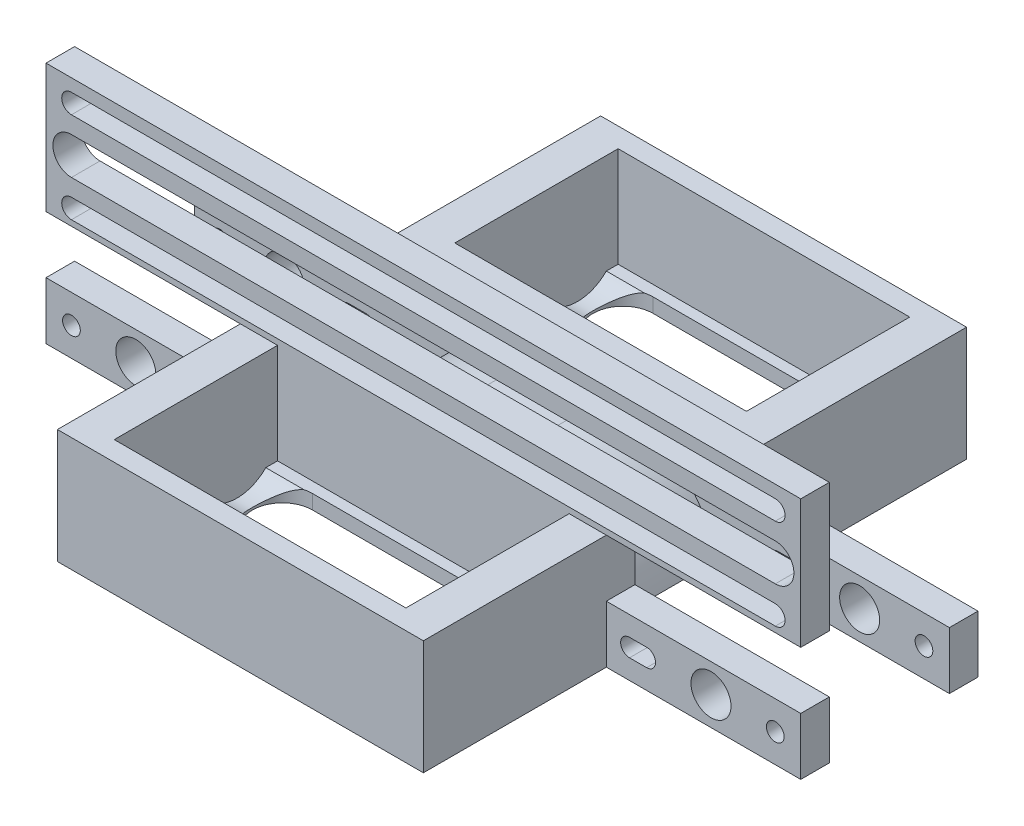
ISO-10303-21;
HEADER;
FILE_DESCRIPTION(('STEP AP214'),'2;1');
FILE_NAME('part.step','',(''),(''),'','','');
FILE_SCHEMA(('AUTOMOTIVE_DESIGN { 1 0 10303 214 1 1 1 1 }'));
ENDSEC;
DATA;
#1=APPLICATION_CONTEXT('core data for automotive mechanical design processes');
#2=APPLICATION_PROTOCOL_DEFINITION('international standard','automotive_design',2000,#1);
#3=PRODUCT_CONTEXT('',#1,'mechanical');
#4=PRODUCT('Part','Part','',(#3));
#5=PRODUCT_RELATED_PRODUCT_CATEGORY('part','',(#4));
#6=PRODUCT_DEFINITION_FORMATION('','',#4);
#7=PRODUCT_DEFINITION_CONTEXT('part definition',#1,'design');
#8=PRODUCT_DEFINITION('design','',#6,#7);
#9=PRODUCT_DEFINITION_SHAPE('','',#8);
#10=(LENGTH_UNIT() NAMED_UNIT(*) SI_UNIT(.MILLI.,.METRE.));
#11=(NAMED_UNIT(*) PLANE_ANGLE_UNIT() SI_UNIT($,.RADIAN.));
#12=(NAMED_UNIT(*) SI_UNIT($,.STERADIAN.) SOLID_ANGLE_UNIT());
#13=UNCERTAINTY_MEASURE_WITH_UNIT(LENGTH_MEASURE(1.E-05),#10,'distance_accuracy_value','');
#14=(GEOMETRIC_REPRESENTATION_CONTEXT(3) GLOBAL_UNCERTAINTY_ASSIGNED_CONTEXT((#13)) GLOBAL_UNIT_ASSIGNED_CONTEXT((#10,
#11,#12)) REPRESENTATION_CONTEXT('',''));
#15=CARTESIAN_POINT('',(0.,0.,0.));
#16=DIRECTION('',(0.,0.,1.));
#17=DIRECTION('',(1.,0.,0.));
#18=AXIS2_PLACEMENT_3D('',#15,#16,#17);
#19=CARTESIAN_POINT('',(0.,20.,-32.));
#20=DIRECTION('',(0.,0.,-1.));
#21=DIRECTION('',(-1.,0.,0.));
#22=AXIS2_PLACEMENT_3D('',#19,#20,#21);
#23=PLANE('',#22);
#24=CARTESIAN_POINT('',(127.55,5.00000000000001,-32.));
#25=DIRECTION('',(0.,0.,1.));
#26=DIRECTION('',(1.,0.,0.));
#27=AXIS2_PLACEMENT_3D('',#24,#25,#26);
#28=CIRCLE('',#27,1.54999999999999);
#29=CARTESIAN_POINT('',(129.1,5.00000000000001,-32.));
#30=VERTEX_POINT('',#29);
#31=EDGE_CURVE('E931',#30,#30,#28,.F.);
#32=ORIENTED_EDGE('',*,*,#31,.T.);
#33=EDGE_LOOP('',(#32));
#34=FACE_BOUND('',#33,.T.);
#35=CARTESIAN_POINT('',(116.3,5.00000000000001,-32.));
#36=DIRECTION('',(0.,0.,1.));
#37=DIRECTION('',(1.,0.,0.));
#38=AXIS2_PLACEMENT_3D('',#35,#36,#37);
#39=CIRCLE('',#38,3.49999999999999);
#40=CARTESIAN_POINT('',(119.8,5.00000000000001,-32.));
#41=VERTEX_POINT('',#40);
#42=EDGE_CURVE('E1020',#41,#41,#39,.F.);
#43=ORIENTED_EDGE('',*,*,#42,.T.);
#44=EDGE_LOOP('',(#43));
#45=FACE_BOUND('',#44,.T.);
#46=CARTESIAN_POINT('',(102.05,5.,-32.));
#47=DIRECTION('',(0.,0.,1.));
#48=DIRECTION('',(1.,0.,0.));
#49=AXIS2_PLACEMENT_3D('',#46,#47,#48);
#50=CIRCLE('',#49,1.54999999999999);
#51=CARTESIAN_POINT('',(102.05,3.45000000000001,-32.));
#52=VERTEX_POINT('',#51);
#53=CARTESIAN_POINT('',(102.05,6.54999999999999,-32.));
#54=VERTEX_POINT('',#53);
#55=EDGE_CURVE('E996',#52,#54,#50,.F.);
#56=ORIENTED_EDGE('',*,*,#55,.T.);
#57=DIRECTION('',(-1.,0.,0.));
#58=VECTOR('',#57,1.);
#59=CARTESIAN_POINT('',(0.,6.54999999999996,-32.));
#60=LINE('',#59,#58);
#61=CARTESIAN_POINT('',(105.05,6.54999999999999,-32.));
#62=VERTEX_POINT('',#61);
#63=EDGE_CURVE('E983',#62,#54,#60,.T.);
#64=ORIENTED_EDGE('',*,*,#63,.F.);
#65=CARTESIAN_POINT('',(105.05,5.00000000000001,-32.));
#66=DIRECTION('',(0.,0.,1.));
#67=DIRECTION('',(1.,0.,0.));
#68=AXIS2_PLACEMENT_3D('',#65,#66,#67);
#69=CIRCLE('',#68,1.54999999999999);
#70=CARTESIAN_POINT('',(105.05,3.45000000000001,-32.));
#71=VERTEX_POINT('',#70);
#72=EDGE_CURVE('E988',#62,#71,#69,.F.);
#73=ORIENTED_EDGE('',*,*,#72,.T.);
#74=DIRECTION('',(-1.,0.,0.));
#75=VECTOR('',#74,1.);
#76=CARTESIAN_POINT('',(0.,3.45000000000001,-32.));
#77=LINE('',#76,#75);
#78=EDGE_CURVE('E987',#71,#52,#77,.T.);
#79=ORIENTED_EDGE('',*,*,#78,.T.);
#80=EDGE_LOOP('',(#56,#64,#73,#79));
#81=FACE_BOUND('',#80,.T.);
#82=DIRECTION('',(-1.,0.,0.));
#83=VECTOR('',#82,1.);
#84=CARTESIAN_POINT('',(0.,9.99999999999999,-32.));
#85=LINE('',#84,#83);
#86=CARTESIAN_POINT('',(132.,10.,-32.));
#87=VERTEX_POINT('',#86);
#88=CARTESIAN_POINT('',(98.,10.,-32.));
#89=VERTEX_POINT('',#88);
#90=EDGE_CURVE('E1341',#87,#89,#85,.T.);
#91=ORIENTED_EDGE('',*,*,#90,.T.);
#92=DIRECTION('',(0.,-1.,0.));
#93=VECTOR('',#92,1.);
#94=CARTESIAN_POINT('',(98.,20.,-32.));
#95=LINE('',#94,#93);
#96=CARTESIAN_POINT('',(98.,0.,-32.));
#97=VERTEX_POINT('',#96);
#98=EDGE_CURVE('E769',#89,#97,#95,.T.);
#99=ORIENTED_EDGE('',*,*,#98,.T.);
#100=DIRECTION('',(1.,0.,0.));
#101=VECTOR('',#100,1.);
#102=CARTESIAN_POINT('',(0.,0.,-32.));
#103=LINE('',#102,#101);
#104=CARTESIAN_POINT('',(132.,0.,-32.));
#105=VERTEX_POINT('',#104);
#106=EDGE_CURVE('E743',#97,#105,#103,.T.);
#107=ORIENTED_EDGE('',*,*,#106,.T.);
#108=DIRECTION('',(0.,-1.,0.));
#109=VECTOR('',#108,1.);
#110=CARTESIAN_POINT('',(132.,20.,-32.));
#111=LINE('',#110,#109);
#112=EDGE_CURVE('E765',#87,#105,#111,.T.);
#113=ORIENTED_EDGE('',*,*,#112,.F.);
#114=EDGE_LOOP('',(#91,#99,#107,#113));
#115=FACE_BOUND('',#114,.T.);
#116=ADVANCED_FACE('F47',(#34,#45,#81,#115),#23,.F.);
#117=CARTESIAN_POINT('',(127.55,30.65,-32.));
#118=DIRECTION('',(0.,0.,1.));
#119=DIRECTION('',(1.,0.,0.));
#120=AXIS2_PLACEMENT_3D('',#117,#118,#119);
#121=CIRCLE('',#120,3.25);
#122=CARTESIAN_POINT('',(127.55,27.4,-32.));
#123=VERTEX_POINT('',#122);
#124=CARTESIAN_POINT('',(127.55,33.9,-32.));
#125=VERTEX_POINT('',#124);
#126=EDGE_CURVE('E1156',#123,#125,#121,.T.);
#127=ORIENTED_EDGE('',*,*,#126,.F.);
#128=DIRECTION('',(1.,0.,0.));
#129=VECTOR('',#128,1.);
#130=CARTESIAN_POINT('',(0.,27.4,-32.));
#131=LINE('',#130,#129);
#132=CARTESIAN_POINT('',(4.45000000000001,27.4,-32.));
#133=VERTEX_POINT('',#132);
#134=EDGE_CURVE('E1159',#133,#123,#131,.T.);
#135=ORIENTED_EDGE('',*,*,#134,.F.);
#136=CARTESIAN_POINT('',(4.45000000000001,30.65,-32.));
#137=DIRECTION('',(0.,0.,1.));
#138=DIRECTION('',(1.,0.,0.));
#139=AXIS2_PLACEMENT_3D('',#136,#137,#138);
#140=CIRCLE('',#139,3.25);
#141=CARTESIAN_POINT('',(4.45000000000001,33.9,-32.));
#142=VERTEX_POINT('',#141);
#143=EDGE_CURVE('E1162',#142,#133,#140,.T.);
#144=ORIENTED_EDGE('',*,*,#143,.F.);
#145=DIRECTION('',(1.,0.,0.));
#146=VECTOR('',#145,1.);
#147=CARTESIAN_POINT('',(0.,33.9,-32.));
#148=LINE('',#147,#146);
#149=EDGE_CURVE('E1165',#142,#125,#148,.T.);
#150=ORIENTED_EDGE('',*,*,#149,.T.);
#151=EDGE_LOOP('',(#127,#135,#144,#150));
#152=FACE_BOUND('',#151,.T.);
#153=CARTESIAN_POINT('',(127.55,38.6,-32.));
#154=DIRECTION('',(0.,0.,1.));
#155=DIRECTION('',(1.,0.,0.));
#156=AXIS2_PLACEMENT_3D('',#153,#154,#155);
#157=CIRCLE('',#156,1.7);
#158=CARTESIAN_POINT('',(127.55,36.9,-32.));
#159=VERTEX_POINT('',#158);
#160=CARTESIAN_POINT('',(127.55,40.3,-32.));
#161=VERTEX_POINT('',#160);
#162=EDGE_CURVE('E1144',#159,#161,#157,.T.);
#163=ORIENTED_EDGE('',*,*,#162,.F.);
#164=DIRECTION('',(1.,0.,0.));
#165=VECTOR('',#164,1.);
#166=CARTESIAN_POINT('',(0.,36.9,-32.));
#167=LINE('',#166,#165);
#168=CARTESIAN_POINT('',(4.45000000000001,36.9,-32.));
#169=VERTEX_POINT('',#168);
#170=EDGE_CURVE('E1147',#169,#159,#167,.T.);
#171=ORIENTED_EDGE('',*,*,#170,.F.);
#172=CARTESIAN_POINT('',(4.45000000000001,38.6,-32.));
#173=DIRECTION('',(0.,0.,1.));
#174=DIRECTION('',(1.,0.,0.));
#175=AXIS2_PLACEMENT_3D('',#172,#173,#174);
#176=CIRCLE('',#175,1.7);
#177=CARTESIAN_POINT('',(4.45000000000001,40.3,-32.));
#178=VERTEX_POINT('',#177);
#179=EDGE_CURVE('E1150',#178,#169,#176,.T.);
#180=ORIENTED_EDGE('',*,*,#179,.F.);
#181=DIRECTION('',(1.,0.,0.));
#182=VECTOR('',#181,1.);
#183=CARTESIAN_POINT('',(0.,40.3,-32.));
#184=LINE('',#183,#182);
#185=EDGE_CURVE('E1153',#178,#161,#184,.T.);
#186=ORIENTED_EDGE('',*,*,#185,.T.);
#187=EDGE_LOOP('',(#163,#171,#180,#186));
#188=FACE_BOUND('',#187,.T.);
#189=CARTESIAN_POINT('',(127.55,22.7,-32.));
#190=DIRECTION('',(0.,0.,1.));
#191=DIRECTION('',(1.,0.,0.));
#192=AXIS2_PLACEMENT_3D('',#189,#190,#191);
#193=CIRCLE('',#192,1.7);
#194=CARTESIAN_POINT('',(127.55,21.,-32.));
#195=VERTEX_POINT('',#194);
#196=CARTESIAN_POINT('',(127.55,24.4,-32.));
#197=VERTEX_POINT('',#196);
#198=EDGE_CURVE('E1132',#195,#197,#193,.T.);
#199=ORIENTED_EDGE('',*,*,#198,.F.);
#200=DIRECTION('',(1.,0.,0.));
#201=VECTOR('',#200,1.);
#202=CARTESIAN_POINT('',(0.,21.,-32.));
#203=LINE('',#202,#201);
#204=CARTESIAN_POINT('',(4.45000000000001,21.,-32.));
#205=VERTEX_POINT('',#204);
#206=EDGE_CURVE('E1135',#205,#195,#203,.T.);
#207=ORIENTED_EDGE('',*,*,#206,.F.);
#208=CARTESIAN_POINT('',(4.45000000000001,22.7,-32.));
#209=DIRECTION('',(0.,0.,1.));
#210=DIRECTION('',(1.,0.,0.));
#211=AXIS2_PLACEMENT_3D('',#208,#209,#210);
#212=CIRCLE('',#211,1.7);
#213=CARTESIAN_POINT('',(4.45000000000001,24.4,-32.));
#214=VERTEX_POINT('',#213);
#215=EDGE_CURVE('E1138',#214,#205,#212,.T.);
#216=ORIENTED_EDGE('',*,*,#215,.F.);
#217=DIRECTION('',(1.,0.,0.));
#218=VECTOR('',#217,1.);
#219=CARTESIAN_POINT('',(0.,24.4,-32.));
#220=LINE('',#219,#218);
#221=EDGE_CURVE('E1141',#214,#197,#220,.T.);
#222=ORIENTED_EDGE('',*,*,#221,.T.);
#223=EDGE_LOOP('',(#199,#207,#216,#222));
#224=FACE_BOUND('',#223,.T.);
#225=DIRECTION('',(1.,0.,0.));
#226=VECTOR('',#225,1.);
#227=CARTESIAN_POINT('',(0.,20.,-32.));
#228=LINE('',#227,#226);
#229=CARTESIAN_POINT('',(98.,20.,-32.));
#230=VERTEX_POINT('',#229);
#231=CARTESIAN_POINT('',(132.,20.,-32.));
#232=VERTEX_POINT('',#231);
#233=EDGE_CURVE('E909',#230,#232,#228,.T.);
#234=ORIENTED_EDGE('',*,*,#233,.T.);
#235=CARTESIAN_POINT('',(132.,42.5,-32.));
#236=VERTEX_POINT('',#235);
#237=EDGE_CURVE('E766',#236,#232,#111,.T.);
#238=ORIENTED_EDGE('',*,*,#237,.F.);
#239=DIRECTION('',(1.,0.,0.));
#240=VECTOR('',#239,1.);
#241=CARTESIAN_POINT('',(0.,42.5,-32.));
#242=LINE('',#241,#240);
#243=CARTESIAN_POINT('',(0.,42.5,-32.));
#244=VERTEX_POINT('',#243);
#245=EDGE_CURVE('E1168',#244,#236,#242,.T.);
#246=ORIENTED_EDGE('',*,*,#245,.F.);
#247=DIRECTION('',(0.,-1.,0.));
#248=VECTOR('',#247,1.);
#249=CARTESIAN_POINT('',(0.,20.,-32.));
#250=LINE('',#249,#248);
#251=CARTESIAN_POINT('',(0.,20.,-32.));
#252=VERTEX_POINT('',#251);
#253=EDGE_CURVE('E780',#244,#252,#250,.T.);
#254=ORIENTED_EDGE('',*,*,#253,.T.);
#255=DIRECTION('',(-1.,0.,0.));
#256=VECTOR('',#255,1.);
#257=CARTESIAN_POINT('',(0.,20.,-32.));
#258=LINE('',#257,#256);
#259=CARTESIAN_POINT('',(34.,20.,-32.));
#260=VERTEX_POINT('',#259);
#261=EDGE_CURVE('E1328',#260,#252,#258,.T.);
#262=ORIENTED_EDGE('',*,*,#261,.F.);
#263=DIRECTION('',(1.,0.,0.));
#264=VECTOR('',#263,1.);
#265=CARTESIAN_POINT('',(0.,20.,-32.));
#266=LINE('',#265,#264);
#267=CARTESIAN_POINT('',(40.5,20.,-32.));
#268=VERTEX_POINT('',#267);
#269=EDGE_CURVE('E810',#260,#268,#266,.T.);
#270=ORIENTED_EDGE('',*,*,#269,.T.);
#271=DIRECTION('',(0.,-1.,0.));
#272=VECTOR('',#271,1.);
#273=CARTESIAN_POINT('',(40.5,20.,-32.));
#274=LINE('',#273,#272);
#275=CARTESIAN_POINT('',(40.5,2.5,-32.));
#276=VERTEX_POINT('',#275);
#277=EDGE_CURVE('E755',#268,#276,#274,.T.);
#278=ORIENTED_EDGE('',*,*,#277,.T.);
#279=DIRECTION('',(1.,0.,0.));
#280=VECTOR('',#279,1.);
#281=CARTESIAN_POINT('',(0.,2.5,-32.));
#282=LINE('',#281,#280);
#283=CARTESIAN_POINT('',(91.5,2.5,-32.));
#284=VERTEX_POINT('',#283);
#285=EDGE_CURVE('E1374',#276,#284,#282,.T.);
#286=ORIENTED_EDGE('',*,*,#285,.T.);
#287=DIRECTION('',(0.,-1.,0.));
#288=VECTOR('',#287,1.);
#289=CARTESIAN_POINT('',(91.5,20.,-32.));
#290=LINE('',#289,#288);
#291=CARTESIAN_POINT('',(91.5,20.,-32.));
#292=VERTEX_POINT('',#291);
#293=EDGE_CURVE('E751',#292,#284,#290,.T.);
#294=ORIENTED_EDGE('',*,*,#293,.F.);
#295=EDGE_CURVE('E806',#292,#230,#266,.T.);
#296=ORIENTED_EDGE('',*,*,#295,.T.);
#297=EDGE_LOOP('',(#234,#238,#246,#254,#262,#270,#278,#286,#294,#296));
#298=FACE_BOUND('',#297,.T.);
#299=ADVANCED_FACE('F1290',(#152,#188,#224,#298),#23,.F.);
#300=CARTESIAN_POINT('',(4.45,5.,-32.));
#301=DIRECTION('',(0.,0.,1.));
#302=DIRECTION('',(1.,0.,0.));
#303=AXIS2_PLACEMENT_3D('',#300,#301,#302);
#304=CIRCLE('',#303,1.55);
#305=CARTESIAN_POINT('',(6.,5.,-32.));
#306=VERTEX_POINT('',#305);
#307=EDGE_CURVE('E932',#306,#306,#304,.T.);
#308=ORIENTED_EDGE('',*,*,#307,.F.);
#309=EDGE_LOOP('',(#308));
#310=FACE_BOUND('',#309,.T.);
#311=DIRECTION('',(1.,0.,0.));
#312=VECTOR('',#311,1.);
#313=CARTESIAN_POINT('',(0.,6.54999999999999,-32.));
#314=LINE('',#313,#312);
#315=CARTESIAN_POINT('',(26.95,6.54999999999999,-32.));
#316=VERTEX_POINT('',#315);
#317=CARTESIAN_POINT('',(29.95,6.54999999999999,-32.));
#318=VERTEX_POINT('',#317);
#319=EDGE_CURVE('E950',#316,#318,#314,.T.);
#320=ORIENTED_EDGE('',*,*,#319,.T.);
#321=CARTESIAN_POINT('',(29.95,5.,-32.));
#322=DIRECTION('',(0.,0.,1.));
#323=DIRECTION('',(1.,0.,0.));
#324=AXIS2_PLACEMENT_3D('',#321,#322,#323);
#325=CIRCLE('',#324,1.54999999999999);
#326=CARTESIAN_POINT('',(29.95,3.45000000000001,-32.));
#327=VERTEX_POINT('',#326);
#328=EDGE_CURVE('E949',#327,#318,#325,.T.);
#329=ORIENTED_EDGE('',*,*,#328,.F.);
#330=DIRECTION('',(1.,0.,0.));
#331=VECTOR('',#330,1.);
#332=CARTESIAN_POINT('',(0.,3.45,-32.));
#333=LINE('',#332,#331);
#334=CARTESIAN_POINT('',(26.95,3.45000000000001,-32.));
#335=VERTEX_POINT('',#334);
#336=EDGE_CURVE('E957',#335,#327,#333,.T.);
#337=ORIENTED_EDGE('',*,*,#336,.F.);
#338=CARTESIAN_POINT('',(26.95,5.,-32.));
#339=DIRECTION('',(0.,0.,1.));
#340=DIRECTION('',(1.,0.,0.));
#341=AXIS2_PLACEMENT_3D('',#338,#339,#340);
#342=CIRCLE('',#341,1.54999999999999);
#343=EDGE_CURVE('E946',#316,#335,#342,.T.);
#344=ORIENTED_EDGE('',*,*,#343,.F.);
#345=EDGE_LOOP('',(#320,#329,#337,#344));
#346=FACE_BOUND('',#345,.T.);
#347=CARTESIAN_POINT('',(15.7,5.,-32.));
#348=DIRECTION('',(0.,0.,1.));
#349=DIRECTION('',(1.,0.,0.));
#350=AXIS2_PLACEMENT_3D('',#347,#348,#349);
#351=CIRCLE('',#350,3.5);
#352=CARTESIAN_POINT('',(19.2,5.,-32.));
#353=VERTEX_POINT('',#352);
#354=EDGE_CURVE('E940',#353,#353,#351,.T.);
#355=ORIENTED_EDGE('',*,*,#354,.F.);
#356=EDGE_LOOP('',(#355));
#357=FACE_BOUND('',#356,.T.);
#358=DIRECTION('',(0.,-1.,0.));
#359=VECTOR('',#358,1.);
#360=CARTESIAN_POINT('',(34.,20.,-32.));
#361=LINE('',#360,#359);
#362=CARTESIAN_POINT('',(34.,10.,-32.));
#363=VERTEX_POINT('',#362);
#364=CARTESIAN_POINT('',(34.,0.,-32.));
#365=VERTEX_POINT('',#364);
#366=EDGE_CURVE('E777',#363,#365,#361,.T.);
#367=ORIENTED_EDGE('',*,*,#366,.F.);
#368=DIRECTION('',(1.,0.,0.));
#369=VECTOR('',#368,1.);
#370=CARTESIAN_POINT('',(0.,10.,-32.));
#371=LINE('',#370,#369);
#372=CARTESIAN_POINT('',(0.,10.,-32.));
#373=VERTEX_POINT('',#372);
#374=EDGE_CURVE('E62',#373,#363,#371,.T.);
#375=ORIENTED_EDGE('',*,*,#374,.F.);
#376=CARTESIAN_POINT('',(0.,0.,-32.));
#377=VERTEX_POINT('',#376);
#378=EDGE_CURVE('E779',#373,#377,#250,.T.);
#379=ORIENTED_EDGE('',*,*,#378,.T.);
#380=DIRECTION('',(1.,0.,0.));
#381=VECTOR('',#380,1.);
#382=CARTESIAN_POINT('',(0.,0.,-32.));
#383=LINE('',#382,#381);
#384=EDGE_CURVE('E733',#377,#365,#383,.T.);
#385=ORIENTED_EDGE('',*,*,#384,.T.);
#386=EDGE_LOOP('',(#367,#375,#379,#385));
#387=FACE_BOUND('',#386,.T.);
#388=ADVANCED_FACE('F1293',(#310,#346,#357,#387),#23,.F.);
#389=CARTESIAN_POINT('',(0.,20.,-37.));
#390=DIRECTION('',(0.,0.,-1.));
#391=DIRECTION('',(-1.,0.,0.));
#392=AXIS2_PLACEMENT_3D('',#389,#390,#391);
#393=PLANE('',#392);
#394=DIRECTION('',(1.,0.,0.));
#395=VECTOR('',#394,1.);
#396=CARTESIAN_POINT('',(0.,27.4,-37.));
#397=LINE('',#396,#395);
#398=CARTESIAN_POINT('',(4.45000000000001,27.4,-37.));
#399=VERTEX_POINT('',#398);
#400=CARTESIAN_POINT('',(127.55,27.4,-37.));
#401=VERTEX_POINT('',#400);
#402=EDGE_CURVE('E1121',#399,#401,#397,.T.);
#403=ORIENTED_EDGE('',*,*,#402,.T.);
#404=CARTESIAN_POINT('',(127.55,30.65,-37.));
#405=DIRECTION('',(0.,0.,-1.));
#406=DIRECTION('',(-1.,0.,0.));
#407=AXIS2_PLACEMENT_3D('',#404,#405,#406);
#408=CIRCLE('',#407,3.25);
#409=CARTESIAN_POINT('',(127.55,33.9,-37.));
#410=VERTEX_POINT('',#409);
#411=EDGE_CURVE('E1129',#401,#410,#408,.F.);
#412=ORIENTED_EDGE('',*,*,#411,.T.);
#413=DIRECTION('',(1.,0.,0.));
#414=VECTOR('',#413,1.);
#415=CARTESIAN_POINT('',(0.,33.9,-37.));
#416=LINE('',#415,#414);
#417=CARTESIAN_POINT('',(4.45000000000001,33.9,-37.));
#418=VERTEX_POINT('',#417);
#419=EDGE_CURVE('E1127',#418,#410,#416,.T.);
#420=ORIENTED_EDGE('',*,*,#419,.F.);
#421=CARTESIAN_POINT('',(4.45000000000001,30.65,-37.));
#422=DIRECTION('',(0.,0.,-1.));
#423=DIRECTION('',(-1.,0.,0.));
#424=AXIS2_PLACEMENT_3D('',#421,#422,#423);
#425=CIRCLE('',#424,3.25);
#426=EDGE_CURVE('E1124',#418,#399,#425,.F.);
#427=ORIENTED_EDGE('',*,*,#426,.T.);
#428=EDGE_LOOP('',(#403,#412,#420,#427));
#429=FACE_BOUND('',#428,.T.);
#430=DIRECTION('',(1.,0.,0.));
#431=VECTOR('',#430,1.);
#432=CARTESIAN_POINT('',(0.,36.9,-37.));
#433=LINE('',#432,#431);
#434=CARTESIAN_POINT('',(4.45000000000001,36.9,-37.));
#435=VERTEX_POINT('',#434);
#436=CARTESIAN_POINT('',(127.55,36.9,-37.));
#437=VERTEX_POINT('',#436);
#438=EDGE_CURVE('E1110',#435,#437,#433,.T.);
#439=ORIENTED_EDGE('',*,*,#438,.T.);
#440=CARTESIAN_POINT('',(127.55,38.6,-37.));
#441=DIRECTION('',(0.,0.,-1.));
#442=DIRECTION('',(-1.,0.,0.));
#443=AXIS2_PLACEMENT_3D('',#440,#441,#442);
#444=CIRCLE('',#443,1.7);
#445=CARTESIAN_POINT('',(127.55,40.3,-37.));
#446=VERTEX_POINT('',#445);
#447=EDGE_CURVE('E1118',#437,#446,#444,.F.);
#448=ORIENTED_EDGE('',*,*,#447,.T.);
#449=DIRECTION('',(1.,0.,0.));
#450=VECTOR('',#449,1.);
#451=CARTESIAN_POINT('',(0.,40.3,-37.));
#452=LINE('',#451,#450);
#453=CARTESIAN_POINT('',(4.45000000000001,40.3,-37.));
#454=VERTEX_POINT('',#453);
#455=EDGE_CURVE('E1116',#454,#446,#452,.T.);
#456=ORIENTED_EDGE('',*,*,#455,.F.);
#457=CARTESIAN_POINT('',(4.45000000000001,38.6,-37.));
#458=DIRECTION('',(0.,0.,-1.));
#459=DIRECTION('',(-1.,0.,0.));
#460=AXIS2_PLACEMENT_3D('',#457,#458,#459);
#461=CIRCLE('',#460,1.7);
#462=EDGE_CURVE('E1113',#454,#435,#461,.F.);
#463=ORIENTED_EDGE('',*,*,#462,.T.);
#464=EDGE_LOOP('',(#439,#448,#456,#463));
#465=FACE_BOUND('',#464,.T.);
#466=DIRECTION('',(1.,0.,0.));
#467=VECTOR('',#466,1.);
#468=CARTESIAN_POINT('',(0.,21.,-37.));
#469=LINE('',#468,#467);
#470=CARTESIAN_POINT('',(4.45000000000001,21.,-37.));
#471=VERTEX_POINT('',#470);
#472=CARTESIAN_POINT('',(127.55,21.,-37.));
#473=VERTEX_POINT('',#472);
#474=EDGE_CURVE('E1099',#471,#473,#469,.T.);
#475=ORIENTED_EDGE('',*,*,#474,.T.);
#476=CARTESIAN_POINT('',(127.55,22.7,-37.));
#477=DIRECTION('',(0.,0.,-1.));
#478=DIRECTION('',(-1.,0.,0.));
#479=AXIS2_PLACEMENT_3D('',#476,#477,#478);
#480=CIRCLE('',#479,1.7);
#481=CARTESIAN_POINT('',(127.55,24.4,-37.));
#482=VERTEX_POINT('',#481);
#483=EDGE_CURVE('E1107',#473,#482,#480,.F.);
#484=ORIENTED_EDGE('',*,*,#483,.T.);
#485=DIRECTION('',(1.,0.,0.));
#486=VECTOR('',#485,1.);
#487=CARTESIAN_POINT('',(0.,24.4,-37.));
#488=LINE('',#487,#486);
#489=CARTESIAN_POINT('',(4.45000000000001,24.4,-37.));
#490=VERTEX_POINT('',#489);
#491=EDGE_CURVE('E1105',#490,#482,#488,.T.);
#492=ORIENTED_EDGE('',*,*,#491,.F.);
#493=CARTESIAN_POINT('',(4.45000000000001,22.7,-37.));
#494=DIRECTION('',(0.,0.,-1.));
#495=DIRECTION('',(-1.,0.,0.));
#496=AXIS2_PLACEMENT_3D('',#493,#494,#495);
#497=CIRCLE('',#496,1.7);
#498=EDGE_CURVE('E1102',#490,#471,#497,.F.);
#499=ORIENTED_EDGE('',*,*,#498,.T.);
#500=EDGE_LOOP('',(#475,#484,#492,#499));
#501=FACE_BOUND('',#500,.T.);
#502=CARTESIAN_POINT('',(127.55,5.00000000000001,-37.));
#503=DIRECTION('',(0.,0.,-1.));
#504=DIRECTION('',(-1.,0.,0.));
#505=AXIS2_PLACEMENT_3D('',#502,#503,#504);
#506=CIRCLE('',#505,1.54999999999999);
#507=CARTESIAN_POINT('',(126.,5.00000000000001,-37.));
#508=VERTEX_POINT('',#507);
#509=EDGE_CURVE('E1066',#508,#508,#506,.F.);
#510=ORIENTED_EDGE('',*,*,#509,.T.);
#511=EDGE_LOOP('',(#510));
#512=FACE_BOUND('',#511,.T.);
#513=CARTESIAN_POINT('',(116.3,5.00000000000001,-37.));
#514=DIRECTION('',(0.,0.,-1.));
#515=DIRECTION('',(-1.,0.,0.));
#516=AXIS2_PLACEMENT_3D('',#513,#514,#515);
#517=CIRCLE('',#516,3.49999999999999);
#518=CARTESIAN_POINT('',(112.8,5.00000000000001,-37.));
#519=VERTEX_POINT('',#518);
#520=EDGE_CURVE('E1072',#519,#519,#517,.F.);
#521=ORIENTED_EDGE('',*,*,#520,.T.);
#522=EDGE_LOOP('',(#521));
#523=FACE_BOUND('',#522,.T.);
#524=DIRECTION('',(1.,0.,0.));
#525=VECTOR('',#524,1.);
#526=CARTESIAN_POINT('',(0.,6.54999999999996,-37.));
#527=LINE('',#526,#525);
#528=CARTESIAN_POINT('',(102.05,6.54999999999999,-37.));
#529=VERTEX_POINT('',#528);
#530=CARTESIAN_POINT('',(105.05,6.54999999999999,-37.));
#531=VERTEX_POINT('',#530);
#532=EDGE_CURVE('E1088',#529,#531,#527,.T.);
#533=ORIENTED_EDGE('',*,*,#532,.F.);
#534=CARTESIAN_POINT('',(102.05,5.,-37.));
#535=DIRECTION('',(0.,0.,-1.));
#536=DIRECTION('',(-1.,0.,0.));
#537=AXIS2_PLACEMENT_3D('',#534,#535,#536);
#538=CIRCLE('',#537,1.54999999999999);
#539=CARTESIAN_POINT('',(102.05,3.45000000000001,-37.));
#540=VERTEX_POINT('',#539);
#541=EDGE_CURVE('E1093',#529,#540,#538,.F.);
#542=ORIENTED_EDGE('',*,*,#541,.T.);
#543=DIRECTION('',(1.,0.,0.));
#544=VECTOR('',#543,1.);
#545=CARTESIAN_POINT('',(0.,3.45000000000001,-37.));
#546=LINE('',#545,#544);
#547=CARTESIAN_POINT('',(105.05,3.45000000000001,-37.));
#548=VERTEX_POINT('',#547);
#549=EDGE_CURVE('E1077',#540,#548,#546,.T.);
#550=ORIENTED_EDGE('',*,*,#549,.T.);
#551=CARTESIAN_POINT('',(105.05,5.00000000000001,-37.));
#552=DIRECTION('',(0.,0.,-1.));
#553=DIRECTION('',(-1.,0.,0.));
#554=AXIS2_PLACEMENT_3D('',#551,#552,#553);
#555=CIRCLE('',#554,1.54999999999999);
#556=EDGE_CURVE('E1082',#548,#531,#555,.F.);
#557=ORIENTED_EDGE('',*,*,#556,.T.);
#558=EDGE_LOOP('',(#533,#542,#550,#557));
#559=FACE_BOUND('',#558,.T.);
#560=CARTESIAN_POINT('',(29.95,5.,-37.));
#561=DIRECTION('',(0.,0.,-1.));
#562=DIRECTION('',(-1.,0.,0.));
#563=AXIS2_PLACEMENT_3D('',#560,#561,#562);
#564=CIRCLE('',#563,1.54999999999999);
#565=CARTESIAN_POINT('',(29.95,6.54999999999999,-37.));
#566=VERTEX_POINT('',#565);
#567=CARTESIAN_POINT('',(29.95,3.45000000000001,-37.));
#568=VERTEX_POINT('',#567);
#569=EDGE_CURVE('E1048',#566,#568,#564,.T.);
#570=ORIENTED_EDGE('',*,*,#569,.F.);
#571=DIRECTION('',(-1.,0.,0.));
#572=VECTOR('',#571,1.);
#573=CARTESIAN_POINT('',(0.,6.54999999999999,-37.));
#574=LINE('',#573,#572);
#575=CARTESIAN_POINT('',(26.95,6.54999999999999,-37.));
#576=VERTEX_POINT('',#575);
#577=EDGE_CURVE('E1042',#566,#576,#574,.T.);
#578=ORIENTED_EDGE('',*,*,#577,.T.);
#579=CARTESIAN_POINT('',(26.95,5.,-37.));
#580=DIRECTION('',(0.,0.,-1.));
#581=DIRECTION('',(-1.,0.,0.));
#582=AXIS2_PLACEMENT_3D('',#579,#580,#581);
#583=CIRCLE('',#582,1.54999999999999);
#584=CARTESIAN_POINT('',(26.95,3.45,-37.));
#585=VERTEX_POINT('',#584);
#586=EDGE_CURVE('E1038',#585,#576,#583,.T.);
#587=ORIENTED_EDGE('',*,*,#586,.F.);
#588=DIRECTION('',(-1.,0.,0.));
#589=VECTOR('',#588,1.);
#590=CARTESIAN_POINT('',(0.,3.45,-37.));
#591=LINE('',#590,#589);
#592=EDGE_CURVE('E1033',#568,#585,#591,.T.);
#593=ORIENTED_EDGE('',*,*,#592,.F.);
#594=EDGE_LOOP('',(#570,#578,#587,#593));
#595=FACE_BOUND('',#594,.T.);
#596=CARTESIAN_POINT('',(15.7,5.,-37.));
#597=DIRECTION('',(0.,0.,-1.));
#598=DIRECTION('',(-1.,0.,0.));
#599=AXIS2_PLACEMENT_3D('',#596,#597,#598);
#600=CIRCLE('',#599,3.5);
#601=CARTESIAN_POINT('',(12.2,5.,-37.));
#602=VERTEX_POINT('',#601);
#603=EDGE_CURVE('E1054',#602,#602,#600,.T.);
#604=ORIENTED_EDGE('',*,*,#603,.F.);
#605=EDGE_LOOP('',(#604));
#606=FACE_BOUND('',#605,.T.);
#607=CARTESIAN_POINT('',(4.45,5.,-37.));
#608=DIRECTION('',(0.,0.,-1.));
#609=DIRECTION('',(-1.,0.,0.));
#610=AXIS2_PLACEMENT_3D('',#607,#608,#609);
#611=CIRCLE('',#610,1.55);
#612=CARTESIAN_POINT('',(2.9,5.,-37.));
#613=VERTEX_POINT('',#612);
#614=EDGE_CURVE('E1060',#613,#613,#611,.T.);
#615=ORIENTED_EDGE('',*,*,#614,.F.);
#616=EDGE_LOOP('',(#615));
#617=FACE_BOUND('',#616,.T.);
#618=DIRECTION('',(0.,1.,0.));
#619=VECTOR('',#618,1.);
#620=CARTESIAN_POINT('',(98.,20.,-37.));
#621=LINE('',#620,#619);
#622=CARTESIAN_POINT('',(98.,10.,-37.));
#623=VERTEX_POINT('',#622);
#624=CARTESIAN_POINT('',(98.,20.,-37.));
#625=VERTEX_POINT('',#624);
#626=EDGE_CURVE('E918',#623,#625,#621,.T.);
#627=ORIENTED_EDGE('',*,*,#626,.F.);
#628=DIRECTION('',(1.,0.,0.));
#629=VECTOR('',#628,1.);
#630=CARTESIAN_POINT('',(0.,9.99999999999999,-37.));
#631=LINE('',#630,#629);
#632=CARTESIAN_POINT('',(132.,10.,-37.));
#633=VERTEX_POINT('',#632);
#634=EDGE_CURVE('E928',#623,#633,#631,.T.);
#635=ORIENTED_EDGE('',*,*,#634,.T.);
#636=DIRECTION('',(0.,-1.,0.));
#637=VECTOR('',#636,1.);
#638=CARTESIAN_POINT('',(132.,20.,-37.));
#639=LINE('',#638,#637);
#640=CARTESIAN_POINT('',(132.,0.,-37.));
#641=VERTEX_POINT('',#640);
#642=EDGE_CURVE('E726',#633,#641,#639,.T.);
#643=ORIENTED_EDGE('',*,*,#642,.T.);
#644=DIRECTION('',(1.,0.,0.));
#645=VECTOR('',#644,1.);
#646=CARTESIAN_POINT('',(0.,0.,-37.));
#647=LINE('',#646,#645);
#648=CARTESIAN_POINT('',(91.5,0.,-37.));
#649=VERTEX_POINT('',#648);
#650=EDGE_CURVE('E705',#649,#641,#647,.T.);
#651=ORIENTED_EDGE('',*,*,#650,.F.);
#652=CARTESIAN_POINT('',(72.1350832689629,-5.,-37.));
#653=DIRECTION('',(0.,0.,-1.));
#654=DIRECTION('',(-1.,0.,0.));
#655=AXIS2_PLACEMENT_3D('',#652,#653,#654);
#656=CIRCLE('',#655,20.);
#657=CARTESIAN_POINT('',(72.1350832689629,15.,-37.));
#658=VERTEX_POINT('',#657);
#659=EDGE_CURVE('E55',#649,#658,#656,.F.);
#660=ORIENTED_EDGE('',*,*,#659,.T.);
#661=DIRECTION('',(1.,0.,0.));
#662=VECTOR('',#661,1.);
#663=CARTESIAN_POINT('',(0.,15.,-37.));
#664=LINE('',#663,#662);
#665=CARTESIAN_POINT('',(59.8649167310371,15.,-37.));
#666=VERTEX_POINT('',#665);
#667=EDGE_CURVE('E701',#666,#658,#664,.T.);
#668=ORIENTED_EDGE('',*,*,#667,.F.);
#669=CARTESIAN_POINT('',(59.8649167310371,-5.,-37.));
#670=DIRECTION('',(0.,0.,-1.));
#671=DIRECTION('',(-1.,0.,0.));
#672=AXIS2_PLACEMENT_3D('',#669,#670,#671);
#673=CIRCLE('',#672,20.);
#674=CARTESIAN_POINT('',(40.5,0.,-37.));
#675=VERTEX_POINT('',#674);
#676=EDGE_CURVE('E813',#666,#675,#673,.F.);
#677=ORIENTED_EDGE('',*,*,#676,.T.);
#678=CARTESIAN_POINT('',(0.,0.,-37.));
#679=VERTEX_POINT('',#678);
#680=EDGE_CURVE('E727',#679,#675,#647,.T.);
#681=ORIENTED_EDGE('',*,*,#680,.F.);
#682=DIRECTION('',(0.,-1.,0.));
#683=VECTOR('',#682,1.);
#684=CARTESIAN_POINT('',(0.,20.,-37.));
#685=LINE('',#684,#683);
#686=CARTESIAN_POINT('',(0.,10.,-37.));
#687=VERTEX_POINT('',#686);
#688=EDGE_CURVE('E783',#687,#679,#685,.T.);
#689=ORIENTED_EDGE('',*,*,#688,.F.);
#690=DIRECTION('',(-1.,0.,0.));
#691=VECTOR('',#690,1.);
#692=CARTESIAN_POINT('',(0.,10.,-37.));
#693=LINE('',#692,#691);
#694=CARTESIAN_POINT('',(34.,10.,-37.));
#695=VERTEX_POINT('',#694);
#696=EDGE_CURVE('E923',#695,#687,#693,.T.);
#697=ORIENTED_EDGE('',*,*,#696,.F.);
#698=DIRECTION('',(0.,-1.,0.));
#699=VECTOR('',#698,1.);
#700=CARTESIAN_POINT('',(34.,20.,-37.));
#701=LINE('',#700,#699);
#702=CARTESIAN_POINT('',(34.,20.,-37.));
#703=VERTEX_POINT('',#702);
#704=EDGE_CURVE('E908',#703,#695,#701,.T.);
#705=ORIENTED_EDGE('',*,*,#704,.F.);
#706=DIRECTION('',(1.,0.,0.));
#707=VECTOR('',#706,1.);
#708=CARTESIAN_POINT('',(0.,20.,-37.));
#709=LINE('',#708,#707);
#710=CARTESIAN_POINT('',(0.,20.,-37.));
#711=VERTEX_POINT('',#710);
#712=EDGE_CURVE('E920',#711,#703,#709,.T.);
#713=ORIENTED_EDGE('',*,*,#712,.F.);
#714=CARTESIAN_POINT('',(0.,42.5,-37.));
#715=VERTEX_POINT('',#714);
#716=EDGE_CURVE('E752',#715,#711,#685,.T.);
#717=ORIENTED_EDGE('',*,*,#716,.F.);
#718=DIRECTION('',(1.,0.,0.));
#719=VECTOR('',#718,1.);
#720=CARTESIAN_POINT('',(0.,42.5,-37.));
#721=LINE('',#720,#719);
#722=CARTESIAN_POINT('',(132.,42.5,-37.));
#723=VERTEX_POINT('',#722);
#724=EDGE_CURVE('E1096',#715,#723,#721,.T.);
#725=ORIENTED_EDGE('',*,*,#724,.T.);
#726=CARTESIAN_POINT('',(132.,20.,-37.));
#727=VERTEX_POINT('',#726);
#728=EDGE_CURVE('E762',#723,#727,#639,.T.);
#729=ORIENTED_EDGE('',*,*,#728,.T.);
#730=DIRECTION('',(-1.,0.,0.));
#731=VECTOR('',#730,1.);
#732=CARTESIAN_POINT('',(0.,20.,-37.));
#733=LINE('',#732,#731);
#734=EDGE_CURVE('E70',#727,#625,#733,.T.);
#735=ORIENTED_EDGE('',*,*,#734,.T.);
#736=EDGE_LOOP('',(#627,#635,#643,#651,#660,#668,#677,#681,#689,#697,#705,#713,#717,#725,#729,#735));
#737=FACE_BOUND('',#736,.T.);
#738=ADVANCED_FACE('F820',(#429,#465,#501,#512,#523,#559,#595,#606,#617,#737),#393,.T.);
#739=CARTESIAN_POINT('',(0.,20.,0.));
#740=DIRECTION('',(-1.,0.,0.));
#741=DIRECTION('',(0.,0.,1.));
#742=AXIS2_PLACEMENT_3D('',#739,#740,#741);
#743=PLANE('',#742);
#744=DIRECTION('',(0.,0.,1.));
#745=VECTOR('',#744,1.);
#746=CARTESIAN_POINT('',(0.,10.,-98.4400902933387));
#747=LINE('',#746,#745);
#748=EDGE_CURVE('E1334',#687,#373,#747,.T.);
#749=ORIENTED_EDGE('',*,*,#748,.F.);
#750=ORIENTED_EDGE('',*,*,#688,.T.);
#751=DIRECTION('',(0.,0.,-1.));
#752=VECTOR('',#751,1.);
#753=CARTESIAN_POINT('',(0.,0.,0.));
#754=LINE('',#753,#752);
#755=EDGE_CURVE('E730',#377,#679,#754,.T.);
#756=ORIENTED_EDGE('',*,*,#755,.F.);
#757=ORIENTED_EDGE('',*,*,#378,.F.);
#758=EDGE_LOOP('',(#749,#750,#756,#757));
#759=FACE_BOUND('',#758,.T.);
#760=ADVANCED_FACE('F1307',(#759),#743,.T.);
#761=CARTESIAN_POINT('',(132.,20.,0.));
#762=DIRECTION('',(-1.,0.,0.));
#763=DIRECTION('',(0.,0.,1.));
#764=AXIS2_PLACEMENT_3D('',#761,#762,#763);
#765=PLANE('',#764);
#766=DIRECTION('',(0.,0.,1.));
#767=VECTOR('',#766,1.);
#768=CARTESIAN_POINT('',(132.,10.,-98.4400902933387));
#769=LINE('',#768,#767);
#770=EDGE_CURVE('E667',#633,#87,#769,.T.);
#771=ORIENTED_EDGE('',*,*,#770,.T.);
#772=ORIENTED_EDGE('',*,*,#112,.T.);
#773=DIRECTION('',(0.,0.,-1.));
#774=VECTOR('',#773,1.);
#775=CARTESIAN_POINT('',(132.,0.,0.));
#776=LINE('',#775,#774);
#777=EDGE_CURVE('E713',#105,#641,#776,.T.);
#778=ORIENTED_EDGE('',*,*,#777,.T.);
#779=ORIENTED_EDGE('',*,*,#642,.F.);
#780=EDGE_LOOP('',(#771,#772,#778,#779));
#781=FACE_BOUND('',#780,.T.);
#782=ADVANCED_FACE('F1360',(#781),#765,.F.);
#783=DIRECTION('',(0.,0.,1.));
#784=VECTOR('',#783,1.);
#785=CARTESIAN_POINT('',(132.,20.,-98.4400902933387));
#786=LINE('',#785,#784);
#787=EDGE_CURVE('E1338',#727,#232,#786,.T.);
#788=ORIENTED_EDGE('',*,*,#787,.F.);
#789=ORIENTED_EDGE('',*,*,#728,.F.);
#790=DIRECTION('',(0.,0.,1.));
#791=VECTOR('',#790,1.);
#792=CARTESIAN_POINT('',(132.,42.5,-170.903883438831));
#793=LINE('',#792,#791);
#794=EDGE_CURVE('E1178',#723,#236,#793,.T.);
#795=ORIENTED_EDGE('',*,*,#794,.T.);
#796=ORIENTED_EDGE('',*,*,#237,.T.);
#797=EDGE_LOOP('',(#788,#789,#795,#796));
#798=FACE_BOUND('',#797,.T.);
#799=ADVANCED_FACE('F1417',(#798),#765,.F.);
#800=CARTESIAN_POINT('',(132.,20.,0.));
#801=DIRECTION('',(-1.,0.,0.));
#802=DIRECTION('',(0.,0.,1.));
#803=AXIS2_PLACEMENT_3D('',#800,#801,#802);
#804=PLANE('',#803);
#805=CARTESIAN_POINT('',(132.,10.,-63.));
#806=VERTEX_POINT('',#805);
#807=CARTESIAN_POINT('',(132.,10.,-58.));
#808=VERTEX_POINT('',#807);
#809=EDGE_CURVE('E653',#806,#808,#769,.T.);
#810=ORIENTED_EDGE('',*,*,#809,.T.);
#811=DIRECTION('',(0.,-1.,0.));
#812=VECTOR('',#811,1.);
#813=CARTESIAN_POINT('',(132.,20.,-58.));
#814=LINE('',#813,#812);
#815=CARTESIAN_POINT('',(132.,0.,-58.));
#816=VERTEX_POINT('',#815);
#817=EDGE_CURVE('E676',#808,#816,#814,.T.);
#818=ORIENTED_EDGE('',*,*,#817,.T.);
#819=DIRECTION('',(0.,0.,-1.));
#820=VECTOR('',#819,1.);
#821=CARTESIAN_POINT('',(132.,0.,0.));
#822=LINE('',#821,#820);
#823=CARTESIAN_POINT('',(132.,0.,-63.));
#824=VERTEX_POINT('',#823);
#825=EDGE_CURVE('E842',#816,#824,#822,.T.);
#826=ORIENTED_EDGE('',*,*,#825,.T.);
#827=DIRECTION('',(0.,-1.,0.));
#828=VECTOR('',#827,1.);
#829=CARTESIAN_POINT('',(132.,20.,-63.));
#830=LINE('',#829,#828);
#831=EDGE_CURVE('E673',#806,#824,#830,.T.);
#832=ORIENTED_EDGE('',*,*,#831,.F.);
#833=EDGE_LOOP('',(#810,#818,#826,#832));
#834=FACE_BOUND('',#833,.T.);
#835=ADVANCED_FACE('F1419',(#834),#804,.F.);
#836=CARTESIAN_POINT('',(0.,20.,-63.));
#837=DIRECTION('',(0.,0.,-1.));
#838=DIRECTION('',(-1.,0.,0.));
#839=AXIS2_PLACEMENT_3D('',#836,#837,#838);
#840=PLANE('',#839);
#841=DIRECTION('',(-1.,0.,0.));
#842=VECTOR('',#841,1.);
#843=CARTESIAN_POINT('',(0.,6.54999999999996,-63.));
#844=LINE('',#843,#842);
#845=CARTESIAN_POINT('',(105.05,6.54999999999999,-63.));
#846=VERTEX_POINT('',#845);
#847=CARTESIAN_POINT('',(102.05,6.54999999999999,-63.));
#848=VERTEX_POINT('',#847);
#849=EDGE_CURVE('E999',#846,#848,#844,.T.);
#850=ORIENTED_EDGE('',*,*,#849,.T.);
#851=CARTESIAN_POINT('',(102.05,5.,-63.));
#852=DIRECTION('',(0.,0.,-1.));
#853=DIRECTION('',(-1.,0.,0.));
#854=AXIS2_PLACEMENT_3D('',#851,#852,#853);
#855=CIRCLE('',#854,1.54999999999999);
#856=CARTESIAN_POINT('',(102.05,3.45000000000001,-63.));
#857=VERTEX_POINT('',#856);
#858=EDGE_CURVE('E1002',#857,#848,#855,.T.);
#859=ORIENTED_EDGE('',*,*,#858,.F.);
#860=DIRECTION('',(-1.,0.,0.));
#861=VECTOR('',#860,1.);
#862=CARTESIAN_POINT('',(0.,3.45000000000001,-63.));
#863=LINE('',#862,#861);
#864=CARTESIAN_POINT('',(105.05,3.45000000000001,-63.));
#865=VERTEX_POINT('',#864);
#866=EDGE_CURVE('E986',#865,#857,#863,.T.);
#867=ORIENTED_EDGE('',*,*,#866,.F.);
#868=CARTESIAN_POINT('',(105.05,5.00000000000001,-63.));
#869=DIRECTION('',(0.,0.,-1.));
#870=DIRECTION('',(-1.,0.,0.));
#871=AXIS2_PLACEMENT_3D('',#868,#869,#870);
#872=CIRCLE('',#871,1.54999999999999);
#873=EDGE_CURVE('E973',#846,#865,#872,.T.);
#874=ORIENTED_EDGE('',*,*,#873,.F.);
#875=EDGE_LOOP('',(#850,#859,#867,#874));
#876=FACE_BOUND('',#875,.T.);
#877=CARTESIAN_POINT('',(116.3,5.00000000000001,-63.));
#878=DIRECTION('',(0.,0.,-1.));
#879=DIRECTION('',(-1.,0.,0.));
#880=AXIS2_PLACEMENT_3D('',#877,#878,#879);
#881=CIRCLE('',#880,3.49999999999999);
#882=CARTESIAN_POINT('',(112.8,5.00000000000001,-63.));
#883=VERTEX_POINT('',#882);
#884=EDGE_CURVE('E1023',#883,#883,#881,.T.);
#885=ORIENTED_EDGE('',*,*,#884,.F.);
#886=EDGE_LOOP('',(#885));
#887=FACE_BOUND('',#886,.T.);
#888=CARTESIAN_POINT('',(127.55,5.00000000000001,-63.));
#889=DIRECTION('',(0.,0.,-1.));
#890=DIRECTION('',(-1.,0.,0.));
#891=AXIS2_PLACEMENT_3D('',#888,#889,#890);
#892=CIRCLE('',#891,1.54999999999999);
#893=CARTESIAN_POINT('',(126.,5.00000000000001,-63.));
#894=VERTEX_POINT('',#893);
#895=EDGE_CURVE('E1024',#894,#894,#892,.T.);
#896=ORIENTED_EDGE('',*,*,#895,.F.);
#897=EDGE_LOOP('',(#896));
#898=FACE_BOUND('',#897,.T.);
#899=DIRECTION('',(0.,-1.,0.));
#900=VECTOR('',#899,1.);
#901=CARTESIAN_POINT('',(98.,20.,-63.));
#902=LINE('',#901,#900);
#903=CARTESIAN_POINT('',(98.,10.,-63.));
#904=VERTEX_POINT('',#903);
#905=CARTESIAN_POINT('',(98.,0.,-63.));
#906=VERTEX_POINT('',#905);
#907=EDGE_CURVE('E663',#904,#906,#902,.T.);
#908=ORIENTED_EDGE('',*,*,#907,.F.);
#909=DIRECTION('',(-1.,0.,0.));
#910=VECTOR('',#909,1.);
#911=CARTESIAN_POINT('',(0.,9.99999999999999,-63.));
#912=LINE('',#911,#910);
#913=EDGE_CURVE('E647',#806,#904,#912,.T.);
#914=ORIENTED_EDGE('',*,*,#913,.F.);
#915=ORIENTED_EDGE('',*,*,#831,.T.);
#916=DIRECTION('',(1.,0.,0.));
#917=VECTOR('',#916,1.);
#918=CARTESIAN_POINT('',(0.,0.,-63.));
#919=LINE('',#918,#917);
#920=EDGE_CURVE('E671',#906,#824,#919,.T.);
#921=ORIENTED_EDGE('',*,*,#920,.F.);
#922=EDGE_LOOP('',(#908,#914,#915,#921));
#923=FACE_BOUND('',#922,.T.);
#924=ADVANCED_FACE('F669',(#876,#887,#898,#923),#840,.T.);
#925=CARTESIAN_POINT('',(0.,20.,-58.));
#926=DIRECTION('',(0.,0.,-1.));
#927=DIRECTION('',(-1.,0.,0.));
#928=AXIS2_PLACEMENT_3D('',#925,#926,#927);
#929=PLANE('',#928);
#930=CARTESIAN_POINT('',(15.7,5.,-58.));
#931=DIRECTION('',(0.,0.,-1.));
#932=DIRECTION('',(-1.,0.,0.));
#933=AXIS2_PLACEMENT_3D('',#930,#931,#932);
#934=CIRCLE('',#933,3.5);
#935=CARTESIAN_POINT('',(12.2,5.,-58.));
#936=VERTEX_POINT('',#935);
#937=EDGE_CURVE('E1051',#936,#936,#934,.T.);
#938=ORIENTED_EDGE('',*,*,#937,.T.);
#939=EDGE_LOOP('',(#938));
#940=FACE_BOUND('',#939,.T.);
#941=CARTESIAN_POINT('',(102.05,5.,-58.));
#942=DIRECTION('',(0.,0.,-1.));
#943=DIRECTION('',(-1.,0.,0.));
#944=AXIS2_PLACEMENT_3D('',#941,#942,#943);
#945=CIRCLE('',#944,1.54999999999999);
#946=CARTESIAN_POINT('',(102.05,6.54999999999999,-58.));
#947=VERTEX_POINT('',#946);
#948=CARTESIAN_POINT('',(102.05,3.45000000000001,-58.));
#949=VERTEX_POINT('',#948);
#950=EDGE_CURVE('E1090',#947,#949,#945,.F.);
#951=ORIENTED_EDGE('',*,*,#950,.F.);
#952=DIRECTION('',(1.,0.,0.));
#953=VECTOR('',#952,1.);
#954=CARTESIAN_POINT('',(0.,6.54999999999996,-58.));
#955=LINE('',#954,#953);
#956=CARTESIAN_POINT('',(105.05,6.54999999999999,-58.));
#957=VERTEX_POINT('',#956);
#958=EDGE_CURVE('E1085',#947,#957,#955,.T.);
#959=ORIENTED_EDGE('',*,*,#958,.T.);
#960=CARTESIAN_POINT('',(105.05,5.00000000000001,-58.));
#961=DIRECTION('',(0.,0.,-1.));
#962=DIRECTION('',(-1.,0.,0.));
#963=AXIS2_PLACEMENT_3D('',#960,#961,#962);
#964=CIRCLE('',#963,1.54999999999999);
#965=CARTESIAN_POINT('',(105.05,3.45000000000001,-58.));
#966=VERTEX_POINT('',#965);
#967=EDGE_CURVE('E1080',#966,#957,#964,.F.);
#968=ORIENTED_EDGE('',*,*,#967,.F.);
#969=DIRECTION('',(1.,0.,0.));
#970=VECTOR('',#969,1.);
#971=CARTESIAN_POINT('',(0.,3.45000000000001,-58.));
#972=LINE('',#971,#970);
#973=EDGE_CURVE('E1075',#949,#966,#972,.T.);
#974=ORIENTED_EDGE('',*,*,#973,.F.);
#975=EDGE_LOOP('',(#951,#959,#968,#974));
#976=FACE_BOUND('',#975,.T.);
#977=CARTESIAN_POINT('',(116.3,5.00000000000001,-58.));
#978=DIRECTION('',(0.,0.,-1.));
#979=DIRECTION('',(-1.,0.,0.));
#980=AXIS2_PLACEMENT_3D('',#977,#978,#979);
#981=CIRCLE('',#980,3.49999999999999);
#982=CARTESIAN_POINT('',(112.8,5.00000000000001,-58.));
#983=VERTEX_POINT('',#982);
#984=EDGE_CURVE('E1069',#983,#983,#981,.F.);
#985=ORIENTED_EDGE('',*,*,#984,.F.);
#986=EDGE_LOOP('',(#985));
#987=FACE_BOUND('',#986,.T.);
#988=CARTESIAN_POINT('',(127.55,5.00000000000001,-58.));
#989=DIRECTION('',(0.,0.,-1.));
#990=DIRECTION('',(-1.,0.,0.));
#991=AXIS2_PLACEMENT_3D('',#988,#989,#990);
#992=CIRCLE('',#991,1.54999999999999);
#993=CARTESIAN_POINT('',(126.,5.00000000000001,-58.));
#994=VERTEX_POINT('',#993);
#995=EDGE_CURVE('E1063',#994,#994,#992,.F.);
#996=ORIENTED_EDGE('',*,*,#995,.F.);
#997=EDGE_LOOP('',(#996));
#998=FACE_BOUND('',#997,.T.);
#999=DIRECTION('',(1.,0.,0.));
#1000=VECTOR('',#999,1.);
#1001=CARTESIAN_POINT('',(0.,9.99999999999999,-58.));
#1002=LINE('',#1001,#1000);
#1003=CARTESIAN_POINT('',(98.,10.,-58.));
#1004=VERTEX_POINT('',#1003);
#1005=EDGE_CURVE('E926',#1004,#808,#1002,.T.);
#1006=ORIENTED_EDGE('',*,*,#1005,.F.);
#1007=DIRECTION('',(0.,1.,0.));
#1008=VECTOR('',#1007,1.);
#1009=CARTESIAN_POINT('',(98.,20.,-58.));
#1010=LINE('',#1009,#1008);
#1011=CARTESIAN_POINT('',(98.,20.,-58.));
#1012=VERTEX_POINT('',#1011);
#1013=EDGE_CURVE('E666',#1004,#1012,#1010,.T.);
#1014=ORIENTED_EDGE('',*,*,#1013,.T.);
#1015=DIRECTION('',(1.,0.,0.));
#1016=VECTOR('',#1015,1.);
#1017=CARTESIAN_POINT('',(0.,20.,-58.));
#1018=LINE('',#1017,#1016);
#1019=CARTESIAN_POINT('',(34.,20.,-58.));
#1020=VERTEX_POINT('',#1019);
#1021=EDGE_CURVE('E907',#1020,#1012,#1018,.T.);
#1022=ORIENTED_EDGE('',*,*,#1021,.F.);
#1023=DIRECTION('',(0.,-1.,0.));
#1024=VECTOR('',#1023,1.);
#1025=CARTESIAN_POINT('',(34.,20.,-58.));
#1026=LINE('',#1025,#1024);
#1027=CARTESIAN_POINT('',(34.,10.,-58.));
#1028=VERTEX_POINT('',#1027);
#1029=EDGE_CURVE('E897',#1020,#1028,#1026,.T.);
#1030=ORIENTED_EDGE('',*,*,#1029,.T.);
#1031=DIRECTION('',(-1.,0.,0.));
#1032=VECTOR('',#1031,1.);
#1033=CARTESIAN_POINT('',(0.,10.,-58.));
#1034=LINE('',#1033,#1032);
#1035=CARTESIAN_POINT('',(0.,10.,-58.));
#1036=VERTEX_POINT('',#1035);
#1037=EDGE_CURVE('E904',#1028,#1036,#1034,.T.);
#1038=ORIENTED_EDGE('',*,*,#1037,.T.);
#1039=DIRECTION('',(0.,-1.,0.));
#1040=VECTOR('',#1039,1.);
#1041=CARTESIAN_POINT('',(0.,20.,-58.));
#1042=LINE('',#1041,#1040);
#1043=CARTESIAN_POINT('',(0.,0.,-58.));
#1044=VERTEX_POINT('',#1043);
#1045=EDGE_CURVE('E697',#1036,#1044,#1042,.T.);
#1046=ORIENTED_EDGE('',*,*,#1045,.T.);
#1047=DIRECTION('',(1.,0.,0.));
#1048=VECTOR('',#1047,1.);
#1049=CARTESIAN_POINT('',(0.,0.,-58.));
#1050=LINE('',#1049,#1048);
#1051=CARTESIAN_POINT('',(40.5,0.,-58.));
#1052=VERTEX_POINT('',#1051);
#1053=EDGE_CURVE('E843',#1044,#1052,#1050,.T.);
#1054=ORIENTED_EDGE('',*,*,#1053,.T.);
#1055=CARTESIAN_POINT('',(59.8649167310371,-5.,-58.));
#1056=DIRECTION('',(0.,0.,-1.));
#1057=DIRECTION('',(-1.,0.,0.));
#1058=AXIS2_PLACEMENT_3D('',#1055,#1056,#1057);
#1059=CIRCLE('',#1058,20.);
#1060=CARTESIAN_POINT('',(59.8649167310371,15.,-58.));
#1061=VERTEX_POINT('',#1060);
#1062=EDGE_CURVE('E815',#1052,#1061,#1059,.T.);
#1063=ORIENTED_EDGE('',*,*,#1062,.T.);
#1064=DIRECTION('',(1.,0.,0.));
#1065=VECTOR('',#1064,1.);
#1066=CARTESIAN_POINT('',(0.,15.,-58.));
#1067=LINE('',#1066,#1065);
#1068=CARTESIAN_POINT('',(72.1350832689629,15.,-58.));
#1069=VERTEX_POINT('',#1068);
#1070=EDGE_CURVE('E698',#1061,#1069,#1067,.T.);
#1071=ORIENTED_EDGE('',*,*,#1070,.T.);
#1072=CARTESIAN_POINT('',(72.1350832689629,-5.,-58.));
#1073=DIRECTION('',(0.,0.,-1.));
#1074=DIRECTION('',(-1.,0.,0.));
#1075=AXIS2_PLACEMENT_3D('',#1072,#1073,#1074);
#1076=CIRCLE('',#1075,20.);
#1077=CARTESIAN_POINT('',(91.5,0.,-58.));
#1078=VERTEX_POINT('',#1077);
#1079=EDGE_CURVE('E11',#1069,#1078,#1076,.T.);
#1080=ORIENTED_EDGE('',*,*,#1079,.T.);
#1081=EDGE_CURVE('E836',#1078,#816,#1050,.T.);
#1082=ORIENTED_EDGE('',*,*,#1081,.T.);
#1083=ORIENTED_EDGE('',*,*,#817,.F.);
#1084=EDGE_LOOP('',(#1006,#1014,#1022,#1030,#1038,#1046,#1054,#1063,#1071,#1080,#1082,#1083));
#1085=FACE_BOUND('',#1084,.T.);
#1086=DIRECTION('',(-1.,0.,0.));
#1087=VECTOR('',#1086,1.);
#1088=CARTESIAN_POINT('',(0.,6.54999999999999,-58.));
#1089=LINE('',#1088,#1087);
#1090=CARTESIAN_POINT('',(29.95,6.54999999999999,-58.));
#1091=VERTEX_POINT('',#1090);
#1092=CARTESIAN_POINT('',(26.95,6.54999999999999,-58.));
#1093=VERTEX_POINT('',#1092);
#1094=EDGE_CURVE('E1040',#1091,#1093,#1089,.T.);
#1095=ORIENTED_EDGE('',*,*,#1094,.F.);
#1096=CARTESIAN_POINT('',(29.95,5.,-58.));
#1097=DIRECTION('',(0.,0.,-1.));
#1098=DIRECTION('',(-1.,0.,0.));
#1099=AXIS2_PLACEMENT_3D('',#1096,#1097,#1098);
#1100=CIRCLE('',#1099,1.54999999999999);
#1101=CARTESIAN_POINT('',(29.95,3.45000000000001,-58.));
#1102=VERTEX_POINT('',#1101);
#1103=EDGE_CURVE('E1045',#1091,#1102,#1100,.T.);
#1104=ORIENTED_EDGE('',*,*,#1103,.T.);
#1105=DIRECTION('',(-1.,0.,0.));
#1106=VECTOR('',#1105,1.);
#1107=CARTESIAN_POINT('',(0.,3.45,-58.));
#1108=LINE('',#1107,#1106);
#1109=CARTESIAN_POINT('',(26.95,3.45000000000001,-58.));
#1110=VERTEX_POINT('',#1109);
#1111=EDGE_CURVE('E939',#1102,#1110,#1108,.T.);
#1112=ORIENTED_EDGE('',*,*,#1111,.T.);
#1113=CARTESIAN_POINT('',(26.95,5.,-58.));
#1114=DIRECTION('',(0.,0.,-1.));
#1115=DIRECTION('',(-1.,0.,0.));
#1116=AXIS2_PLACEMENT_3D('',#1113,#1114,#1115);
#1117=CIRCLE('',#1116,1.54999999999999);
#1118=EDGE_CURVE('E1035',#1110,#1093,#1117,.T.);
#1119=ORIENTED_EDGE('',*,*,#1118,.T.);
#1120=EDGE_LOOP('',(#1095,#1104,#1112,#1119));
#1121=FACE_BOUND('',#1120,.T.);
#1122=CARTESIAN_POINT('',(4.45,5.,-58.));
#1123=DIRECTION('',(0.,0.,-1.));
#1124=DIRECTION('',(-1.,0.,0.));
#1125=AXIS2_PLACEMENT_3D('',#1122,#1123,#1124);
#1126=CIRCLE('',#1125,1.55);
#1127=CARTESIAN_POINT('',(2.9,5.,-58.));
#1128=VERTEX_POINT('',#1127);
#1129=EDGE_CURVE('E1057',#1128,#1128,#1126,.T.);
#1130=ORIENTED_EDGE('',*,*,#1129,.T.);
#1131=EDGE_LOOP('',(#1130));
#1132=FACE_BOUND('',#1131,.T.);
#1133=ADVANCED_FACE('F833',(#940,#976,#987,#998,#1085,#1121,#1132),#929,.F.);
#1134=CARTESIAN_POINT('',(83.5,2.5,-84.42));
#1135=DIRECTION('',(0.,-1.,0.));
#1136=DIRECTION('',(0.,0.,-1.));
#1137=AXIS2_PLACEMENT_3D('',#1134,#1135,#1136);
#1138=CYLINDRICAL_SURFACE('',#1137,5.25);
#1139=CARTESIAN_POINT('',(83.5,2.5,-84.42));
#1140=DIRECTION('',(0.,1.,0.));
#1141=DIRECTION('',(0.,0.,1.));
#1142=AXIS2_PLACEMENT_3D('',#1139,#1140,#1141);
#1143=CIRCLE('',#1142,5.25);
#1144=CARTESIAN_POINT('',(83.5,2.5,-79.17));
#1145=VERTEX_POINT('',#1144);
#1146=CARTESIAN_POINT('',(85.0981760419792,2.5,-79.4191667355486));
#1147=VERTEX_POINT('',#1146);
#1148=EDGE_CURVE('E2551',#1145,#1147,#1143,.T.);
#1149=ORIENTED_EDGE('',*,*,#1148,.T.);
#1150=CARTESIAN_POINT('',(85.0981760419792,2.5,-79.4191667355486));
#1151=CARTESIAN_POINT('',(85.247999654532,2.45167468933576,-79.4670770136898));
#1152=CARTESIAN_POINT('',(85.3941052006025,2.39855519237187,-79.5211609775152));
#1153=CARTESIAN_POINT('',(85.6784783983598,2.28538672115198,-79.6408194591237));
#1154=CARTESIAN_POINT('',(85.8167570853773,2.22534788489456,-79.7063772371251));
#1155=CARTESIAN_POINT('',(86.0855961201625,2.10080473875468,-79.848315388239));
#1156=CARTESIAN_POINT('',(86.2161514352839,2.03629757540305,-79.9247027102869));
#1157=CARTESIAN_POINT('',(86.4694301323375,1.90490306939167,-80.0878309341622));
#1158=CARTESIAN_POINT('',(86.5921502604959,1.83801475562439,-80.1745760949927));
#1159=CARTESIAN_POINT('',(86.8289297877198,1.70403521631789,-80.3576124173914));
#1160=CARTESIAN_POINT('',(86.9430307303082,1.63694683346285,-80.4538518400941));
#1161=CARTESIAN_POINT('',(87.1629659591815,1.50379647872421,-80.6560245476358));
#1162=CARTESIAN_POINT('',(87.2687971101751,1.43773490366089,-80.7619614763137));
#1163=CARTESIAN_POINT('',(87.5730120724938,1.24342162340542,-81.0938817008));
#1164=CARTESIAN_POINT('',(87.7585084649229,1.11881179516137,-81.3342756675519));
#1165=CARTESIAN_POINT('',(88.0618220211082,0.909298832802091,-81.8088572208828));
#1166=CARTESIAN_POINT('',(88.185736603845,0.821233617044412,-82.0377265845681));
#1167=CARTESIAN_POINT('',(88.3464677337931,0.705077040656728,-82.3972492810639));
#1168=CARTESIAN_POINT('',(88.395860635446,0.669010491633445,-82.5198145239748));
#1169=CARTESIAN_POINT('',(88.4856562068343,0.602919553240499,-82.7697453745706));
#1170=CARTESIAN_POINT('',(88.5260629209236,0.572892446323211,-82.8971087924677));
#1171=CARTESIAN_POINT('',(88.5975725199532,0.519346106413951,-83.1568534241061));
#1172=CARTESIAN_POINT('',(88.6286020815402,0.495878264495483,-83.2892655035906));
#1173=CARTESIAN_POINT('',(88.6804101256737,0.45633316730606,-83.5571780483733));
#1174=CARTESIAN_POINT('',(88.7011885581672,0.440255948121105,-83.6926785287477));
#1175=CARTESIAN_POINT('',(88.7320926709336,0.415916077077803,-83.9655250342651));
#1176=CARTESIAN_POINT('',(88.7422232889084,0.407649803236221,-84.1028701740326));
#1177=CARTESIAN_POINT('',(88.7516391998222,0.39913643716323,-84.378172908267));
#1178=CARTESIAN_POINT('',(88.7509256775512,0.398888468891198,-84.5161304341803));
#1179=CARTESIAN_POINT('',(88.7393955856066,0.405950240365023,-84.7748994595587));
#1180=CARTESIAN_POINT('',(88.729794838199,0.412361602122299,-84.8957924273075));
#1181=CARTESIAN_POINT('',(88.7023268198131,0.43124477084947,-85.1361965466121));
#1182=CARTESIAN_POINT('',(88.6844568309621,0.443718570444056,-85.2557072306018));
#1183=CARTESIAN_POINT('',(88.6407023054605,0.474455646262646,-85.4924564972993));
#1184=CARTESIAN_POINT('',(88.6148201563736,0.49271719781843,-85.6096957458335));
#1185=CARTESIAN_POINT('',(88.5553821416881,0.534653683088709,-85.8412399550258));
#1186=CARTESIAN_POINT('',(88.5218232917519,0.558330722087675,-85.9555437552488));
#1187=CARTESIAN_POINT('',(88.4093938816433,0.637406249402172,-86.2955359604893));
#1188=CARTESIAN_POINT('',(88.3192357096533,0.70051577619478,-86.5158323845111));
#1189=CARTESIAN_POINT('',(88.1127924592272,0.84270310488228,-86.9379344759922));
#1190=CARTESIAN_POINT('',(87.9965058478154,0.921781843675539,-87.1397390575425));
#1191=CARTESIAN_POINT('',(87.7216510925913,1.10416926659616,-87.5521806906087));
#1192=CARTESIAN_POINT('',(87.5593426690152,1.20933387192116,-87.7594964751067));
#1193=CARTESIAN_POINT('',(87.2078342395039,1.42769266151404,-88.145980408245));
#1194=CARTESIAN_POINT('',(87.0185716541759,1.54090521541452,-88.3250809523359));
#1195=CARTESIAN_POINT('',(86.6973681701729,1.72136313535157,-88.5869215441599));
#1196=CARTESIAN_POINT('',(86.573210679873,1.78867701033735,-88.6793334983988));
#1197=CARTESIAN_POINT('',(86.3164193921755,1.92140858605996,-88.853321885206));
#1198=CARTESIAN_POINT('',(86.1837820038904,1.98682546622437,-88.9348936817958));
#1199=CARTESIAN_POINT('',(85.9108056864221,2.11329279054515,-89.0863467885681));
#1200=CARTESIAN_POINT('',(85.7704990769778,2.17435938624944,-89.1562727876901));
#1201=CARTESIAN_POINT('',(85.4819788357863,2.28983395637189,-89.2840621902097));
#1202=CARTESIAN_POINT('',(85.3337742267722,2.34424930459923,-89.3419390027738));
#1203=CARTESIAN_POINT('',(85.1229750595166,2.41312371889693,-89.4132272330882));
#1204=CARTESIAN_POINT('',(85.0635284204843,2.43164614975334,-89.4321652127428));
#1205=CARTESIAN_POINT('',(84.9435552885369,2.46707754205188,-89.4680260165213));
#1206=CARTESIAN_POINT('',(84.883028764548,2.4839864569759,-89.4849487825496));
#1207=CARTESIAN_POINT('',(84.8219808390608,2.5,-89.5008332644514));
#1208=B_SPLINE_CURVE_WITH_KNOTS('',3,(#1150,#1151,#1152,#1153,#1154,#1155,#1156,#1157,#1158,
#1159,#1160,#1161,#1162,#1163,#1164,#1165,#1166,#1167,#1168,#1169,#1170,#1171,#1172,#1173,#1174,
#1175,#1176,#1177,#1178,#1179,#1180,#1181,#1182,#1183,#1184,#1185,#1186,#1187,#1188,#1189,#1190,
#1191,#1192,#1193,#1194,#1195,#1196,#1197,#1198,#1199,#1200,#1201,#1202,#1203,#1204,#1205,#1206,
#1207),.UNSPECIFIED.,.F.,.F.,(4,2,2,2,2,2,2,2,2,2,2,2,2,2,2,2,2,2,2,2,2,2,2,2,2,2,2,2,4),(0.,
0.49317605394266,0.985638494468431,1.47841837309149,1.97140157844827,2.46183287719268,
2.95244921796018,3.93206633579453,4.7527839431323,5.16327617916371,5.57358329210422,
5.98702033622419,6.400459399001,6.81370665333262,7.22690875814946,7.59080082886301,
7.95481258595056,8.31871597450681,8.6827610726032,9.41837891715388,10.1540399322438,
11.0015397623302,11.851040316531,12.3568927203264,12.8629607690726,13.3670397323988,
13.8705546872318,14.0657497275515,14.2609503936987),.UNSPECIFIED.);
#1209=CARTESIAN_POINT('',(84.8219808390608,2.5,-89.5008332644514));
#1210=VERTEX_POINT('',#1209);
#1211=EDGE_CURVE('E2443',#1147,#1210,#1208,.T.);
#1212=ORIENTED_EDGE('',*,*,#1211,.T.);
#1213=CARTESIAN_POINT('',(83.5,2.5,-89.67));
#1214=VERTEX_POINT('',#1213);
#1215=EDGE_CURVE('E2555',#1210,#1214,#1143,.T.);
#1216=ORIENTED_EDGE('',*,*,#1215,.T.);
#1217=DIRECTION('',(0.,-1.,0.));
#1218=VECTOR('',#1217,1.);
#1219=CARTESIAN_POINT('',(83.5,2.5,-89.67));
#1220=LINE('',#1219,#1218);
#1221=CARTESIAN_POINT('',(83.5,0.,-89.67));
#1222=VERTEX_POINT('',#1221);
#1223=EDGE_CURVE('E2593',#1214,#1222,#1220,.T.);
#1224=ORIENTED_EDGE('',*,*,#1223,.T.);
#1225=CARTESIAN_POINT('',(83.5,0.,-84.42));
#1226=DIRECTION('',(0.,1.,0.));
#1227=DIRECTION('',(0.,0.,1.));
#1228=AXIS2_PLACEMENT_3D('',#1225,#1226,#1227);
#1229=CIRCLE('',#1228,5.25);
#1230=CARTESIAN_POINT('',(83.5,0.,-79.17));
#1231=VERTEX_POINT('',#1230);
#1232=EDGE_CURVE('E2544',#1231,#1222,#1229,.T.);
#1233=ORIENTED_EDGE('',*,*,#1232,.F.);
#1234=DIRECTION('',(0.,-1.,0.));
#1235=VECTOR('',#1234,1.);
#1236=CARTESIAN_POINT('',(83.5,2.5,-79.17));
#1237=LINE('',#1236,#1235);
#1238=EDGE_CURVE('E2620',#1145,#1231,#1237,.T.);
#1239=ORIENTED_EDGE('',*,*,#1238,.F.);
#1240=EDGE_LOOP('',(#1149,#1212,#1216,#1224,#1233,#1239));
#1241=FACE_BOUND('',#1240,.T.);
#1242=ADVANCED_FACE('F1475',(#1241),#1138,.F.);
#1243=CARTESIAN_POINT('',(48.5,2.5,-84.42));
#1244=DIRECTION('',(0.,-1.,0.));
#1245=DIRECTION('',(0.,0.,-1.));
#1246=AXIS2_PLACEMENT_3D('',#1243,#1244,#1245);
#1247=CYLINDRICAL_SURFACE('',#1246,5.25);
#1248=CARTESIAN_POINT('',(48.5,2.5,-84.42));
#1249=DIRECTION('',(0.,1.,0.));
#1250=DIRECTION('',(0.,0.,1.));
#1251=AXIS2_PLACEMENT_3D('',#1248,#1249,#1250);
#1252=CIRCLE('',#1251,5.25);
#1253=CARTESIAN_POINT('',(48.5,2.5,-89.67));
#1254=VERTEX_POINT('',#1253);
#1255=CARTESIAN_POINT('',(47.1780191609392,2.5,-89.5008332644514));
#1256=VERTEX_POINT('',#1255);
#1257=EDGE_CURVE('E2559',#1254,#1256,#1252,.T.);
#1258=ORIENTED_EDGE('',*,*,#1257,.T.);
#1259=CARTESIAN_POINT('',(47.1780191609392,2.5,-89.5008332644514));
#1260=CARTESIAN_POINT('',(47.0299045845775,2.46112942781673,-89.4622834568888));
#1261=CARTESIAN_POINT('',(46.8849403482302,2.4170436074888,-89.4176633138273));
#1262=CARTESIAN_POINT('',(46.6019761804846,2.32096179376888,-89.3171961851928));
#1263=CARTESIAN_POINT('',(46.463963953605,2.26898046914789,-89.2613699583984));
#1264=CARTESIAN_POINT('',(46.1953745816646,2.15961149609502,-89.1394175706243));
#1265=CARTESIAN_POINT('',(46.0647788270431,2.10223843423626,-89.073318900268));
#1266=CARTESIAN_POINT('',(45.8106759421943,1.98396789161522,-88.9312343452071));
#1267=CARTESIAN_POINT('',(45.6871724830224,1.92306861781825,-88.8552434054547));
#1268=CARTESIAN_POINT('',(45.4482630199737,1.79995262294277,-88.6943423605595));
#1269=CARTESIAN_POINT('',(45.3328078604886,1.73774761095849,-88.6094961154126));
#1270=CARTESIAN_POINT('',(45.1092673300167,1.61313168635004,-88.4307247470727));
#1271=CARTESIAN_POINT('',(45.0011821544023,1.55072076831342,-88.3367993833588));
#1272=CARTESIAN_POINT('',(44.7926154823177,1.42701489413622,-88.1399962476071));
#1273=CARTESIAN_POINT('',(44.6921397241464,1.3657208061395,-88.037111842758));
#1274=CARTESIAN_POINT('',(44.4993339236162,1.24558095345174,-87.8226400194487));
#1275=CARTESIAN_POINT('',(44.4070033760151,1.18673503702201,-87.7110531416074));
#1276=CARTESIAN_POINT('',(44.2384816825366,1.07752310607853,-87.4891536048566));
#1277=CARTESIAN_POINT('',(44.1615862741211,1.02686008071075,-87.3795223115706));
#1278=CARTESIAN_POINT('',(44.0156993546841,0.92956827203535,-87.1534304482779));
#1279=CARTESIAN_POINT('',(43.9467065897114,0.882938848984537,-87.0369709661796));
#1280=CARTESIAN_POINT('',(43.8172805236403,0.794648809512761,-86.7976327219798));
#1281=CARTESIAN_POINT('',(43.7568441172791,0.75298639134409,-86.6747563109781));
#1282=CARTESIAN_POINT('',(43.6452263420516,0.675531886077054,-86.4231479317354));
#1283=CARTESIAN_POINT('',(43.5940405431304,0.639736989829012,-86.2944188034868));
#1284=CARTESIAN_POINT('',(43.5011820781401,0.574552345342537,-86.0306043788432));
#1285=CARTESIAN_POINT('',(43.4595993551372,0.545223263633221,-85.8954722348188));
#1286=CARTESIAN_POINT('',(43.3872297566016,0.49416417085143,-85.6209285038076));
#1287=CARTESIAN_POINT('',(43.3564430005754,0.472434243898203,-85.4815168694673));
#1288=CARTESIAN_POINT('',(43.3062560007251,0.437214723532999,-85.1997348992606));
#1289=CARTESIAN_POINT('',(43.2868472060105,0.423718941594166,-85.0573668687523));
#1290=CARTESIAN_POINT('',(43.2597714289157,0.405363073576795,-84.7709741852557));
#1291=CARTESIAN_POINT('',(43.2521025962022,0.400501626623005,-84.6269497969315));
#1292=CARTESIAN_POINT('',(43.2488969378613,0.399638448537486,-84.3593757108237));
#1293=CARTESIAN_POINT('',(43.251781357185,0.40246866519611,-84.2358447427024));
#1294=CARTESIAN_POINT('',(43.2662209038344,0.414529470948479,-83.9895631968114));
#1295=CARTESIAN_POINT('',(43.2777788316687,0.423762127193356,-83.8668128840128));
#1296=CARTESIAN_POINT('',(43.3093811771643,0.448434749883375,-83.6230895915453));
#1297=CARTESIAN_POINT('',(43.3294223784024,0.463872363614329,-83.5021159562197));
#1298=CARTESIAN_POINT('',(43.3776853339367,0.500629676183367,-83.2627049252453));
#1299=CARTESIAN_POINT('',(43.4059102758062,0.521951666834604,-83.1442685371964));
#1300=CARTESIAN_POINT('',(43.5010537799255,0.593202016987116,-82.7984849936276));
#1301=CARTESIAN_POINT('',(43.5791124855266,0.65094721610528,-82.5756857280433));
#1302=CARTESIAN_POINT('',(43.7618028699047,0.783554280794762,-82.147023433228));
#1303=CARTESIAN_POINT('',(43.866436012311,0.858417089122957,-81.9411613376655));
#1304=CARTESIAN_POINT('',(44.1147257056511,1.03194531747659,-81.5218958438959));
#1305=CARTESIAN_POINT('',(44.2617517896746,1.13246246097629,-81.3112636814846));
#1306=CARTESIAN_POINT('',(44.5820686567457,1.34360662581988,-80.9161168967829));
#1307=CARTESIAN_POINT('',(44.7554095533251,1.45425277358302,-80.7316534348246));
#1308=CARTESIAN_POINT('',(45.0512914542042,1.63358225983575,-80.4587303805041));
#1309=CARTESIAN_POINT('',(45.1663764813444,1.70132540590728,-80.3614077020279));
#1310=CARTESIAN_POINT('',(45.4047442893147,1.83630992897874,-80.1768146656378));
#1311=CARTESIAN_POINT('',(45.5280299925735,1.90355111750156,-80.0895479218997));
#1312=CARTESIAN_POINT('',(45.782193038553,2.0354724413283,-79.9256892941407));
#1313=CARTESIAN_POINT('',(45.9130474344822,2.10015941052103,-79.8490673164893));
#1314=CARTESIAN_POINT('',(46.1825141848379,2.22502710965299,-79.7067265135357));
#1315=CARTESIAN_POINT('',(46.3211199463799,2.28521157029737,-79.6409986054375));
#1316=CARTESIAN_POINT('',(46.5347038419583,2.37023184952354,-79.5511116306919));
#1317=CARTESIAN_POINT('',(46.6068331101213,2.39769215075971,-79.5226037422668));
#1318=CARTESIAN_POINT('',(46.7529437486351,2.45050913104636,-79.468600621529));
#1319=CARTESIAN_POINT('',(46.8269247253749,2.47586625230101,-79.4431047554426));
#1320=CARTESIAN_POINT('',(46.9018239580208,2.5,-79.4191667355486));
#1321=B_SPLINE_CURVE_WITH_KNOTS('',3,(#1259,#1260,#1261,#1262,#1263,#1264,#1265,#1266,#1267,
#1268,#1269,#1270,#1271,#1272,#1273,#1274,#1275,#1276,#1277,#1278,#1279,#1280,#1281,#1282,#1283,
#1284,#1285,#1286,#1287,#1288,#1289,#1290,#1291,#1292,#1293,#1294,#1295,#1296,#1297,#1298,#1299,
#1300,#1301,#1302,#1303,#1304,#1305,#1306,#1307,#1308,#1309,#1310,#1311,#1312,#1313,#1314,#1315,
#1316,#1317,#1318,#1319,#1320),.UNSPECIFIED.,.F.,.F.,(4,2,2,2,2,2,2,2,2,2,2,2,2,2,2,2,2,2,2,2,2,
2,2,2,2,2,2,2,2,2,4),(0.,0.473219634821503,0.945570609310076,1.41667860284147,1.88802828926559,
2.35618720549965,2.8243585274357,3.29287945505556,3.76137130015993,4.19048187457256,
4.61952426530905,5.04841054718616,5.47709089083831,5.90963670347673,6.3421873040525,
6.77441241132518,7.20656938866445,7.57689756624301,7.94734536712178,8.31765283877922,
8.68810473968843,9.41403798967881,10.1400112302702,10.9645552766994,11.7906897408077,
12.2859816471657,12.7814510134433,13.2754898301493,13.7691146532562,14.015853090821,
14.2625395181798),.UNSPECIFIED.);
#1322=CARTESIAN_POINT('',(46.9018239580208,2.5,-79.4191667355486));
#1323=VERTEX_POINT('',#1322);
#1324=EDGE_CURVE('E2435',#1256,#1323,#1321,.T.);
#1325=ORIENTED_EDGE('',*,*,#1324,.T.);
#1326=CARTESIAN_POINT('',(48.5,2.5,-79.17));
#1327=VERTEX_POINT('',#1326);
#1328=EDGE_CURVE('E2558',#1323,#1327,#1252,.T.);
#1329=ORIENTED_EDGE('',*,*,#1328,.T.);
#1330=DIRECTION('',(0.,-1.,0.));
#1331=VECTOR('',#1330,1.);
#1332=CARTESIAN_POINT('',(48.5,2.5,-79.17));
#1333=LINE('',#1332,#1331);
#1334=CARTESIAN_POINT('',(48.5,0.,-79.17));
#1335=VERTEX_POINT('',#1334);
#1336=EDGE_CURVE('E2626',#1327,#1335,#1333,.T.);
#1337=ORIENTED_EDGE('',*,*,#1336,.T.);
#1338=CARTESIAN_POINT('',(48.5,0.,-84.42));
#1339=DIRECTION('',(0.,1.,0.));
#1340=DIRECTION('',(0.,0.,1.));
#1341=AXIS2_PLACEMENT_3D('',#1338,#1339,#1340);
#1342=CIRCLE('',#1341,5.25);
#1343=CARTESIAN_POINT('',(48.5,0.,-89.67));
#1344=VERTEX_POINT('',#1343);
#1345=EDGE_CURVE('E2599',#1344,#1335,#1342,.T.);
#1346=ORIENTED_EDGE('',*,*,#1345,.F.);
#1347=DIRECTION('',(0.,-1.,0.));
#1348=VECTOR('',#1347,1.);
#1349=CARTESIAN_POINT('',(48.5,2.5,-89.67));
#1350=LINE('',#1349,#1348);
#1351=EDGE_CURVE('E2624',#1254,#1344,#1350,.T.);
#1352=ORIENTED_EDGE('',*,*,#1351,.F.);
#1353=EDGE_LOOP('',(#1258,#1325,#1329,#1337,#1346,#1352));
#1354=FACE_BOUND('',#1353,.T.);
#1355=ADVANCED_FACE('F1482',(#1354),#1247,.F.);
#1356=CARTESIAN_POINT('',(0.,2.5,0.));
#1357=DIRECTION('',(0.,1.,0.));
#1358=DIRECTION('',(0.,0.,1.));
#1359=AXIS2_PLACEMENT_3D('',#1356,#1357,#1358);
#1360=PLANE('',#1359);
#1361=DIRECTION('',(0.,0.,1.));
#1362=VECTOR('',#1361,1.);
#1363=CARTESIAN_POINT('',(91.5,2.5,0.));
#1364=LINE('',#1363,#1362);
#1365=CARTESIAN_POINT('',(91.5,2.5,-79.4191667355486));
#1366=VERTEX_POINT('',#1365);
#1367=CARTESIAN_POINT('',(91.5,2.5,-75.1408332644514));
#1368=VERTEX_POINT('',#1367);
#1369=EDGE_CURVE('E2569',#1366,#1368,#1364,.T.);
#1370=ORIENTED_EDGE('',*,*,#1369,.F.);
#1371=DIRECTION('',(1.,0.,0.));
#1372=VECTOR('',#1371,1.);
#1373=CARTESIAN_POINT('',(30.2019419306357,2.5,-79.4191667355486));
#1374=LINE('',#1373,#1372);
#1375=EDGE_CURVE('E803',#1366,#1147,#1374,.F.);
#1376=ORIENTED_EDGE('',*,*,#1375,.T.);
#1377=ORIENTED_EDGE('',*,*,#1148,.F.);
#1378=DIRECTION('',(1.,0.,0.));
#1379=VECTOR('',#1378,1.);
#1380=CARTESIAN_POINT('',(0.,2.5,-79.17));
#1381=LINE('',#1380,#1379);
#1382=EDGE_CURVE('E2554',#1327,#1145,#1381,.T.);
#1383=ORIENTED_EDGE('',*,*,#1382,.F.);
#1384=ORIENTED_EDGE('',*,*,#1328,.F.);
#1385=DIRECTION('',(1.,0.,0.));
#1386=VECTOR('',#1385,1.);
#1387=CARTESIAN_POINT('',(30.2019419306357,2.5,-79.4191667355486));
#1388=LINE('',#1387,#1386);
#1389=CARTESIAN_POINT('',(40.5,2.5,-79.4191667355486));
#1390=VERTEX_POINT('',#1389);
#1391=EDGE_CURVE('E1207',#1390,#1323,#1388,.T.);
#1392=ORIENTED_EDGE('',*,*,#1391,.F.);
#1393=DIRECTION('',(0.,0.,1.));
#1394=VECTOR('',#1393,1.);
#1395=CARTESIAN_POINT('',(40.5,2.5,0.));
#1396=LINE('',#1395,#1394);
#1397=CARTESIAN_POINT('',(40.5,2.5,-75.1408332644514));
#1398=VERTEX_POINT('',#1397);
#1399=EDGE_CURVE('E2576',#1390,#1398,#1396,.T.);
#1400=ORIENTED_EDGE('',*,*,#1399,.T.);
#1401=DIRECTION('',(1.,0.,0.));
#1402=VECTOR('',#1401,1.);
#1403=CARTESIAN_POINT('',(30.2019419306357,2.5,-75.1408332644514));
#1404=LINE('',#1403,#1402);
#1405=CARTESIAN_POINT('',(46.9018239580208,2.5,-75.1408332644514));
#1406=VERTEX_POINT('',#1405);
#1407=EDGE_CURVE('E1220',#1398,#1406,#1404,.T.);
#1408=ORIENTED_EDGE('',*,*,#1407,.T.);
#1409=CARTESIAN_POINT('',(48.5,2.5,-70.14));
#1410=DIRECTION('',(0.,1.,0.));
#1411=DIRECTION('',(0.,0.,1.));
#1412=AXIS2_PLACEMENT_3D('',#1409,#1410,#1411);
#1413=CIRCLE('',#1412,5.25);
#1414=CARTESIAN_POINT('',(48.5,2.5,-75.39));
#1415=VERTEX_POINT('',#1414);
#1416=EDGE_CURVE('E2589',#1406,#1415,#1413,.F.);
#1417=ORIENTED_EDGE('',*,*,#1416,.T.);
#1418=DIRECTION('',(1.,0.,0.));
#1419=VECTOR('',#1418,1.);
#1420=CARTESIAN_POINT('',(0.,2.5,-75.39));
#1421=LINE('',#1420,#1419);
#1422=CARTESIAN_POINT('',(83.5,2.5,-75.39));
#1423=VERTEX_POINT('',#1422);
#1424=EDGE_CURVE('E2579',#1415,#1423,#1421,.T.);
#1425=ORIENTED_EDGE('',*,*,#1424,.T.);
#1426=CARTESIAN_POINT('',(83.5,2.5,-70.14));
#1427=DIRECTION('',(0.,1.,0.));
#1428=DIRECTION('',(0.,0.,1.));
#1429=AXIS2_PLACEMENT_3D('',#1426,#1427,#1428);
#1430=CIRCLE('',#1429,5.25);
#1431=CARTESIAN_POINT('',(85.0981760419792,2.5,-75.1408332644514));
#1432=VERTEX_POINT('',#1431);
#1433=EDGE_CURVE('E2583',#1423,#1432,#1430,.F.);
#1434=ORIENTED_EDGE('',*,*,#1433,.T.);
#1435=DIRECTION('',(1.,0.,0.));
#1436=VECTOR('',#1435,1.);
#1437=CARTESIAN_POINT('',(30.2019419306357,2.5,-75.1408332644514));
#1438=LINE('',#1437,#1436);
#1439=EDGE_CURVE('E795',#1368,#1432,#1438,.F.);
#1440=ORIENTED_EDGE('',*,*,#1439,.F.);
#1441=EDGE_LOOP('',(#1370,#1376,#1377,#1383,#1384,#1392,#1400,#1408,#1417,#1425,#1434,#1440));
#1442=FACE_BOUND('',#1441,.T.);
#1443=ADVANCED_FACE('F2403',(#1442),#1360,.T.);
#1444=CARTESIAN_POINT('',(40.5,2.5,-91.56));
#1445=VERTEX_POINT('',#1444);
#1446=CARTESIAN_POINT('',(40.5,2.5,-89.5008332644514));
#1447=VERTEX_POINT('',#1446);
#1448=EDGE_CURVE('E2572',#1445,#1447,#1396,.T.);
#1449=ORIENTED_EDGE('',*,*,#1448,.T.);
#1450=DIRECTION('',(1.,0.,0.));
#1451=VECTOR('',#1450,1.);
#1452=CARTESIAN_POINT('',(30.2019419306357,2.5,-89.5008332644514));
#1453=LINE('',#1452,#1451);
#1454=EDGE_CURVE('E1210',#1447,#1256,#1453,.T.);
#1455=ORIENTED_EDGE('',*,*,#1454,.T.);
#1456=ORIENTED_EDGE('',*,*,#1257,.F.);
#1457=DIRECTION('',(1.,0.,0.));
#1458=VECTOR('',#1457,1.);
#1459=CARTESIAN_POINT('',(0.,2.5,-89.67));
#1460=LINE('',#1459,#1458);
#1461=EDGE_CURVE('E2561',#1254,#1214,#1460,.T.);
#1462=ORIENTED_EDGE('',*,*,#1461,.T.);
#1463=ORIENTED_EDGE('',*,*,#1215,.F.);
#1464=DIRECTION('',(1.,0.,0.));
#1465=VECTOR('',#1464,1.);
#1466=CARTESIAN_POINT('',(30.2019419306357,2.5,-89.5008332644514));
#1467=LINE('',#1466,#1465);
#1468=CARTESIAN_POINT('',(91.5,2.5,-89.5008332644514));
#1469=VERTEX_POINT('',#1468);
#1470=EDGE_CURVE('E800',#1210,#1469,#1467,.T.);
#1471=ORIENTED_EDGE('',*,*,#1470,.T.);
#1472=CARTESIAN_POINT('',(91.5,2.5,-91.56));
#1473=VERTEX_POINT('',#1472);
#1474=EDGE_CURVE('E2565',#1473,#1469,#1364,.T.);
#1475=ORIENTED_EDGE('',*,*,#1474,.F.);
#1476=DIRECTION('',(1.,0.,0.));
#1477=VECTOR('',#1476,1.);
#1478=CARTESIAN_POINT('',(0.,2.5,-91.56));
#1479=LINE('',#1478,#1477);
#1480=EDGE_CURVE('E2568',#1445,#1473,#1479,.T.);
#1481=ORIENTED_EDGE('',*,*,#1480,.F.);
#1482=EDGE_LOOP('',(#1449,#1455,#1456,#1462,#1463,#1471,#1475,#1481));
#1483=FACE_BOUND('',#1482,.T.);
#1484=ADVANCED_FACE('F2400',(#1483),#1360,.T.);
#1485=DIRECTION('',(1.,0.,0.));
#1486=VECTOR('',#1485,1.);
#1487=CARTESIAN_POINT('',(30.2019419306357,2.5,-65.0591667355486));
#1488=LINE('',#1487,#1486);
#1489=CARTESIAN_POINT('',(40.5,2.5,-65.0591667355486));
#1490=VERTEX_POINT('',#1489);
#1491=CARTESIAN_POINT('',(47.1780191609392,2.5,-65.0591667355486));
#1492=VERTEX_POINT('',#1491);
#1493=EDGE_CURVE('E1217',#1490,#1492,#1488,.T.);
#1494=ORIENTED_EDGE('',*,*,#1493,.F.);
#1495=CARTESIAN_POINT('',(40.5,2.5,-63.));
#1496=VERTEX_POINT('',#1495);
#1497=EDGE_CURVE('E2571',#1490,#1496,#1396,.T.);
#1498=ORIENTED_EDGE('',*,*,#1497,.T.);
#1499=DIRECTION('',(1.,0.,0.));
#1500=VECTOR('',#1499,1.);
#1501=CARTESIAN_POINT('',(0.,2.5,-63.));
#1502=LINE('',#1501,#1500);
#1503=CARTESIAN_POINT('',(91.5,2.5,-63.));
#1504=VERTEX_POINT('',#1503);
#1505=EDGE_CURVE('E2575',#1496,#1504,#1502,.T.);
#1506=ORIENTED_EDGE('',*,*,#1505,.T.);
#1507=CARTESIAN_POINT('',(91.5,2.5,-65.0591667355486));
#1508=VERTEX_POINT('',#1507);
#1509=EDGE_CURVE('E2564',#1508,#1504,#1364,.T.);
#1510=ORIENTED_EDGE('',*,*,#1509,.F.);
#1511=DIRECTION('',(1.,0.,0.));
#1512=VECTOR('',#1511,1.);
#1513=CARTESIAN_POINT('',(30.2019419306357,2.5,-65.0591667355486));
#1514=LINE('',#1513,#1512);
#1515=CARTESIAN_POINT('',(84.8219808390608,2.5,-65.0591667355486));
#1516=VERTEX_POINT('',#1515);
#1517=EDGE_CURVE('E797',#1516,#1508,#1514,.T.);
#1518=ORIENTED_EDGE('',*,*,#1517,.F.);
#1519=CARTESIAN_POINT('',(83.5,2.5,-64.89));
#1520=VERTEX_POINT('',#1519);
#1521=EDGE_CURVE('E2582',#1516,#1520,#1430,.F.);
#1522=ORIENTED_EDGE('',*,*,#1521,.T.);
#1523=DIRECTION('',(1.,0.,0.));
#1524=VECTOR('',#1523,1.);
#1525=CARTESIAN_POINT('',(0.,2.5,-64.89));
#1526=LINE('',#1525,#1524);
#1527=CARTESIAN_POINT('',(48.5,2.5,-64.89));
#1528=VERTEX_POINT('',#1527);
#1529=EDGE_CURVE('E2586',#1528,#1520,#1526,.T.);
#1530=ORIENTED_EDGE('',*,*,#1529,.F.);
#1531=EDGE_CURVE('E2590',#1528,#1492,#1413,.F.);
#1532=ORIENTED_EDGE('',*,*,#1531,.T.);
#1533=EDGE_LOOP('',(#1494,#1498,#1506,#1510,#1518,#1522,#1530,#1532));
#1534=FACE_BOUND('',#1533,.T.);
#1535=ADVANCED_FACE('F2391',(#1534),#1360,.T.);
#1536=CARTESIAN_POINT('',(83.5,2.5,-24.86));
#1537=DIRECTION('',(0.,-1.,0.));
#1538=DIRECTION('',(0.,0.,-1.));
#1539=AXIS2_PLACEMENT_3D('',#1536,#1537,#1538);
#1540=CYLINDRICAL_SURFACE('',#1539,5.25);
#1541=CARTESIAN_POINT('',(83.5,2.5,-24.86));
#1542=DIRECTION('',(0.,1.,0.));
#1543=DIRECTION('',(0.,0.,1.));
#1544=AXIS2_PLACEMENT_3D('',#1541,#1542,#1543);
#1545=CIRCLE('',#1544,5.25);
#1546=CARTESIAN_POINT('',(83.5,2.5,-19.61));
#1547=VERTEX_POINT('',#1546);
#1548=CARTESIAN_POINT('',(85.0981760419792,2.5,-19.8591667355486));
#1549=VERTEX_POINT('',#1548);
#1550=EDGE_CURVE('E2717',#1547,#1549,#1545,.T.);
#1551=ORIENTED_EDGE('',*,*,#1550,.T.);
#1552=CARTESIAN_POINT('',(85.0981760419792,2.5,-19.8591667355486));
#1553=CARTESIAN_POINT('',(85.247999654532,2.45167468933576,-19.9070770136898));
#1554=CARTESIAN_POINT('',(85.3941052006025,2.39855519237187,-19.9611609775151));
#1555=CARTESIAN_POINT('',(85.6784783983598,2.28538672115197,-20.0808194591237));
#1556=CARTESIAN_POINT('',(85.8167570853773,2.22534788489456,-20.1463772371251));
#1557=CARTESIAN_POINT('',(86.0855961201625,2.10080473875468,-20.288315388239));
#1558=CARTESIAN_POINT('',(86.2161514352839,2.03629757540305,-20.3647027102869));
#1559=CARTESIAN_POINT('',(86.4694301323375,1.90490306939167,-20.5278309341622));
#1560=CARTESIAN_POINT('',(86.5921502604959,1.83801475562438,-20.6145760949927));
#1561=CARTESIAN_POINT('',(86.8289297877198,1.70403521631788,-20.7976124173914));
#1562=CARTESIAN_POINT('',(86.9430307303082,1.63694683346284,-20.8938518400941));
#1563=CARTESIAN_POINT('',(87.1629659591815,1.5037964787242,-21.0960245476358));
#1564=CARTESIAN_POINT('',(87.2687971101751,1.43773490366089,-21.2019614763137));
#1565=CARTESIAN_POINT('',(87.5730120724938,1.24342162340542,-21.5338817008));
#1566=CARTESIAN_POINT('',(87.7585084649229,1.11881179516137,-21.7742756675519));
#1567=CARTESIAN_POINT('',(88.0618220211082,0.909298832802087,-22.2488572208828));
#1568=CARTESIAN_POINT('',(88.185736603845,0.821233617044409,-22.4777265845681));
#1569=CARTESIAN_POINT('',(88.3464677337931,0.705077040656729,-22.8372492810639));
#1570=CARTESIAN_POINT('',(88.395860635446,0.669010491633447,-22.9598145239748));
#1571=CARTESIAN_POINT('',(88.4856562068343,0.602919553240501,-23.2097453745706));
#1572=CARTESIAN_POINT('',(88.5260629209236,0.572892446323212,-23.3371087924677));
#1573=CARTESIAN_POINT('',(88.5975725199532,0.519346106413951,-23.5968534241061));
#1574=CARTESIAN_POINT('',(88.6286020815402,0.495878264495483,-23.7292655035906));
#1575=CARTESIAN_POINT('',(88.6804101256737,0.456333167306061,-23.9971780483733));
#1576=CARTESIAN_POINT('',(88.7011885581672,0.440255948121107,-24.1326785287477));
#1577=CARTESIAN_POINT('',(88.7320926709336,0.415916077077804,-24.4055250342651));
#1578=CARTESIAN_POINT('',(88.7422232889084,0.407649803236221,-24.5428701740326));
#1579=CARTESIAN_POINT('',(88.7516391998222,0.39913643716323,-24.818172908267));
#1580=CARTESIAN_POINT('',(88.7509256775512,0.398888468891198,-24.9561304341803));
#1581=CARTESIAN_POINT('',(88.7393955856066,0.405950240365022,-25.2148994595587));
#1582=CARTESIAN_POINT('',(88.729794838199,0.412361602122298,-25.3357924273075));
#1583=CARTESIAN_POINT('',(88.7023268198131,0.431244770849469,-25.5761965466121));
#1584=CARTESIAN_POINT('',(88.6844568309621,0.443718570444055,-25.6957072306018));
#1585=CARTESIAN_POINT('',(88.6407023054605,0.474455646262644,-25.9324564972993));
#1586=CARTESIAN_POINT('',(88.6148201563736,0.492717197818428,-26.0496957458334));
#1587=CARTESIAN_POINT('',(88.5553821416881,0.534653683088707,-26.2812399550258));
#1588=CARTESIAN_POINT('',(88.5218232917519,0.558330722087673,-26.3955437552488));
#1589=CARTESIAN_POINT('',(88.4093938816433,0.63740624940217,-26.7355359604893));
#1590=CARTESIAN_POINT('',(88.3192357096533,0.70051577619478,-26.9558323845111));
#1591=CARTESIAN_POINT('',(88.1127924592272,0.842703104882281,-27.3779344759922));
#1592=CARTESIAN_POINT('',(87.9965058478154,0.921781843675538,-27.5797390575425));
#1593=CARTESIAN_POINT('',(87.7216510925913,1.10416926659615,-27.9921806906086));
#1594=CARTESIAN_POINT('',(87.5593426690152,1.20933387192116,-28.1994964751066));
#1595=CARTESIAN_POINT('',(87.2078342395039,1.42769266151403,-28.585980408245));
#1596=CARTESIAN_POINT('',(87.0185716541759,1.54090521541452,-28.7650809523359));
#1597=CARTESIAN_POINT('',(86.697368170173,1.72136313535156,-29.0269215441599));
#1598=CARTESIAN_POINT('',(86.573210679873,1.78867701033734,-29.1193334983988));
#1599=CARTESIAN_POINT('',(86.3164193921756,1.92140858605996,-29.293321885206));
#1600=CARTESIAN_POINT('',(86.1837820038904,1.98682546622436,-29.3748936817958));
#1601=CARTESIAN_POINT('',(85.9108056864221,2.11329279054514,-29.5263467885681));
#1602=CARTESIAN_POINT('',(85.7704990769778,2.17435938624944,-29.5962727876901));
#1603=CARTESIAN_POINT('',(85.4819788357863,2.28983395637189,-29.7240621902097));
#1604=CARTESIAN_POINT('',(85.3337742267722,2.34424930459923,-29.7819390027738));
#1605=CARTESIAN_POINT('',(85.1229750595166,2.41312371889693,-29.8532272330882));
#1606=CARTESIAN_POINT('',(85.0635284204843,2.43164614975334,-29.8721652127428));
#1607=CARTESIAN_POINT('',(84.9435552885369,2.46707754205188,-29.9080260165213));
#1608=CARTESIAN_POINT('',(84.883028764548,2.4839864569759,-29.9249487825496));
#1609=CARTESIAN_POINT('',(84.8219808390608,2.5,-29.9408332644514));
#1610=B_SPLINE_CURVE_WITH_KNOTS('',3,(#1552,#1553,#1554,#1555,#1556,#1557,#1558,#1559,#1560,
#1561,#1562,#1563,#1564,#1565,#1566,#1567,#1568,#1569,#1570,#1571,#1572,#1573,#1574,#1575,#1576,
#1577,#1578,#1579,#1580,#1581,#1582,#1583,#1584,#1585,#1586,#1587,#1588,#1589,#1590,#1591,#1592,
#1593,#1594,#1595,#1596,#1597,#1598,#1599,#1600,#1601,#1602,#1603,#1604,#1605,#1606,#1607,#1608,
#1609),.UNSPECIFIED.,.F.,.F.,(4,2,2,2,2,2,2,2,2,2,2,2,2,2,2,2,2,2,2,2,2,2,2,2,2,2,2,2,4),(0.,
0.493176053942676,0.98563849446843,1.47841837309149,1.97140157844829,2.46183287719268,
2.95244921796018,3.93206633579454,4.75278394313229,5.1632761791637,5.57358329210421,
5.98702033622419,6.40045939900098,6.8137066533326,7.22690875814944,7.590800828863,
7.95481258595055,8.31871597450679,8.68276107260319,9.41837891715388,10.1540399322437,
11.0015397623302,11.8510403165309,12.3568927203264,12.8629607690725,13.3670397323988,
13.8705546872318,14.0657497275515,14.2609503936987),.UNSPECIFIED.);
#1611=CARTESIAN_POINT('',(84.8219808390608,2.5,-29.9408332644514));
#1612=VERTEX_POINT('',#1611);
#1613=EDGE_CURVE('E2466',#1549,#1612,#1610,.T.);
#1614=ORIENTED_EDGE('',*,*,#1613,.T.);
#1615=CARTESIAN_POINT('',(83.5,2.5,-30.11));
#1616=VERTEX_POINT('',#1615);
#1617=EDGE_CURVE('E2533',#1612,#1616,#1545,.T.);
#1618=ORIENTED_EDGE('',*,*,#1617,.T.);
#1619=DIRECTION('',(0.,-1.,0.));
#1620=VECTOR('',#1619,1.);
#1621=CARTESIAN_POINT('',(83.5,2.5,-30.11));
#1622=LINE('',#1621,#1620);
#1623=CARTESIAN_POINT('',(83.5,0.,-30.11));
#1624=VERTEX_POINT('',#1623);
#1625=EDGE_CURVE('E2509',#1616,#1624,#1622,.T.);
#1626=ORIENTED_EDGE('',*,*,#1625,.T.);
#1627=CARTESIAN_POINT('',(83.5,0.,-24.86));
#1628=DIRECTION('',(0.,1.,0.));
#1629=DIRECTION('',(0.,0.,1.));
#1630=AXIS2_PLACEMENT_3D('',#1627,#1628,#1629);
#1631=CIRCLE('',#1630,5.25);
#1632=CARTESIAN_POINT('',(83.5,0.,-19.61));
#1633=VERTEX_POINT('',#1632);
#1634=EDGE_CURVE('E2510',#1633,#1624,#1631,.T.);
#1635=ORIENTED_EDGE('',*,*,#1634,.F.);
#1636=DIRECTION('',(0.,-1.,0.));
#1637=VECTOR('',#1636,1.);
#1638=CARTESIAN_POINT('',(83.5,2.5,-19.61));
#1639=LINE('',#1638,#1637);
#1640=EDGE_CURVE('E2538',#1547,#1633,#1639,.T.);
#1641=ORIENTED_EDGE('',*,*,#1640,.F.);
#1642=EDGE_LOOP('',(#1551,#1614,#1618,#1626,#1635,#1641));
#1643=FACE_BOUND('',#1642,.T.);
#1644=ADVANCED_FACE('F1282',(#1643),#1540,.F.);
#1645=CARTESIAN_POINT('',(48.5,2.5,-24.86));
#1646=DIRECTION('',(0.,-1.,0.));
#1647=DIRECTION('',(0.,0.,-1.));
#1648=AXIS2_PLACEMENT_3D('',#1645,#1646,#1647);
#1649=CYLINDRICAL_SURFACE('',#1648,5.25);
#1650=CARTESIAN_POINT('',(48.5,2.5,-24.86));
#1651=DIRECTION('',(0.,1.,0.));
#1652=DIRECTION('',(0.,0.,1.));
#1653=AXIS2_PLACEMENT_3D('',#1650,#1651,#1652);
#1654=CIRCLE('',#1653,5.25);
#1655=CARTESIAN_POINT('',(48.5,2.5,-30.11));
#1656=VERTEX_POINT('',#1655);
#1657=CARTESIAN_POINT('',(47.1780191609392,2.5,-29.9408332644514));
#1658=VERTEX_POINT('',#1657);
#1659=EDGE_CURVE('E2712',#1656,#1658,#1654,.T.);
#1660=ORIENTED_EDGE('',*,*,#1659,.T.);
#1661=CARTESIAN_POINT('',(47.1780191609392,2.5,-29.9408332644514));
#1662=CARTESIAN_POINT('',(47.0299045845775,2.46112942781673,-29.9022834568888));
#1663=CARTESIAN_POINT('',(46.8849403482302,2.4170436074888,-29.8576633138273));
#1664=CARTESIAN_POINT('',(46.6019761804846,2.32096179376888,-29.7571961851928));
#1665=CARTESIAN_POINT('',(46.463963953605,2.26898046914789,-29.7013699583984));
#1666=CARTESIAN_POINT('',(46.1953745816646,2.15961149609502,-29.5794175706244));
#1667=CARTESIAN_POINT('',(46.0647788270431,2.10223843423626,-29.513318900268));
#1668=CARTESIAN_POINT('',(45.8106759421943,1.98396789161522,-29.3712343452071));
#1669=CARTESIAN_POINT('',(45.6871724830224,1.92306861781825,-29.2952434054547));
#1670=CARTESIAN_POINT('',(45.4482630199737,1.79995262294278,-29.1343423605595));
#1671=CARTESIAN_POINT('',(45.3328078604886,1.73774761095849,-29.0494961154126));
#1672=CARTESIAN_POINT('',(45.1092673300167,1.61313168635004,-28.8707247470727));
#1673=CARTESIAN_POINT('',(45.0011821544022,1.55072076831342,-28.7767993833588));
#1674=CARTESIAN_POINT('',(44.7926154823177,1.42701489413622,-28.5799962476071));
#1675=CARTESIAN_POINT('',(44.6921397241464,1.3657208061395,-28.477111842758));
#1676=CARTESIAN_POINT('',(44.4993339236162,1.24558095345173,-28.2626400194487));
#1677=CARTESIAN_POINT('',(44.4070033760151,1.18673503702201,-28.1510531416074));
#1678=CARTESIAN_POINT('',(44.2384816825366,1.07752310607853,-27.9291536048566));
#1679=CARTESIAN_POINT('',(44.1615862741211,1.02686008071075,-27.8195223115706));
#1680=CARTESIAN_POINT('',(44.0156993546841,0.929568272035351,-27.5934304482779));
#1681=CARTESIAN_POINT('',(43.9467065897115,0.882938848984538,-27.4769709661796));
#1682=CARTESIAN_POINT('',(43.8172805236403,0.794648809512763,-27.2376327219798));
#1683=CARTESIAN_POINT('',(43.7568441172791,0.752986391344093,-27.1147563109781));
#1684=CARTESIAN_POINT('',(43.6452263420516,0.675531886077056,-26.8631479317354));
#1685=CARTESIAN_POINT('',(43.5940405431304,0.639736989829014,-26.7344188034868));
#1686=CARTESIAN_POINT('',(43.5011820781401,0.574552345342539,-26.4706043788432));
#1687=CARTESIAN_POINT('',(43.4595993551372,0.545223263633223,-26.3354722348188));
#1688=CARTESIAN_POINT('',(43.3872297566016,0.494164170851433,-26.0609285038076));
#1689=CARTESIAN_POINT('',(43.3564430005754,0.472434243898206,-25.9215168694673));
#1690=CARTESIAN_POINT('',(43.3062560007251,0.437214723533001,-25.6397348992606));
#1691=CARTESIAN_POINT('',(43.2868472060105,0.423718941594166,-25.4973668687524));
#1692=CARTESIAN_POINT('',(43.2597714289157,0.405363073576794,-25.2109741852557));
#1693=CARTESIAN_POINT('',(43.2521025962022,0.400501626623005,-25.0669497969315));
#1694=CARTESIAN_POINT('',(43.2488969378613,0.399638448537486,-24.7993757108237));
#1695=CARTESIAN_POINT('',(43.251781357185,0.402468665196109,-24.6758447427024));
#1696=CARTESIAN_POINT('',(43.2662209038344,0.414529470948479,-24.4295631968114));
#1697=CARTESIAN_POINT('',(43.2777788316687,0.423762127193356,-24.3068128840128));
#1698=CARTESIAN_POINT('',(43.3093811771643,0.448434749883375,-24.0630895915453));
#1699=CARTESIAN_POINT('',(43.3294223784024,0.463872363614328,-23.9421159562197));
#1700=CARTESIAN_POINT('',(43.3776853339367,0.500629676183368,-23.7027049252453));
#1701=CARTESIAN_POINT('',(43.4059102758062,0.521951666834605,-23.5842685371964));
#1702=CARTESIAN_POINT('',(43.5010537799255,0.593202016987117,-23.2384849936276));
#1703=CARTESIAN_POINT('',(43.5791124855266,0.65094721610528,-23.0156857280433));
#1704=CARTESIAN_POINT('',(43.7618028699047,0.783554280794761,-22.587023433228));
#1705=CARTESIAN_POINT('',(43.866436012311,0.858417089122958,-22.3811613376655));
#1706=CARTESIAN_POINT('',(44.1147257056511,1.03194531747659,-21.9618958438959));
#1707=CARTESIAN_POINT('',(44.2617517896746,1.13246246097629,-21.7512636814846));
#1708=CARTESIAN_POINT('',(44.5820686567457,1.34360662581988,-21.3561168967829));
#1709=CARTESIAN_POINT('',(44.7554095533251,1.45425277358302,-21.1716534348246));
#1710=CARTESIAN_POINT('',(45.0512914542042,1.63358225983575,-20.8987303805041));
#1711=CARTESIAN_POINT('',(45.1663764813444,1.70132540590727,-20.8014077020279));
#1712=CARTESIAN_POINT('',(45.4047442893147,1.83630992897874,-20.6168146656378));
#1713=CARTESIAN_POINT('',(45.5280299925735,1.90355111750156,-20.5295479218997));
#1714=CARTESIAN_POINT('',(45.782193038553,2.03547244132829,-20.3656892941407));
#1715=CARTESIAN_POINT('',(45.9130474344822,2.10015941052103,-20.2890673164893));
#1716=CARTESIAN_POINT('',(46.1825141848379,2.22502710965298,-20.1467265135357));
#1717=CARTESIAN_POINT('',(46.3211199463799,2.28521157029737,-20.0809986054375));
#1718=CARTESIAN_POINT('',(46.5347038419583,2.37023184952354,-19.9911116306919));
#1719=CARTESIAN_POINT('',(46.6068331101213,2.39769215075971,-19.9626037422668));
#1720=CARTESIAN_POINT('',(46.7529437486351,2.45050913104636,-19.908600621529));
#1721=CARTESIAN_POINT('',(46.8269247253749,2.475866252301,-19.8831047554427));
#1722=CARTESIAN_POINT('',(46.9018239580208,2.5,-19.8591667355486));
#1723=B_SPLINE_CURVE_WITH_KNOTS('',3,(#1661,#1662,#1663,#1664,#1665,#1666,#1667,#1668,#1669,
#1670,#1671,#1672,#1673,#1674,#1675,#1676,#1677,#1678,#1679,#1680,#1681,#1682,#1683,#1684,#1685,
#1686,#1687,#1688,#1689,#1690,#1691,#1692,#1693,#1694,#1695,#1696,#1697,#1698,#1699,#1700,#1701,
#1702,#1703,#1704,#1705,#1706,#1707,#1708,#1709,#1710,#1711,#1712,#1713,#1714,#1715,#1716,#1717,
#1718,#1719,#1720,#1721,#1722),.UNSPECIFIED.,.F.,.F.,(4,2,2,2,2,2,2,2,2,2,2,2,2,2,2,2,2,2,2,2,2,
2,2,2,2,2,2,2,2,2,4),(0.,0.473219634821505,0.945570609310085,1.41667860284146,1.88802828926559,
2.35618720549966,2.82435852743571,3.29287945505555,3.76137130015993,4.19048187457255,
4.61952426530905,5.04841054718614,5.4770908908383,5.90963670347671,6.34218730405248,
6.77441241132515,7.20656938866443,7.57689756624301,7.94734536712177,8.31765283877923,
8.68810473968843,9.41403798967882,10.1400112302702,10.9645552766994,11.7906897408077,
12.2859816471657,12.7814510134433,13.2754898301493,13.7691146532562,14.015853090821,
14.2625395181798),.UNSPECIFIED.);
#1724=CARTESIAN_POINT('',(46.9018239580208,2.5,-19.8591667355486));
#1725=VERTEX_POINT('',#1724);
#1726=EDGE_CURVE('E2475',#1658,#1725,#1723,.T.);
#1727=ORIENTED_EDGE('',*,*,#1726,.T.);
#1728=CARTESIAN_POINT('',(48.5,2.5,-19.61));
#1729=VERTEX_POINT('',#1728);
#1730=EDGE_CURVE('E2714',#1725,#1729,#1654,.T.);
#1731=ORIENTED_EDGE('',*,*,#1730,.T.);
#1732=DIRECTION('',(0.,-1.,0.));
#1733=VECTOR('',#1732,1.);
#1734=CARTESIAN_POINT('',(48.5,2.5,-19.61));
#1735=LINE('',#1734,#1733);
#1736=CARTESIAN_POINT('',(48.5,0.,-19.61));
#1737=VERTEX_POINT('',#1736);
#1738=EDGE_CURVE('E2548',#1729,#1737,#1735,.T.);
#1739=ORIENTED_EDGE('',*,*,#1738,.T.);
#1740=CARTESIAN_POINT('',(48.5,0.,-24.86));
#1741=DIRECTION('',(0.,1.,0.));
#1742=DIRECTION('',(0.,0.,1.));
#1743=AXIS2_PLACEMENT_3D('',#1740,#1741,#1742);
#1744=CIRCLE('',#1743,5.25);
#1745=CARTESIAN_POINT('',(48.5,0.,-30.11));
#1746=VERTEX_POINT('',#1745);
#1747=EDGE_CURVE('E2516',#1746,#1737,#1744,.T.);
#1748=ORIENTED_EDGE('',*,*,#1747,.F.);
#1749=DIRECTION('',(0.,-1.,0.));
#1750=VECTOR('',#1749,1.);
#1751=CARTESIAN_POINT('',(48.5,2.5,-30.11));
#1752=LINE('',#1751,#1750);
#1753=EDGE_CURVE('E2546',#1656,#1746,#1752,.T.);
#1754=ORIENTED_EDGE('',*,*,#1753,.F.);
#1755=EDGE_LOOP('',(#1660,#1727,#1731,#1739,#1748,#1754));
#1756=FACE_BOUND('',#1755,.T.);
#1757=ADVANCED_FACE('F1274',(#1756),#1649,.F.);
#1758=CARTESIAN_POINT('',(0.,2.5,0.));
#1759=DIRECTION('',(0.,1.,0.));
#1760=DIRECTION('',(0.,0.,1.));
#1761=AXIS2_PLACEMENT_3D('',#1758,#1759,#1760);
#1762=PLANE('',#1761);
#1763=DIRECTION('',(0.,0.,-1.));
#1764=VECTOR('',#1763,1.);
#1765=CARTESIAN_POINT('',(91.5,2.5,0.));
#1766=LINE('',#1765,#1764);
#1767=CARTESIAN_POINT('',(91.5,2.5,-15.5808332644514));
#1768=VERTEX_POINT('',#1767);
#1769=CARTESIAN_POINT('',(91.5,2.5,-19.8591667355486));
#1770=VERTEX_POINT('',#1769);
#1771=EDGE_CURVE('E2701',#1768,#1770,#1766,.T.);
#1772=ORIENTED_EDGE('',*,*,#1771,.T.);
#1773=DIRECTION('',(1.,0.,0.));
#1774=VECTOR('',#1773,1.);
#1775=CARTESIAN_POINT('',(30.2019419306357,2.5,-19.8591667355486));
#1776=LINE('',#1775,#1774);
#1777=EDGE_CURVE('E792',#1770,#1549,#1776,.F.);
#1778=ORIENTED_EDGE('',*,*,#1777,.T.);
#1779=ORIENTED_EDGE('',*,*,#1550,.F.);
#1780=DIRECTION('',(1.,0.,0.));
#1781=VECTOR('',#1780,1.);
#1782=CARTESIAN_POINT('',(0.,2.5,-19.61));
#1783=LINE('',#1782,#1781);
#1784=EDGE_CURVE('E2715',#1729,#1547,#1783,.T.);
#1785=ORIENTED_EDGE('',*,*,#1784,.F.);
#1786=ORIENTED_EDGE('',*,*,#1730,.F.);
#1787=DIRECTION('',(1.,0.,0.));
#1788=VECTOR('',#1787,1.);
#1789=CARTESIAN_POINT('',(30.2019419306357,2.5,-19.8591667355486));
#1790=LINE('',#1789,#1788);
#1791=CARTESIAN_POINT('',(40.5,2.5,-19.8591667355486));
#1792=VERTEX_POINT('',#1791);
#1793=EDGE_CURVE('E1228',#1792,#1725,#1790,.T.);
#1794=ORIENTED_EDGE('',*,*,#1793,.F.);
#1795=DIRECTION('',(0.,0.,-1.));
#1796=VECTOR('',#1795,1.);
#1797=CARTESIAN_POINT('',(40.5,2.5,0.));
#1798=LINE('',#1797,#1796);
#1799=CARTESIAN_POINT('',(40.5,2.5,-15.5808332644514));
#1800=VERTEX_POINT('',#1799);
#1801=EDGE_CURVE('E2708',#1800,#1792,#1798,.T.);
#1802=ORIENTED_EDGE('',*,*,#1801,.F.);
#1803=DIRECTION('',(1.,0.,0.));
#1804=VECTOR('',#1803,1.);
#1805=CARTESIAN_POINT('',(30.2019419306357,2.5,-15.5808332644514));
#1806=LINE('',#1805,#1804);
#1807=CARTESIAN_POINT('',(46.9018239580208,2.5,-15.5808332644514));
#1808=VERTEX_POINT('',#1807);
#1809=EDGE_CURVE('E1238',#1800,#1808,#1806,.T.);
#1810=ORIENTED_EDGE('',*,*,#1809,.T.);
#1811=CARTESIAN_POINT('',(48.5,2.5,-10.58));
#1812=DIRECTION('',(0.,1.,0.));
#1813=DIRECTION('',(0.,0.,1.));
#1814=AXIS2_PLACEMENT_3D('',#1811,#1812,#1813);
#1815=CIRCLE('',#1814,5.25);
#1816=CARTESIAN_POINT('',(48.5,2.5,-15.83));
#1817=VERTEX_POINT('',#1816);
#1818=EDGE_CURVE('E2501',#1808,#1817,#1815,.F.);
#1819=ORIENTED_EDGE('',*,*,#1818,.T.);
#1820=DIRECTION('',(1.,0.,0.));
#1821=VECTOR('',#1820,1.);
#1822=CARTESIAN_POINT('',(0.,2.5,-15.83));
#1823=LINE('',#1822,#1821);
#1824=CARTESIAN_POINT('',(83.5,2.5,-15.83));
#1825=VERTEX_POINT('',#1824);
#1826=EDGE_CURVE('E2496',#1817,#1825,#1823,.T.);
#1827=ORIENTED_EDGE('',*,*,#1826,.T.);
#1828=CARTESIAN_POINT('',(83.5,2.5,-10.58));
#1829=DIRECTION('',(0.,1.,0.));
#1830=DIRECTION('',(0.,0.,1.));
#1831=AXIS2_PLACEMENT_3D('',#1828,#1829,#1830);
#1832=CIRCLE('',#1831,5.25);
#1833=CARTESIAN_POINT('',(85.0981760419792,2.5,-15.5808332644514));
#1834=VERTEX_POINT('',#1833);
#1835=EDGE_CURVE('E2488',#1825,#1834,#1832,.F.);
#1836=ORIENTED_EDGE('',*,*,#1835,.T.);
#1837=DIRECTION('',(1.,0.,0.));
#1838=VECTOR('',#1837,1.);
#1839=CARTESIAN_POINT('',(30.2019419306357,2.5,-15.5808332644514));
#1840=LINE('',#1839,#1838);
#1841=EDGE_CURVE('E761',#1768,#1834,#1840,.F.);
#1842=ORIENTED_EDGE('',*,*,#1841,.F.);
#1843=EDGE_LOOP('',(#1772,#1778,#1779,#1785,#1786,#1794,#1802,#1810,#1819,#1827,#1836,#1842));
#1844=FACE_BOUND('',#1843,.T.);
#1845=ADVANCED_FACE('F1270',(#1844),#1762,.T.);
#1846=CARTESIAN_POINT('',(40.5,2.5,-29.9408332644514));
#1847=VERTEX_POINT('',#1846);
#1848=EDGE_CURVE('E1389',#1847,#276,#1798,.T.);
#1849=ORIENTED_EDGE('',*,*,#1848,.F.);
#1850=DIRECTION('',(1.,0.,0.));
#1851=VECTOR('',#1850,1.);
#1852=CARTESIAN_POINT('',(30.2019419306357,2.5,-29.9408332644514));
#1853=LINE('',#1852,#1851);
#1854=EDGE_CURVE('E1231',#1847,#1658,#1853,.T.);
#1855=ORIENTED_EDGE('',*,*,#1854,.T.);
#1856=ORIENTED_EDGE('',*,*,#1659,.F.);
#1857=DIRECTION('',(1.,0.,0.));
#1858=VECTOR('',#1857,1.);
#1859=CARTESIAN_POINT('',(0.,2.5,-30.11));
#1860=LINE('',#1859,#1858);
#1861=EDGE_CURVE('E2709',#1656,#1616,#1860,.T.);
#1862=ORIENTED_EDGE('',*,*,#1861,.T.);
#1863=ORIENTED_EDGE('',*,*,#1617,.F.);
#1864=DIRECTION('',(1.,0.,0.));
#1865=VECTOR('',#1864,1.);
#1866=CARTESIAN_POINT('',(30.2019419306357,2.5,-29.9408332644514));
#1867=LINE('',#1866,#1865);
#1868=CARTESIAN_POINT('',(91.5,2.5,-29.9408332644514));
#1869=VERTEX_POINT('',#1868);
#1870=EDGE_CURVE('E789',#1612,#1869,#1867,.T.);
#1871=ORIENTED_EDGE('',*,*,#1870,.T.);
#1872=EDGE_CURVE('E2702',#1869,#284,#1766,.T.);
#1873=ORIENTED_EDGE('',*,*,#1872,.T.);
#1874=ORIENTED_EDGE('',*,*,#285,.F.);
#1875=EDGE_LOOP('',(#1849,#1855,#1856,#1862,#1863,#1871,#1873,#1874));
#1876=FACE_BOUND('',#1875,.T.);
#1877=ADVANCED_FACE('F1273',(#1876),#1762,.T.);
#1878=DIRECTION('',(1.,0.,0.));
#1879=VECTOR('',#1878,1.);
#1880=CARTESIAN_POINT('',(30.2019419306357,2.5,-5.49916673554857));
#1881=LINE('',#1880,#1879);
#1882=CARTESIAN_POINT('',(40.5,2.5,-5.49916673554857));
#1883=VERTEX_POINT('',#1882);
#1884=CARTESIAN_POINT('',(47.1780191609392,2.5,-5.49916673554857));
#1885=VERTEX_POINT('',#1884);
#1886=EDGE_CURVE('E1236',#1883,#1885,#1881,.T.);
#1887=ORIENTED_EDGE('',*,*,#1886,.F.);
#1888=CARTESIAN_POINT('',(40.5,2.5,-3.44));
#1889=VERTEX_POINT('',#1888);
#1890=EDGE_CURVE('E2706',#1889,#1883,#1798,.T.);
#1891=ORIENTED_EDGE('',*,*,#1890,.F.);
#1892=DIRECTION('',(1.,0.,0.));
#1893=VECTOR('',#1892,1.);
#1894=CARTESIAN_POINT('',(0.,2.5,-3.44));
#1895=LINE('',#1894,#1893);
#1896=CARTESIAN_POINT('',(91.5,2.5,-3.44));
#1897=VERTEX_POINT('',#1896);
#1898=EDGE_CURVE('E1383',#1889,#1897,#1895,.T.);
#1899=ORIENTED_EDGE('',*,*,#1898,.T.);
#1900=CARTESIAN_POINT('',(91.5,2.5,-5.49916673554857));
#1901=VERTEX_POINT('',#1900);
#1902=EDGE_CURVE('E2699',#1897,#1901,#1766,.T.);
#1903=ORIENTED_EDGE('',*,*,#1902,.T.);
#1904=DIRECTION('',(1.,0.,0.));
#1905=VECTOR('',#1904,1.);
#1906=CARTESIAN_POINT('',(30.2019419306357,2.5,-5.49916673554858));
#1907=LINE('',#1906,#1905);
#1908=CARTESIAN_POINT('',(84.8219808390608,2.5,-5.49916673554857));
#1909=VERTEX_POINT('',#1908);
#1910=EDGE_CURVE('E787',#1909,#1901,#1907,.T.);
#1911=ORIENTED_EDGE('',*,*,#1910,.F.);
#1912=CARTESIAN_POINT('',(83.5,2.5,-5.33));
#1913=VERTEX_POINT('',#1912);
#1914=EDGE_CURVE('E2491',#1909,#1913,#1832,.F.);
#1915=ORIENTED_EDGE('',*,*,#1914,.T.);
#1916=DIRECTION('',(1.,0.,0.));
#1917=VECTOR('',#1916,1.);
#1918=CARTESIAN_POINT('',(0.,2.5,-5.33));
#1919=LINE('',#1918,#1917);
#1920=CARTESIAN_POINT('',(48.5,2.5,-5.33));
#1921=VERTEX_POINT('',#1920);
#1922=EDGE_CURVE('E2498',#1921,#1913,#1919,.T.);
#1923=ORIENTED_EDGE('',*,*,#1922,.F.);
#1924=EDGE_CURVE('E2506',#1921,#1885,#1815,.F.);
#1925=ORIENTED_EDGE('',*,*,#1924,.T.);
#1926=EDGE_LOOP('',(#1887,#1891,#1899,#1903,#1911,#1915,#1923,#1925));
#1927=FACE_BOUND('',#1926,.T.);
#1928=ADVANCED_FACE('F1276',(#1927),#1762,.T.);
#1929=CARTESIAN_POINT('',(0.,20.,-3.44));
#1930=DIRECTION('',(0.,0.,-1.));
#1931=DIRECTION('',(-1.,0.,0.));
#1932=AXIS2_PLACEMENT_3D('',#1929,#1930,#1931);
#1933=PLANE('',#1932);
#1934=ORIENTED_EDGE('',*,*,#1898,.F.);
#1935=DIRECTION('',(0.,-1.,0.));
#1936=VECTOR('',#1935,1.);
#1937=CARTESIAN_POINT('',(40.5,20.,-3.44));
#1938=LINE('',#1937,#1936);
#1939=CARTESIAN_POINT('',(40.5,20.,-3.44));
#1940=VERTEX_POINT('',#1939);
#1941=EDGE_CURVE('E758',#1940,#1889,#1938,.T.);
#1942=ORIENTED_EDGE('',*,*,#1941,.F.);
#1943=DIRECTION('',(1.,0.,0.));
#1944=VECTOR('',#1943,1.);
#1945=CARTESIAN_POINT('',(0.,20.,-3.44));
#1946=LINE('',#1945,#1944);
#1947=CARTESIAN_POINT('',(91.5,20.,-3.44));
#1948=VERTEX_POINT('',#1947);
#1949=EDGE_CURVE('E718',#1940,#1948,#1946,.T.);
#1950=ORIENTED_EDGE('',*,*,#1949,.T.);
#1951=DIRECTION('',(0.,-1.,0.));
#1952=VECTOR('',#1951,1.);
#1953=CARTESIAN_POINT('',(91.5,20.,-3.44));
#1954=LINE('',#1953,#1952);
#1955=EDGE_CURVE('E748',#1948,#1897,#1954,.T.);
#1956=ORIENTED_EDGE('',*,*,#1955,.T.);
#1957=EDGE_LOOP('',(#1934,#1942,#1950,#1956));
#1958=FACE_BOUND('',#1957,.T.);
#1959=ADVANCED_FACE('F1287',(#1958),#1933,.T.);
#1960=CARTESIAN_POINT('',(40.5,20.,0.));
#1961=DIRECTION('',(-1.,0.,0.));
#1962=DIRECTION('',(0.,0.,1.));
#1963=AXIS2_PLACEMENT_3D('',#1960,#1961,#1962);
#1964=PLANE('',#1963);
#1965=ORIENTED_EDGE('',*,*,#1941,.T.);
#1966=ORIENTED_EDGE('',*,*,#1890,.T.);
#1967=CARTESIAN_POINT('',(40.5,7.5,-10.54));
#1968=DIRECTION('',(1.,0.,0.));
#1969=DIRECTION('',(0.,0.,-1.));
#1970=AXIS2_PLACEMENT_3D('',#1967,#1968,#1969);
#1971=CIRCLE('',#1970,7.09999999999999);
#1972=EDGE_CURVE('E1229',#1800,#1883,#1971,.F.);
#1973=ORIENTED_EDGE('',*,*,#1972,.F.);
#1974=ORIENTED_EDGE('',*,*,#1801,.T.);
#1975=CARTESIAN_POINT('',(40.5,7.5,-24.9));
#1976=DIRECTION('',(1.,0.,0.));
#1977=DIRECTION('',(0.,0.,-1.));
#1978=AXIS2_PLACEMENT_3D('',#1975,#1976,#1977);
#1979=CIRCLE('',#1978,7.09999999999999);
#1980=EDGE_CURVE('E1221',#1792,#1847,#1979,.T.);
#1981=ORIENTED_EDGE('',*,*,#1980,.T.);
#1982=ORIENTED_EDGE('',*,*,#1848,.T.);
#1983=ORIENTED_EDGE('',*,*,#277,.F.);
#1984=DIRECTION('',(0.,0.,-1.));
#1985=VECTOR('',#1984,1.);
#1986=CARTESIAN_POINT('',(40.5,20.,0.));
#1987=LINE('',#1986,#1985);
#1988=EDGE_CURVE('E721',#1940,#268,#1987,.T.);
#1989=ORIENTED_EDGE('',*,*,#1988,.F.);
#1990=EDGE_LOOP('',(#1965,#1966,#1973,#1974,#1981,#1982,#1983,#1989));
#1991=FACE_BOUND('',#1990,.T.);
#1992=ADVANCED_FACE('F1387',(#1991),#1964,.F.);
#1993=DIRECTION('',(0.,0.,1.));
#1994=VECTOR('',#1993,1.);
#1995=CARTESIAN_POINT('',(0.,20.,-98.4400902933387));
#1996=LINE('',#1995,#1994);
#1997=EDGE_CURVE('E1332',#711,#252,#1996,.T.);
#1998=ORIENTED_EDGE('',*,*,#1997,.T.);
#1999=ORIENTED_EDGE('',*,*,#253,.F.);
#2000=DIRECTION('',(0.,0.,1.));
#2001=VECTOR('',#2000,1.);
#2002=CARTESIAN_POINT('',(0.,42.5,-170.903883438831));
#2003=LINE('',#2002,#2001);
#2004=EDGE_CURVE('E1174',#715,#244,#2003,.T.);
#2005=ORIENTED_EDGE('',*,*,#2004,.F.);
#2006=ORIENTED_EDGE('',*,*,#716,.T.);
#2007=EDGE_LOOP('',(#1998,#1999,#2005,#2006));
#2008=FACE_BOUND('',#2007,.T.);
#2009=ADVANCED_FACE('F1410',(#2008),#743,.T.);
#2010=CARTESIAN_POINT('',(34.,20.,0.));
#2011=DIRECTION('',(1.,0.,0.));
#2012=DIRECTION('',(0.,0.,-1.));
#2013=AXIS2_PLACEMENT_3D('',#2010,#2011,#2012);
#2014=PLANE('',#2013);
#2015=DIRECTION('',(0.,0.,1.));
#2016=VECTOR('',#2015,1.);
#2017=CARTESIAN_POINT('',(34.,0.,0.));
#2018=LINE('',#2017,#2016);
#2019=CARTESIAN_POINT('',(34.,0.,0.));
#2020=VERTEX_POINT('',#2019);
#2021=EDGE_CURVE('E736',#365,#2020,#2018,.T.);
#2022=ORIENTED_EDGE('',*,*,#2021,.T.);
#2023=DIRECTION('',(0.,-1.,0.));
#2024=VECTOR('',#2023,1.);
#2025=CARTESIAN_POINT('',(34.,20.,0.));
#2026=LINE('',#2025,#2024);
#2027=CARTESIAN_POINT('',(34.,20.,0.));
#2028=VERTEX_POINT('',#2027);
#2029=EDGE_CURVE('E774',#2028,#2020,#2026,.T.);
#2030=ORIENTED_EDGE('',*,*,#2029,.F.);
#2031=DIRECTION('',(0.,0.,1.));
#2032=VECTOR('',#2031,1.);
#2033=CARTESIAN_POINT('',(34.,20.,0.));
#2034=LINE('',#2033,#2032);
#2035=EDGE_CURVE('E710',#260,#2028,#2034,.T.);
#2036=ORIENTED_EDGE('',*,*,#2035,.F.);
#2037=DIRECTION('',(0.,0.,1.));
#2038=VECTOR('',#2037,1.);
#2039=CARTESIAN_POINT('',(34.,20.,-98.4400902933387));
#2040=LINE('',#2039,#2038);
#2041=EDGE_CURVE('E900',#703,#260,#2040,.T.);
#2042=ORIENTED_EDGE('',*,*,#2041,.F.);
#2043=ORIENTED_EDGE('',*,*,#704,.T.);
#2044=DIRECTION('',(0.,0.,1.));
#2045=VECTOR('',#2044,1.);
#2046=CARTESIAN_POINT('',(34.,10.,-98.4400902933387));
#2047=LINE('',#2046,#2045);
#2048=EDGE_CURVE('E901',#695,#363,#2047,.T.);
#2049=ORIENTED_EDGE('',*,*,#2048,.T.);
#2050=ORIENTED_EDGE('',*,*,#366,.T.);
#2051=EDGE_LOOP('',(#2022,#2030,#2036,#2042,#2043,#2049,#2050));
#2052=FACE_BOUND('',#2051,.T.);
#2053=ADVANCED_FACE('F1323',(#2052),#2014,.F.);
#2054=CARTESIAN_POINT('',(0.,20.,0.));
#2055=DIRECTION('',(0.,0.,-1.));
#2056=DIRECTION('',(-1.,0.,0.));
#2057=AXIS2_PLACEMENT_3D('',#2054,#2055,#2056);
#2058=PLANE('',#2057);
#2059=DIRECTION('',(1.,0.,0.));
#2060=VECTOR('',#2059,1.);
#2061=CARTESIAN_POINT('',(0.,0.,0.));
#2062=LINE('',#2061,#2060);
#2063=CARTESIAN_POINT('',(98.,0.,0.));
#2064=VERTEX_POINT('',#2063);
#2065=EDGE_CURVE('E738',#2020,#2064,#2062,.T.);
#2066=ORIENTED_EDGE('',*,*,#2065,.T.);
#2067=DIRECTION('',(0.,-1.,0.));
#2068=VECTOR('',#2067,1.);
#2069=CARTESIAN_POINT('',(98.,20.,0.));
#2070=LINE('',#2069,#2068);
#2071=CARTESIAN_POINT('',(98.,20.,0.));
#2072=VERTEX_POINT('',#2071);
#2073=EDGE_CURVE('E771',#2072,#2064,#2070,.T.);
#2074=ORIENTED_EDGE('',*,*,#2073,.F.);
#2075=DIRECTION('',(1.,0.,0.));
#2076=VECTOR('',#2075,1.);
#2077=CARTESIAN_POINT('',(0.,20.,0.));
#2078=LINE('',#2077,#2076);
#2079=EDGE_CURVE('E712',#2028,#2072,#2078,.T.);
#2080=ORIENTED_EDGE('',*,*,#2079,.F.);
#2081=ORIENTED_EDGE('',*,*,#2029,.T.);
#2082=EDGE_LOOP('',(#2066,#2074,#2080,#2081));
#2083=FACE_BOUND('',#2082,.T.);
#2084=ADVANCED_FACE('F1393',(#2083),#2058,.F.);
#2085=CARTESIAN_POINT('',(98.,20.,0.));
#2086=DIRECTION('',(-1.,0.,0.));
#2087=DIRECTION('',(0.,0.,1.));
#2088=AXIS2_PLACEMENT_3D('',#2085,#2086,#2087);
#2089=PLANE('',#2088);
#2090=DIRECTION('',(0.,0.,-1.));
#2091=VECTOR('',#2090,1.);
#2092=CARTESIAN_POINT('',(98.,0.,0.));
#2093=LINE('',#2092,#2091);
#2094=EDGE_CURVE('E740',#2064,#97,#2093,.T.);
#2095=ORIENTED_EDGE('',*,*,#2094,.T.);
#2096=ORIENTED_EDGE('',*,*,#98,.F.);
#2097=DIRECTION('',(0.,0.,1.));
#2098=VECTOR('',#2097,1.);
#2099=CARTESIAN_POINT('',(98.,10.,-98.4400902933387));
#2100=LINE('',#2099,#2098);
#2101=EDGE_CURVE('E657',#623,#89,#2100,.T.);
#2102=ORIENTED_EDGE('',*,*,#2101,.F.);
#2103=ORIENTED_EDGE('',*,*,#626,.T.);
#2104=DIRECTION('',(0.,0.,1.));
#2105=VECTOR('',#2104,1.);
#2106=CARTESIAN_POINT('',(98.,20.,-98.4400902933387));
#2107=LINE('',#2106,#2105);
#2108=EDGE_CURVE('E913',#625,#230,#2107,.T.);
#2109=ORIENTED_EDGE('',*,*,#2108,.T.);
#2110=DIRECTION('',(0.,0.,-1.));
#2111=VECTOR('',#2110,1.);
#2112=CARTESIAN_POINT('',(98.,20.,0.));
#2113=LINE('',#2112,#2111);
#2114=EDGE_CURVE('E715',#2072,#230,#2113,.T.);
#2115=ORIENTED_EDGE('',*,*,#2114,.F.);
#2116=ORIENTED_EDGE('',*,*,#2073,.T.);
#2117=EDGE_LOOP('',(#2095,#2096,#2102,#2103,#2109,#2115,#2116));
#2118=FACE_BOUND('',#2117,.T.);
#2119=ADVANCED_FACE('F1351',(#2118),#2089,.F.);
#2120=CARTESIAN_POINT('',(91.5,20.,0.));
#2121=DIRECTION('',(-1.,0.,0.));
#2122=DIRECTION('',(0.,0.,1.));
#2123=AXIS2_PLACEMENT_3D('',#2120,#2121,#2122);
#2124=PLANE('',#2123);
#2125=ORIENTED_EDGE('',*,*,#1902,.F.);
#2126=ORIENTED_EDGE('',*,*,#1955,.F.);
#2127=DIRECTION('',(0.,0.,-1.));
#2128=VECTOR('',#2127,1.);
#2129=CARTESIAN_POINT('',(91.5,20.,0.));
#2130=LINE('',#2129,#2128);
#2131=EDGE_CURVE('E723',#1948,#292,#2130,.T.);
#2132=ORIENTED_EDGE('',*,*,#2131,.T.);
#2133=ORIENTED_EDGE('',*,*,#293,.T.);
#2134=ORIENTED_EDGE('',*,*,#1872,.F.);
#2135=CARTESIAN_POINT('',(91.5,7.5,-24.9));
#2136=DIRECTION('',(-1.,0.,0.));
#2137=DIRECTION('',(0.,0.,1.));
#2138=AXIS2_PLACEMENT_3D('',#2135,#2136,#2137);
#2139=CIRCLE('',#2138,7.09999999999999);
#2140=EDGE_CURVE('E1225',#1869,#1770,#2139,.T.);
#2141=ORIENTED_EDGE('',*,*,#2140,.T.);
#2142=ORIENTED_EDGE('',*,*,#1771,.F.);
#2143=CARTESIAN_POINT('',(91.5,7.5,-10.54));
#2144=DIRECTION('',(-1.,0.,0.));
#2145=DIRECTION('',(0.,0.,1.));
#2146=AXIS2_PLACEMENT_3D('',#2143,#2144,#2145);
#2147=CIRCLE('',#2146,7.09999999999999);
#2148=EDGE_CURVE('E1177',#1901,#1768,#2147,.F.);
#2149=ORIENTED_EDGE('',*,*,#2148,.F.);
#2150=EDGE_LOOP('',(#2125,#2126,#2132,#2133,#2134,#2141,#2142,#2149));
#2151=FACE_BOUND('',#2150,.T.);
#2152=ADVANCED_FACE('F1377',(#2151),#2124,.T.);
#2153=CARTESIAN_POINT('',(0.,20.,0.));
#2154=DIRECTION('',(0.,1.,0.));
#2155=DIRECTION('',(0.,0.,1.));
#2156=AXIS2_PLACEMENT_3D('',#2153,#2154,#2155);
#2157=PLANE('',#2156);
#2158=ORIENTED_EDGE('',*,*,#269,.F.);
#2159=ORIENTED_EDGE('',*,*,#2035,.T.);
#2160=ORIENTED_EDGE('',*,*,#2079,.T.);
#2161=ORIENTED_EDGE('',*,*,#2114,.T.);
#2162=ORIENTED_EDGE('',*,*,#295,.F.);
#2163=ORIENTED_EDGE('',*,*,#2131,.F.);
#2164=ORIENTED_EDGE('',*,*,#1949,.F.);
#2165=ORIENTED_EDGE('',*,*,#1988,.T.);
#2166=EDGE_LOOP('',(#2158,#2159,#2160,#2161,#2162,#2163,#2164,#2165));
#2167=FACE_BOUND('',#2166,.T.);
#2168=ADVANCED_FACE('F1368',(#2167),#2157,.T.);
#2169=CARTESIAN_POINT('',(0.,0.,0.));
#2170=DIRECTION('',(0.,1.,0.));
#2171=DIRECTION('',(0.,0.,1.));
#2172=AXIS2_PLACEMENT_3D('',#2169,#2170,#2171);
#2173=PLANE('',#2172);
#2174=ORIENTED_EDGE('',*,*,#680,.T.);
#2175=DIRECTION('',(0.,0.,1.));
#2176=VECTOR('',#2175,1.);
#2177=CARTESIAN_POINT('',(40.5,0.,0.));
#2178=LINE('',#2177,#2176);
#2179=EDGE_CURVE('E702',#1052,#675,#2178,.T.);
#2180=ORIENTED_EDGE('',*,*,#2179,.F.);
#2181=ORIENTED_EDGE('',*,*,#1053,.F.);
#2182=DIRECTION('',(0.,0.,-1.));
#2183=VECTOR('',#2182,1.);
#2184=CARTESIAN_POINT('',(0.,0.,0.));
#2185=LINE('',#2184,#2183);
#2186=CARTESIAN_POINT('',(0.,0.,-63.));
#2187=VERTEX_POINT('',#2186);
#2188=EDGE_CURVE('E866',#1044,#2187,#2185,.T.);
#2189=ORIENTED_EDGE('',*,*,#2188,.T.);
#2190=DIRECTION('',(1.,0.,0.));
#2191=VECTOR('',#2190,1.);
#2192=CARTESIAN_POINT('',(0.,0.,-63.));
#2193=LINE('',#2192,#2191);
#2194=CARTESIAN_POINT('',(34.,0.,-63.));
#2195=VERTEX_POINT('',#2194);
#2196=EDGE_CURVE('E863',#2187,#2195,#2193,.T.);
#2197=ORIENTED_EDGE('',*,*,#2196,.T.);
#2198=DIRECTION('',(0.,0.,-1.));
#2199=VECTOR('',#2198,1.);
#2200=CARTESIAN_POINT('',(34.,0.,0.));
#2201=LINE('',#2200,#2199);
#2202=CARTESIAN_POINT('',(34.,0.,-95.));
#2203=VERTEX_POINT('',#2202);
#2204=EDGE_CURVE('E860',#2195,#2203,#2201,.T.);
#2205=ORIENTED_EDGE('',*,*,#2204,.T.);
#2206=DIRECTION('',(1.,0.,0.));
#2207=VECTOR('',#2206,1.);
#2208=CARTESIAN_POINT('',(0.,0.,-95.));
#2209=LINE('',#2208,#2207);
#2210=CARTESIAN_POINT('',(98.,0.,-95.));
#2211=VERTEX_POINT('',#2210);
#2212=EDGE_CURVE('E857',#2203,#2211,#2209,.T.);
#2213=ORIENTED_EDGE('',*,*,#2212,.T.);
#2214=DIRECTION('',(0.,0.,1.));
#2215=VECTOR('',#2214,1.);
#2216=CARTESIAN_POINT('',(98.,0.,0.));
#2217=LINE('',#2216,#2215);
#2218=EDGE_CURVE('E855',#2211,#906,#2217,.T.);
#2219=ORIENTED_EDGE('',*,*,#2218,.T.);
#2220=ORIENTED_EDGE('',*,*,#920,.T.);
#2221=ORIENTED_EDGE('',*,*,#825,.F.);
#2222=ORIENTED_EDGE('',*,*,#1081,.F.);
#2223=DIRECTION('',(0.,0.,1.));
#2224=VECTOR('',#2223,1.);
#2225=CARTESIAN_POINT('',(91.5,0.,0.));
#2226=LINE('',#2225,#2224);
#2227=EDGE_CURVE('E683',#1078,#649,#2226,.T.);
#2228=ORIENTED_EDGE('',*,*,#2227,.T.);
#2229=ORIENTED_EDGE('',*,*,#650,.T.);
#2230=ORIENTED_EDGE('',*,*,#777,.F.);
#2231=ORIENTED_EDGE('',*,*,#106,.F.);
#2232=ORIENTED_EDGE('',*,*,#2094,.F.);
#2233=ORIENTED_EDGE('',*,*,#2065,.F.);
#2234=ORIENTED_EDGE('',*,*,#2021,.F.);
#2235=ORIENTED_EDGE('',*,*,#384,.F.);
#2236=ORIENTED_EDGE('',*,*,#755,.T.);
#2237=EDGE_LOOP('',(#2174,#2180,#2181,#2189,#2197,#2205,#2213,#2219,#2220,#2221,#2222,#2228,
#2229,#2230,#2231,#2232,#2233,#2234,#2235,#2236));
#2238=FACE_BOUND('',#2237,.T.);
#2239=ORIENTED_EDGE('',*,*,#1232,.T.);
#2240=DIRECTION('',(1.,0.,0.));
#2241=VECTOR('',#2240,1.);
#2242=CARTESIAN_POINT('',(0.,0.,-89.67));
#2243=LINE('',#2242,#2241);
#2244=EDGE_CURVE('E2602',#1344,#1222,#2243,.T.);
#2245=ORIENTED_EDGE('',*,*,#2244,.F.);
#2246=ORIENTED_EDGE('',*,*,#1345,.T.);
#2247=DIRECTION('',(1.,0.,0.));
#2248=VECTOR('',#2247,1.);
#2249=CARTESIAN_POINT('',(0.,0.,-79.17));
#2250=LINE('',#2249,#2248);
#2251=EDGE_CURVE('E2596',#1335,#1231,#2250,.T.);
#2252=ORIENTED_EDGE('',*,*,#2251,.T.);
#2253=EDGE_LOOP('',(#2239,#2245,#2246,#2252));
#2254=FACE_BOUND('',#2253,.T.);
#2255=DIRECTION('',(1.,0.,0.));
#2256=VECTOR('',#2255,1.);
#2257=CARTESIAN_POINT('',(0.,0.,-75.39));
#2258=LINE('',#2257,#2256);
#2259=CARTESIAN_POINT('',(48.5,0.,-75.39));
#2260=VERTEX_POINT('',#2259);
#2261=CARTESIAN_POINT('',(83.5,0.,-75.39));
#2262=VERTEX_POINT('',#2261);
#2263=EDGE_CURVE('E2605',#2260,#2262,#2258,.T.);
#2264=ORIENTED_EDGE('',*,*,#2263,.F.);
#2265=CARTESIAN_POINT('',(48.5,0.,-70.14));
#2266=DIRECTION('',(0.,1.,0.));
#2267=DIRECTION('',(0.,0.,1.));
#2268=AXIS2_PLACEMENT_3D('',#2265,#2266,#2267);
#2269=CIRCLE('',#2268,5.25);
#2270=CARTESIAN_POINT('',(48.5,0.,-64.89));
#2271=VERTEX_POINT('',#2270);
#2272=EDGE_CURVE('E2614',#2271,#2260,#2269,.F.);
#2273=ORIENTED_EDGE('',*,*,#2272,.F.);
#2274=DIRECTION('',(1.,0.,0.));
#2275=VECTOR('',#2274,1.);
#2276=CARTESIAN_POINT('',(0.,0.,-64.89));
#2277=LINE('',#2276,#2275);
#2278=CARTESIAN_POINT('',(83.5,0.,-64.89));
#2279=VERTEX_POINT('',#2278);
#2280=EDGE_CURVE('E2611',#2271,#2279,#2277,.T.);
#2281=ORIENTED_EDGE('',*,*,#2280,.T.);
#2282=CARTESIAN_POINT('',(83.5,0.,-70.14));
#2283=DIRECTION('',(0.,1.,0.));
#2284=DIRECTION('',(0.,0.,1.));
#2285=AXIS2_PLACEMENT_3D('',#2282,#2283,#2284);
#2286=CIRCLE('',#2285,5.25);
#2287=EDGE_CURVE('E2608',#2262,#2279,#2286,.F.);
#2288=ORIENTED_EDGE('',*,*,#2287,.F.);
#2289=EDGE_LOOP('',(#2264,#2273,#2281,#2288));
#2290=FACE_BOUND('',#2289,.T.);
#2291=ORIENTED_EDGE('',*,*,#1634,.T.);
#2292=DIRECTION('',(1.,0.,0.));
#2293=VECTOR('',#2292,1.);
#2294=CARTESIAN_POINT('',(0.,0.,-30.11));
#2295=LINE('',#2294,#2293);
#2296=EDGE_CURVE('E2519',#1746,#1624,#2295,.T.);
#2297=ORIENTED_EDGE('',*,*,#2296,.F.);
#2298=ORIENTED_EDGE('',*,*,#1747,.T.);
#2299=DIRECTION('',(1.,0.,0.));
#2300=VECTOR('',#2299,1.);
#2301=CARTESIAN_POINT('',(0.,0.,-19.61));
#2302=LINE('',#2301,#2300);
#2303=EDGE_CURVE('E2513',#1737,#1633,#2302,.T.);
#2304=ORIENTED_EDGE('',*,*,#2303,.T.);
#2305=EDGE_LOOP('',(#2291,#2297,#2298,#2304));
#2306=FACE_BOUND('',#2305,.T.);
#2307=DIRECTION('',(1.,0.,0.));
#2308=VECTOR('',#2307,1.);
#2309=CARTESIAN_POINT('',(0.,0.,-15.83));
#2310=LINE('',#2309,#2308);
#2311=CARTESIAN_POINT('',(48.5,0.,-15.83));
#2312=VERTEX_POINT('',#2311);
#2313=CARTESIAN_POINT('',(83.5,0.,-15.83));
#2314=VERTEX_POINT('',#2313);
#2315=EDGE_CURVE('E2522',#2312,#2314,#2310,.T.);
#2316=ORIENTED_EDGE('',*,*,#2315,.F.);
#2317=CARTESIAN_POINT('',(48.5,0.,-10.58));
#2318=DIRECTION('',(0.,1.,0.));
#2319=DIRECTION('',(0.,0.,1.));
#2320=AXIS2_PLACEMENT_3D('',#2317,#2318,#2319);
#2321=CIRCLE('',#2320,5.25);
#2322=CARTESIAN_POINT('',(48.5,0.,-5.33));
#2323=VERTEX_POINT('',#2322);
#2324=EDGE_CURVE('E2531',#2323,#2312,#2321,.F.);
#2325=ORIENTED_EDGE('',*,*,#2324,.F.);
#2326=DIRECTION('',(1.,0.,0.));
#2327=VECTOR('',#2326,1.);
#2328=CARTESIAN_POINT('',(0.,0.,-5.33));
#2329=LINE('',#2328,#2327);
#2330=CARTESIAN_POINT('',(83.5,0.,-5.33));
#2331=VERTEX_POINT('',#2330);
#2332=EDGE_CURVE('E2528',#2323,#2331,#2329,.T.);
#2333=ORIENTED_EDGE('',*,*,#2332,.T.);
#2334=CARTESIAN_POINT('',(83.5,0.,-10.58));
#2335=DIRECTION('',(0.,1.,0.));
#2336=DIRECTION('',(0.,0.,1.));
#2337=AXIS2_PLACEMENT_3D('',#2334,#2335,#2336);
#2338=CIRCLE('',#2337,5.25);
#2339=EDGE_CURVE('E2525',#2314,#2331,#2338,.F.);
#2340=ORIENTED_EDGE('',*,*,#2339,.F.);
#2341=EDGE_LOOP('',(#2316,#2325,#2333,#2340));
#2342=FACE_BOUND('',#2341,.T.);
#2343=ADVANCED_FACE('F839',(#2238,#2254,#2290,#2306,#2342),#2173,.F.);
#2344=CARTESIAN_POINT('',(0.,15.,0.));
#2345=DIRECTION('',(0.,1.,0.));
#2346=DIRECTION('',(0.,0.,1.));
#2347=AXIS2_PLACEMENT_3D('',#2344,#2345,#2346);
#2348=PLANE('',#2347);
#2349=ORIENTED_EDGE('',*,*,#1070,.F.);
#2350=DIRECTION('',(0.,0.,-1.));
#2351=VECTOR('',#2350,1.);
#2352=CARTESIAN_POINT('',(59.8649167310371,15.,-37.));
#2353=LINE('',#2352,#2351);
#2354=EDGE_CURVE('E809',#1061,#666,#2353,.F.);
#2355=ORIENTED_EDGE('',*,*,#2354,.T.);
#2356=ORIENTED_EDGE('',*,*,#667,.T.);
#2357=DIRECTION('',(0.,0.,-1.));
#2358=VECTOR('',#2357,1.);
#2359=CARTESIAN_POINT('',(72.1350832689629,15.,-58.));
#2360=LINE('',#2359,#2358);
#2361=EDGE_CURVE('E807',#658,#1069,#2360,.T.);
#2362=ORIENTED_EDGE('',*,*,#2361,.T.);
#2363=EDGE_LOOP('',(#2349,#2355,#2356,#2362));
#2364=FACE_BOUND('',#2363,.T.);
#2365=ADVANCED_FACE('F827',(#2364),#2348,.T.);
#2366=CARTESIAN_POINT('',(98.,20.,0.));
#2367=DIRECTION('',(1.,0.,0.));
#2368=DIRECTION('',(0.,0.,-1.));
#2369=AXIS2_PLACEMENT_3D('',#2366,#2367,#2368);
#2370=PLANE('',#2369);
#2371=ORIENTED_EDGE('',*,*,#2218,.F.);
#2372=DIRECTION('',(0.,-1.,0.));
#2373=VECTOR('',#2372,1.);
#2374=CARTESIAN_POINT('',(98.,20.,-95.));
#2375=LINE('',#2374,#2373);
#2376=CARTESIAN_POINT('',(98.,20.,-95.));
#2377=VERTEX_POINT('',#2376);
#2378=EDGE_CURVE('E674',#2377,#2211,#2375,.T.);
#2379=ORIENTED_EDGE('',*,*,#2378,.F.);
#2380=DIRECTION('',(0.,0.,1.));
#2381=VECTOR('',#2380,1.);
#2382=CARTESIAN_POINT('',(98.,20.,0.));
#2383=LINE('',#2382,#2381);
#2384=EDGE_CURVE('E2640',#2377,#1012,#2383,.T.);
#2385=ORIENTED_EDGE('',*,*,#2384,.T.);
#2386=ORIENTED_EDGE('',*,*,#1013,.F.);
#2387=EDGE_CURVE('E650',#904,#1004,#2100,.T.);
#2388=ORIENTED_EDGE('',*,*,#2387,.F.);
#2389=ORIENTED_EDGE('',*,*,#907,.T.);
#2390=EDGE_LOOP('',(#2371,#2379,#2385,#2386,#2388,#2389));
#2391=FACE_BOUND('',#2390,.T.);
#2392=ADVANCED_FACE('F662',(#2391),#2370,.T.);
#2393=CARTESIAN_POINT('',(0.,20.,-95.));
#2394=DIRECTION('',(0.,0.,-1.));
#2395=DIRECTION('',(-1.,0.,0.));
#2396=AXIS2_PLACEMENT_3D('',#2393,#2394,#2395);
#2397=PLANE('',#2396);
#2398=ORIENTED_EDGE('',*,*,#2212,.F.);
#2399=DIRECTION('',(0.,-1.,0.));
#2400=VECTOR('',#2399,1.);
#2401=CARTESIAN_POINT('',(34.,20.,-95.));
#2402=LINE('',#2401,#2400);
#2403=CARTESIAN_POINT('',(34.,20.,-95.));
#2404=VERTEX_POINT('',#2403);
#2405=EDGE_CURVE('E678',#2404,#2203,#2402,.T.);
#2406=ORIENTED_EDGE('',*,*,#2405,.F.);
#2407=DIRECTION('',(1.,0.,0.));
#2408=VECTOR('',#2407,1.);
#2409=CARTESIAN_POINT('',(0.,20.,-95.));
#2410=LINE('',#2409,#2408);
#2411=EDGE_CURVE('E2641',#2404,#2377,#2410,.T.);
#2412=ORIENTED_EDGE('',*,*,#2411,.T.);
#2413=ORIENTED_EDGE('',*,*,#2378,.T.);
#2414=EDGE_LOOP('',(#2398,#2406,#2412,#2413));
#2415=FACE_BOUND('',#2414,.T.);
#2416=ADVANCED_FACE('F884',(#2415),#2397,.T.);
#2417=CARTESIAN_POINT('',(34.,20.,0.));
#2418=DIRECTION('',(-1.,0.,0.));
#2419=DIRECTION('',(0.,0.,1.));
#2420=AXIS2_PLACEMENT_3D('',#2417,#2418,#2419);
#2421=PLANE('',#2420);
#2422=ORIENTED_EDGE('',*,*,#2204,.F.);
#2423=DIRECTION('',(0.,-1.,0.));
#2424=VECTOR('',#2423,1.);
#2425=CARTESIAN_POINT('',(34.,20.,-63.));
#2426=LINE('',#2425,#2424);
#2427=CARTESIAN_POINT('',(34.,10.,-63.));
#2428=VERTEX_POINT('',#2427);
#2429=EDGE_CURVE('E873',#2428,#2195,#2426,.T.);
#2430=ORIENTED_EDGE('',*,*,#2429,.F.);
#2431=EDGE_CURVE('E895',#2428,#1028,#2047,.T.);
#2432=ORIENTED_EDGE('',*,*,#2431,.T.);
#2433=ORIENTED_EDGE('',*,*,#1029,.F.);
#2434=DIRECTION('',(0.,0.,-1.));
#2435=VECTOR('',#2434,1.);
#2436=CARTESIAN_POINT('',(34.,20.,0.));
#2437=LINE('',#2436,#2435);
#2438=EDGE_CURVE('E688',#1020,#2404,#2437,.T.);
#2439=ORIENTED_EDGE('',*,*,#2438,.T.);
#2440=ORIENTED_EDGE('',*,*,#2405,.T.);
#2441=EDGE_LOOP('',(#2422,#2430,#2432,#2433,#2439,#2440));
#2442=FACE_BOUND('',#2441,.T.);
#2443=ADVANCED_FACE('F878',(#2442),#2421,.T.);
#2444=CARTESIAN_POINT('',(0.,20.,-63.));
#2445=DIRECTION('',(0.,0.,-1.));
#2446=DIRECTION('',(-1.,0.,0.));
#2447=AXIS2_PLACEMENT_3D('',#2444,#2445,#2446);
#2448=PLANE('',#2447);
#2449=DIRECTION('',(1.,0.,0.));
#2450=VECTOR('',#2449,1.);
#2451=CARTESIAN_POINT('',(0.,10.,-63.));
#2452=LINE('',#2451,#2450);
#2453=CARTESIAN_POINT('',(0.,10.,-63.));
#2454=VERTEX_POINT('',#2453);
#2455=EDGE_CURVE('E893',#2454,#2428,#2452,.T.);
#2456=ORIENTED_EDGE('',*,*,#2455,.T.);
#2457=ORIENTED_EDGE('',*,*,#2429,.T.);
#2458=ORIENTED_EDGE('',*,*,#2196,.F.);
#2459=DIRECTION('',(0.,-1.,0.));
#2460=VECTOR('',#2459,1.);
#2461=CARTESIAN_POINT('',(0.,20.,-63.));
#2462=LINE('',#2461,#2460);
#2463=EDGE_CURVE('E871',#2454,#2187,#2462,.T.);
#2464=ORIENTED_EDGE('',*,*,#2463,.F.);
#2465=EDGE_LOOP('',(#2456,#2457,#2458,#2464));
#2466=FACE_BOUND('',#2465,.T.);
#2467=CARTESIAN_POINT('',(4.45,5.,-63.));
#2468=DIRECTION('',(0.,0.,-1.));
#2469=DIRECTION('',(-1.,0.,0.));
#2470=AXIS2_PLACEMENT_3D('',#2467,#2468,#2469);
#2471=CIRCLE('',#2470,1.55);
#2472=CARTESIAN_POINT('',(2.9,5.,-63.));
#2473=VERTEX_POINT('',#2472);
#2474=EDGE_CURVE('E935',#2473,#2473,#2471,.F.);
#2475=ORIENTED_EDGE('',*,*,#2474,.T.);
#2476=EDGE_LOOP('',(#2475));
#2477=FACE_BOUND('',#2476,.T.);
#2478=CARTESIAN_POINT('',(15.7,5.,-63.));
#2479=DIRECTION('',(0.,0.,-1.));
#2480=DIRECTION('',(-1.,0.,0.));
#2481=AXIS2_PLACEMENT_3D('',#2478,#2479,#2480);
#2482=CIRCLE('',#2481,3.5);
#2483=CARTESIAN_POINT('',(12.2,5.,-63.));
#2484=VERTEX_POINT('',#2483);
#2485=EDGE_CURVE('E936',#2484,#2484,#2482,.F.);
#2486=ORIENTED_EDGE('',*,*,#2485,.T.);
#2487=EDGE_LOOP('',(#2486));
#2488=FACE_BOUND('',#2487,.T.);
#2489=CARTESIAN_POINT('',(29.95,5.,-63.));
#2490=DIRECTION('',(0.,0.,-1.));
#2491=DIRECTION('',(-1.,0.,0.));
#2492=AXIS2_PLACEMENT_3D('',#2489,#2490,#2491);
#2493=CIRCLE('',#2492,1.54999999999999);
#2494=CARTESIAN_POINT('',(29.95,3.45000000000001,-63.));
#2495=VERTEX_POINT('',#2494);
#2496=CARTESIAN_POINT('',(29.95,6.54999999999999,-63.));
#2497=VERTEX_POINT('',#2496);
#2498=EDGE_CURVE('E948',#2495,#2497,#2493,.F.);
#2499=ORIENTED_EDGE('',*,*,#2498,.T.);
#2500=DIRECTION('',(1.,0.,0.));
#2501=VECTOR('',#2500,1.);
#2502=CARTESIAN_POINT('',(0.,6.54999999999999,-63.));
#2503=LINE('',#2502,#2501);
#2504=CARTESIAN_POINT('',(26.95,6.54999999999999,-63.));
#2505=VERTEX_POINT('',#2504);
#2506=EDGE_CURVE('E960',#2505,#2497,#2503,.T.);
#2507=ORIENTED_EDGE('',*,*,#2506,.F.);
#2508=CARTESIAN_POINT('',(26.95,5.,-63.));
#2509=DIRECTION('',(0.,0.,-1.));
#2510=DIRECTION('',(-1.,0.,0.));
#2511=AXIS2_PLACEMENT_3D('',#2508,#2509,#2510);
#2512=CIRCLE('',#2511,1.54999999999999);
#2513=CARTESIAN_POINT('',(26.95,3.45000000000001,-63.));
#2514=VERTEX_POINT('',#2513);
#2515=EDGE_CURVE('E953',#2505,#2514,#2512,.F.);
#2516=ORIENTED_EDGE('',*,*,#2515,.T.);
#2517=DIRECTION('',(1.,0.,0.));
#2518=VECTOR('',#2517,1.);
#2519=CARTESIAN_POINT('',(0.,3.45,-63.));
#2520=LINE('',#2519,#2518);
#2521=EDGE_CURVE('E964',#2514,#2495,#2520,.T.);
#2522=ORIENTED_EDGE('',*,*,#2521,.T.);
#2523=EDGE_LOOP('',(#2499,#2507,#2516,#2522));
#2524=FACE_BOUND('',#2523,.T.);
#2525=ADVANCED_FACE('F891',(#2466,#2477,#2488,#2524),#2448,.T.);
#2526=CARTESIAN_POINT('',(0.,20.,-91.56));
#2527=DIRECTION('',(0.,0.,-1.));
#2528=DIRECTION('',(-1.,0.,0.));
#2529=AXIS2_PLACEMENT_3D('',#2526,#2527,#2528);
#2530=PLANE('',#2529);
#2531=DIRECTION('',(0.,-1.,0.));
#2532=VECTOR('',#2531,1.);
#2533=CARTESIAN_POINT('',(40.5,20.,-91.56));
#2534=LINE('',#2533,#2532);
#2535=CARTESIAN_POINT('',(40.5,20.,-91.56));
#2536=VERTEX_POINT('',#2535);
#2537=EDGE_CURVE('E684',#2536,#1445,#2534,.T.);
#2538=ORIENTED_EDGE('',*,*,#2537,.T.);
#2539=ORIENTED_EDGE('',*,*,#1480,.T.);
#2540=DIRECTION('',(0.,-1.,0.));
#2541=VECTOR('',#2540,1.);
#2542=CARTESIAN_POINT('',(91.5,20.,-91.56));
#2543=LINE('',#2542,#2541);
#2544=CARTESIAN_POINT('',(91.5,20.,-91.56));
#2545=VERTEX_POINT('',#2544);
#2546=EDGE_CURVE('E694',#2545,#1473,#2543,.T.);
#2547=ORIENTED_EDGE('',*,*,#2546,.F.);
#2548=DIRECTION('',(1.,0.,0.));
#2549=VECTOR('',#2548,1.);
#2550=CARTESIAN_POINT('',(0.,20.,-91.56));
#2551=LINE('',#2550,#2549);
#2552=EDGE_CURVE('E869',#2536,#2545,#2551,.T.);
#2553=ORIENTED_EDGE('',*,*,#2552,.F.);
#2554=EDGE_LOOP('',(#2538,#2539,#2547,#2553));
#2555=FACE_BOUND('',#2554,.T.);
#2556=ADVANCED_FACE('F1500',(#2555),#2530,.F.);
#2557=CARTESIAN_POINT('',(91.5,20.,0.));
#2558=DIRECTION('',(1.,0.,0.));
#2559=DIRECTION('',(0.,0.,-1.));
#2560=AXIS2_PLACEMENT_3D('',#2557,#2558,#2559);
#2561=PLANE('',#2560);
#2562=ORIENTED_EDGE('',*,*,#2546,.T.);
#2563=ORIENTED_EDGE('',*,*,#1474,.T.);
#2564=CARTESIAN_POINT('',(91.5,7.5,-84.46));
#2565=DIRECTION('',(-1.,0.,0.));
#2566=DIRECTION('',(0.,0.,1.));
#2567=AXIS2_PLACEMENT_3D('',#2564,#2565,#2566);
#2568=CIRCLE('',#2567,7.09999999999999);
#2569=EDGE_CURVE('E1204',#1469,#1366,#2568,.T.);
#2570=ORIENTED_EDGE('',*,*,#2569,.T.);
#2571=ORIENTED_EDGE('',*,*,#1369,.T.);
#2572=CARTESIAN_POINT('',(91.5,7.5,-70.1));
#2573=DIRECTION('',(-1.,0.,0.));
#2574=DIRECTION('',(0.,0.,1.));
#2575=AXIS2_PLACEMENT_3D('',#2572,#2573,#2574);
#2576=CIRCLE('',#2575,7.09999999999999);
#2577=EDGE_CURVE('E1218',#1508,#1368,#2576,.F.);
#2578=ORIENTED_EDGE('',*,*,#2577,.F.);
#2579=ORIENTED_EDGE('',*,*,#1509,.T.);
#2580=DIRECTION('',(0.,-1.,0.));
#2581=VECTOR('',#2580,1.);
#2582=CARTESIAN_POINT('',(91.5,20.,-63.));
#2583=LINE('',#2582,#2581);
#2584=CARTESIAN_POINT('',(91.5,20.,-63.));
#2585=VERTEX_POINT('',#2584);
#2586=EDGE_CURVE('E691',#2585,#1504,#2583,.T.);
#2587=ORIENTED_EDGE('',*,*,#2586,.F.);
#2588=DIRECTION('',(0.,0.,1.));
#2589=VECTOR('',#2588,1.);
#2590=CARTESIAN_POINT('',(91.5,20.,0.));
#2591=LINE('',#2590,#2589);
#2592=EDGE_CURVE('E2631',#2545,#2585,#2591,.T.);
#2593=ORIENTED_EDGE('',*,*,#2592,.F.);
#2594=EDGE_LOOP('',(#2562,#2563,#2570,#2571,#2578,#2579,#2587,#2593));
#2595=FACE_BOUND('',#2594,.T.);
#2596=ADVANCED_FACE('F1496',(#2595),#2561,.F.);
#2597=CARTESIAN_POINT('',(0.,20.,-63.));
#2598=DIRECTION('',(0.,0.,-1.));
#2599=DIRECTION('',(-1.,0.,0.));
#2600=AXIS2_PLACEMENT_3D('',#2597,#2598,#2599);
#2601=PLANE('',#2600);
#2602=ORIENTED_EDGE('',*,*,#1505,.F.);
#2603=DIRECTION('',(0.,-1.,0.));
#2604=VECTOR('',#2603,1.);
#2605=CARTESIAN_POINT('',(40.5,20.,-63.));
#2606=LINE('',#2605,#2604);
#2607=CARTESIAN_POINT('',(40.5,20.,-63.));
#2608=VERTEX_POINT('',#2607);
#2609=EDGE_CURVE('E687',#2608,#1496,#2606,.T.);
#2610=ORIENTED_EDGE('',*,*,#2609,.F.);
#2611=DIRECTION('',(1.,0.,0.));
#2612=VECTOR('',#2611,1.);
#2613=CARTESIAN_POINT('',(0.,20.,-63.));
#2614=LINE('',#2613,#2612);
#2615=EDGE_CURVE('E2633',#2608,#2585,#2614,.T.);
#2616=ORIENTED_EDGE('',*,*,#2615,.T.);
#2617=ORIENTED_EDGE('',*,*,#2586,.T.);
#2618=EDGE_LOOP('',(#2602,#2610,#2616,#2617));
#2619=FACE_BOUND('',#2618,.T.);
#2620=ADVANCED_FACE('F1492',(#2619),#2601,.T.);
#2621=CARTESIAN_POINT('',(40.5,20.,0.));
#2622=DIRECTION('',(1.,0.,0.));
#2623=DIRECTION('',(0.,0.,-1.));
#2624=AXIS2_PLACEMENT_3D('',#2621,#2622,#2623);
#2625=PLANE('',#2624);
#2626=ORIENTED_EDGE('',*,*,#1448,.F.);
#2627=ORIENTED_EDGE('',*,*,#2537,.F.);
#2628=DIRECTION('',(0.,0.,1.));
#2629=VECTOR('',#2628,1.);
#2630=CARTESIAN_POINT('',(40.5,20.,0.));
#2631=LINE('',#2630,#2629);
#2632=EDGE_CURVE('E2636',#2536,#2608,#2631,.T.);
#2633=ORIENTED_EDGE('',*,*,#2632,.T.);
#2634=ORIENTED_EDGE('',*,*,#2609,.T.);
#2635=ORIENTED_EDGE('',*,*,#1497,.F.);
#2636=CARTESIAN_POINT('',(40.5,7.5,-70.1));
#2637=DIRECTION('',(1.,0.,0.));
#2638=DIRECTION('',(0.,0.,-1.));
#2639=AXIS2_PLACEMENT_3D('',#2636,#2637,#2638);
#2640=CIRCLE('',#2639,7.09999999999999);
#2641=EDGE_CURVE('E1208',#1398,#1490,#2640,.F.);
#2642=ORIENTED_EDGE('',*,*,#2641,.F.);
#2643=ORIENTED_EDGE('',*,*,#1399,.F.);
#2644=CARTESIAN_POINT('',(40.5,7.5,-84.46));
#2645=DIRECTION('',(1.,0.,0.));
#2646=DIRECTION('',(0.,0.,-1.));
#2647=AXIS2_PLACEMENT_3D('',#2644,#2645,#2646);
#2648=CIRCLE('',#2647,7.09999999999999);
#2649=EDGE_CURVE('E1213',#1390,#1447,#2648,.T.);
#2650=ORIENTED_EDGE('',*,*,#2649,.T.);
#2651=EDGE_LOOP('',(#2626,#2627,#2633,#2634,#2635,#2642,#2643,#2650));
#2652=FACE_BOUND('',#2651,.T.);
#2653=ADVANCED_FACE('F1489',(#2652),#2625,.T.);
#2654=CARTESIAN_POINT('',(0.,20.,0.));
#2655=DIRECTION('',(-1.,0.,0.));
#2656=DIRECTION('',(0.,0.,1.));
#2657=AXIS2_PLACEMENT_3D('',#2654,#2655,#2656);
#2658=PLANE('',#2657);
#2659=EDGE_CURVE('E658',#2454,#1036,#747,.T.);
#2660=ORIENTED_EDGE('',*,*,#2659,.F.);
#2661=ORIENTED_EDGE('',*,*,#2463,.T.);
#2662=ORIENTED_EDGE('',*,*,#2188,.F.);
#2663=ORIENTED_EDGE('',*,*,#1045,.F.);
#2664=EDGE_LOOP('',(#2660,#2661,#2662,#2663));
#2665=FACE_BOUND('',#2664,.T.);
#2666=ADVANCED_FACE('F1404',(#2665),#2658,.T.);
#2667=CARTESIAN_POINT('',(0.,20.,0.));
#2668=DIRECTION('',(0.,1.,0.));
#2669=DIRECTION('',(0.,0.,1.));
#2670=AXIS2_PLACEMENT_3D('',#2667,#2668,#2669);
#2671=PLANE('',#2670);
#2672=ORIENTED_EDGE('',*,*,#1021,.T.);
#2673=ORIENTED_EDGE('',*,*,#2384,.F.);
#2674=ORIENTED_EDGE('',*,*,#2411,.F.);
#2675=ORIENTED_EDGE('',*,*,#2438,.F.);
#2676=EDGE_LOOP('',(#2672,#2673,#2674,#2675));
#2677=FACE_BOUND('',#2676,.T.);
#2678=ORIENTED_EDGE('',*,*,#2552,.T.);
#2679=ORIENTED_EDGE('',*,*,#2592,.T.);
#2680=ORIENTED_EDGE('',*,*,#2615,.F.);
#2681=ORIENTED_EDGE('',*,*,#2632,.F.);
#2682=EDGE_LOOP('',(#2678,#2679,#2680,#2681));
#2683=FACE_BOUND('',#2682,.T.);
#2684=ADVANCED_FACE('F2048',(#2677,#2683),#2671,.T.);
#2685=CARTESIAN_POINT('',(0.,2.5,-75.39));
#2686=DIRECTION('',(0.,0.,-1.));
#2687=DIRECTION('',(-1.,0.,0.));
#2688=AXIS2_PLACEMENT_3D('',#2685,#2686,#2687);
#2689=PLANE('',#2688);
#2690=ORIENTED_EDGE('',*,*,#2263,.T.);
#2691=DIRECTION('',(0.,-1.,0.));
#2692=VECTOR('',#2691,1.);
#2693=CARTESIAN_POINT('',(83.5,2.5,-75.39));
#2694=LINE('',#2693,#2692);
#2695=EDGE_CURVE('E844',#1423,#2262,#2694,.T.);
#2696=ORIENTED_EDGE('',*,*,#2695,.F.);
#2697=ORIENTED_EDGE('',*,*,#1424,.F.);
#2698=DIRECTION('',(0.,-1.,0.));
#2699=VECTOR('',#2698,1.);
#2700=CARTESIAN_POINT('',(48.5,2.5,-75.39));
#2701=LINE('',#2700,#2699);
#2702=EDGE_CURVE('E2616',#1415,#2260,#2701,.T.);
#2703=ORIENTED_EDGE('',*,*,#2702,.T.);
#2704=EDGE_LOOP('',(#2690,#2696,#2697,#2703));
#2705=FACE_BOUND('',#2704,.T.);
#2706=ADVANCED_FACE('F2052',(#2705),#2689,.F.);
#2707=CARTESIAN_POINT('',(83.5,2.5,-70.14));
#2708=DIRECTION('',(0.,-1.,0.));
#2709=DIRECTION('',(0.,0.,-1.));
#2710=AXIS2_PLACEMENT_3D('',#2707,#2708,#2709);
#2711=CYLINDRICAL_SURFACE('',#2710,5.25);
#2712=ORIENTED_EDGE('',*,*,#1521,.F.);
#2713=CARTESIAN_POINT('',(84.8219808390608,2.5,-65.0591667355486));
#2714=CARTESIAN_POINT('',(84.9700954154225,2.46112942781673,-65.0977165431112));
#2715=CARTESIAN_POINT('',(85.1150596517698,2.4170436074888,-65.1423366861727));
#2716=CARTESIAN_POINT('',(85.3980238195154,2.32096179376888,-65.2428038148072));
#2717=CARTESIAN_POINT('',(85.536036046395,2.26898046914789,-65.2986300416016));
#2718=CARTESIAN_POINT('',(85.8046254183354,2.15961149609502,-65.4205824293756));
#2719=CARTESIAN_POINT('',(85.9352211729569,2.10223843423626,-65.486681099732));
#2720=CARTESIAN_POINT('',(86.1893240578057,1.98396789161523,-65.6287656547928));
#2721=CARTESIAN_POINT('',(86.3128275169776,1.92306861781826,-65.7047565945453));
#2722=CARTESIAN_POINT('',(86.5517369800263,1.79995262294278,-65.8656576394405));
#2723=CARTESIAN_POINT('',(86.6671921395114,1.73774761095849,-65.9505038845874));
#2724=CARTESIAN_POINT('',(86.8907326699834,1.61313168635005,-66.1292752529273));
#2725=CARTESIAN_POINT('',(86.9988178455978,1.55072076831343,-66.2232006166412));
#2726=CARTESIAN_POINT('',(87.2073845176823,1.42701489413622,-66.4200037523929));
#2727=CARTESIAN_POINT('',(87.3078602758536,1.3657208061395,-66.522888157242));
#2728=CARTESIAN_POINT('',(87.5006660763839,1.24558095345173,-66.7373599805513));
#2729=CARTESIAN_POINT('',(87.5929966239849,1.18673503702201,-66.8489468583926));
#2730=CARTESIAN_POINT('',(87.7615183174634,1.07752310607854,-67.0708463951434));
#2731=CARTESIAN_POINT('',(87.8384137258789,1.02686008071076,-67.1804776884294));
#2732=CARTESIAN_POINT('',(87.9843006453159,0.92956827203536,-67.406569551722));
#2733=CARTESIAN_POINT('',(88.0532934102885,0.882938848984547,-67.5230290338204));
#2734=CARTESIAN_POINT('',(88.1827194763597,0.794648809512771,-67.7623672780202));
#2735=CARTESIAN_POINT('',(88.2431558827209,0.7529863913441,-67.8852436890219));
#2736=CARTESIAN_POINT('',(88.3547736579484,0.675531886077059,-68.1368520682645));
#2737=CARTESIAN_POINT('',(88.4059594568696,0.639736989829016,-68.2655811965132));
#2738=CARTESIAN_POINT('',(88.4988179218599,0.574552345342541,-68.5293956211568));
#2739=CARTESIAN_POINT('',(88.5404006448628,0.545223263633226,-68.6645277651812));
#2740=CARTESIAN_POINT('',(88.6127702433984,0.494164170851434,-68.9390714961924));
#2741=CARTESIAN_POINT('',(88.6435569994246,0.472434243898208,-69.0784831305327));
#2742=CARTESIAN_POINT('',(88.6937439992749,0.437214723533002,-69.3602651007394));
#2743=CARTESIAN_POINT('',(88.7131527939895,0.423718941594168,-69.5026331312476));
#2744=CARTESIAN_POINT('',(88.7402285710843,0.405363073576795,-69.7890258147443));
#2745=CARTESIAN_POINT('',(88.7478974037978,0.400501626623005,-69.9330502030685));
#2746=CARTESIAN_POINT('',(88.7511030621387,0.399638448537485,-70.2006242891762));
#2747=CARTESIAN_POINT('',(88.748218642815,0.402468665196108,-70.3241552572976));
#2748=CARTESIAN_POINT('',(88.7337790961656,0.414529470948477,-70.5704368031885));
#2749=CARTESIAN_POINT('',(88.7222211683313,0.423762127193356,-70.6931871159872));
#2750=CARTESIAN_POINT('',(88.6906188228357,0.448434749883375,-70.9369104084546));
#2751=CARTESIAN_POINT('',(88.6705776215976,0.463872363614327,-71.0578840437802));
#2752=CARTESIAN_POINT('',(88.6223146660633,0.500629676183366,-71.2972950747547));
#2753=CARTESIAN_POINT('',(88.5940897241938,0.521951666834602,-71.4157314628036));
#2754=CARTESIAN_POINT('',(88.4989462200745,0.593202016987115,-71.7615150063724));
#2755=CARTESIAN_POINT('',(88.4208875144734,0.65094721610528,-71.9843142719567));
#2756=CARTESIAN_POINT('',(88.2381971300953,0.783554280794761,-72.412976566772));
#2757=CARTESIAN_POINT('',(88.133563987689,0.858417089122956,-72.6188386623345));
#2758=CARTESIAN_POINT('',(87.8852742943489,1.03194531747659,-73.0381041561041));
#2759=CARTESIAN_POINT('',(87.7382482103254,1.13246246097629,-73.2487363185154));
#2760=CARTESIAN_POINT('',(87.4179313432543,1.34360662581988,-73.6438831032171));
#2761=CARTESIAN_POINT('',(87.2445904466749,1.45425277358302,-73.8283465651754));
#2762=CARTESIAN_POINT('',(86.9487085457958,1.63358225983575,-74.1012696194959));
#2763=CARTESIAN_POINT('',(86.8336235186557,1.70132540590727,-74.1985922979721));
#2764=CARTESIAN_POINT('',(86.5952557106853,1.83630992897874,-74.3831853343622));
#2765=CARTESIAN_POINT('',(86.4719700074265,1.90355111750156,-74.4704520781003));
#2766=CARTESIAN_POINT('',(86.217806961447,2.03547244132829,-74.6343107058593));
#2767=CARTESIAN_POINT('',(86.0869525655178,2.10015941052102,-74.7109326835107));
#2768=CARTESIAN_POINT('',(85.8174858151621,2.22502710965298,-74.8532734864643));
#2769=CARTESIAN_POINT('',(85.6788800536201,2.28521157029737,-74.9190013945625));
#2770=CARTESIAN_POINT('',(85.4652961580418,2.37023184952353,-75.0088883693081));
#2771=CARTESIAN_POINT('',(85.3931668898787,2.39769215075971,-75.0373962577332));
#2772=CARTESIAN_POINT('',(85.2470562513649,2.45050913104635,-75.091399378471));
#2773=CARTESIAN_POINT('',(85.1730752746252,2.475866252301,-75.1168952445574));
#2774=CARTESIAN_POINT('',(85.0981760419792,2.5,-75.1408332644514));
#2775=B_SPLINE_CURVE_WITH_KNOTS('',3,(#2713,#2714,#2715,#2716,#2717,#2718,#2719,#2720,#2721,
#2722,#2723,#2724,#2725,#2726,#2727,#2728,#2729,#2730,#2731,#2732,#2733,#2734,#2735,#2736,#2737,
#2738,#2739,#2740,#2741,#2742,#2743,#2744,#2745,#2746,#2747,#2748,#2749,#2750,#2751,#2752,#2753,
#2754,#2755,#2756,#2757,#2758,#2759,#2760,#2761,#2762,#2763,#2764,#2765,#2766,#2767,#2768,#2769,
#2770,#2771,#2772,#2773,#2774),.UNSPECIFIED.,.F.,.F.,(4,2,2,2,2,2,2,2,2,2,2,2,2,2,2,2,2,2,2,2,2,
2,2,2,2,2,2,2,2,2,4),(0.,0.473219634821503,0.945570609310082,1.41667860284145,1.88802828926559,
2.35618720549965,2.8243585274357,3.29287945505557,3.76137130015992,4.19048187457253,
4.61952426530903,5.04841054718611,5.4770908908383,5.90963670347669,6.34218730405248,
6.77441241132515,7.20656938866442,7.57689756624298,7.94734536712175,8.31765283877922,
8.68810473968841,9.41403798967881,10.1400112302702,10.9645552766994,11.7906897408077,
12.2859816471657,12.7814510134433,13.2754898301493,13.7691146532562,14.015853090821,
14.2625395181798),.UNSPECIFIED.);
#2776=EDGE_CURVE('E2444',#1516,#1432,#2775,.T.);
#2777=ORIENTED_EDGE('',*,*,#2776,.T.);
#2778=ORIENTED_EDGE('',*,*,#1433,.F.);
#2779=ORIENTED_EDGE('',*,*,#2695,.T.);
#2780=ORIENTED_EDGE('',*,*,#2287,.T.);
#2781=DIRECTION('',(0.,-1.,0.));
#2782=VECTOR('',#2781,1.);
#2783=CARTESIAN_POINT('',(83.5,2.5,-64.89));
#2784=LINE('',#2783,#2782);
#2785=EDGE_CURVE('E848',#1520,#2279,#2784,.T.);
#2786=ORIENTED_EDGE('',*,*,#2785,.F.);
#2787=EDGE_LOOP('',(#2712,#2777,#2778,#2779,#2780,#2786));
#2788=FACE_BOUND('',#2787,.T.);
#2789=ADVANCED_FACE('F2259',(#2788),#2711,.F.);
#2790=CARTESIAN_POINT('',(0.,2.5,-64.89));
#2791=DIRECTION('',(0.,0.,-1.));
#2792=DIRECTION('',(-1.,0.,0.));
#2793=AXIS2_PLACEMENT_3D('',#2790,#2791,#2792);
#2794=PLANE('',#2793);
#2795=ORIENTED_EDGE('',*,*,#2280,.F.);
#2796=DIRECTION('',(0.,-1.,0.));
#2797=VECTOR('',#2796,1.);
#2798=CARTESIAN_POINT('',(48.5,2.5,-64.89));
#2799=LINE('',#2798,#2797);
#2800=EDGE_CURVE('E2619',#1528,#2271,#2799,.T.);
#2801=ORIENTED_EDGE('',*,*,#2800,.F.);
#2802=ORIENTED_EDGE('',*,*,#1529,.T.);
#2803=ORIENTED_EDGE('',*,*,#2785,.T.);
#2804=EDGE_LOOP('',(#2795,#2801,#2802,#2803));
#2805=FACE_BOUND('',#2804,.T.);
#2806=ADVANCED_FACE('F2269',(#2805),#2794,.T.);
#2807=CARTESIAN_POINT('',(0.,2.5,-79.17));
#2808=DIRECTION('',(0.,0.,-1.));
#2809=DIRECTION('',(-1.,0.,0.));
#2810=AXIS2_PLACEMENT_3D('',#2807,#2808,#2809);
#2811=PLANE('',#2810);
#2812=ORIENTED_EDGE('',*,*,#2251,.F.);
#2813=ORIENTED_EDGE('',*,*,#1336,.F.);
#2814=ORIENTED_EDGE('',*,*,#1382,.T.);
#2815=ORIENTED_EDGE('',*,*,#1238,.T.);
#2816=EDGE_LOOP('',(#2812,#2813,#2814,#2815));
#2817=FACE_BOUND('',#2816,.T.);
#2818=ADVANCED_FACE('F2279',(#2817),#2811,.T.);
#2819=CARTESIAN_POINT('',(0.,2.5,-89.67));
#2820=DIRECTION('',(0.,0.,-1.));
#2821=DIRECTION('',(-1.,0.,0.));
#2822=AXIS2_PLACEMENT_3D('',#2819,#2820,#2821);
#2823=PLANE('',#2822);
#2824=ORIENTED_EDGE('',*,*,#2244,.T.);
#2825=ORIENTED_EDGE('',*,*,#1223,.F.);
#2826=ORIENTED_EDGE('',*,*,#1461,.F.);
#2827=ORIENTED_EDGE('',*,*,#1351,.T.);
#2828=EDGE_LOOP('',(#2824,#2825,#2826,#2827));
#2829=FACE_BOUND('',#2828,.T.);
#2830=ADVANCED_FACE('F2289',(#2829),#2823,.F.);
#2831=CARTESIAN_POINT('',(48.5,2.5,-70.14));
#2832=DIRECTION('',(0.,-1.,0.));
#2833=DIRECTION('',(0.,0.,-1.));
#2834=AXIS2_PLACEMENT_3D('',#2831,#2832,#2833);
#2835=CYLINDRICAL_SURFACE('',#2834,5.25);
#2836=ORIENTED_EDGE('',*,*,#1416,.F.);
#2837=CARTESIAN_POINT('',(46.9018239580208,2.5,-75.1408332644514));
#2838=CARTESIAN_POINT('',(46.752000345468,2.45167468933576,-75.0929229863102));
#2839=CARTESIAN_POINT('',(46.6058947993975,2.39855519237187,-75.0388390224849));
#2840=CARTESIAN_POINT('',(46.3215216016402,2.28538672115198,-74.9191805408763));
#2841=CARTESIAN_POINT('',(46.1832429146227,2.22534788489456,-74.8536227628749));
#2842=CARTESIAN_POINT('',(45.9144038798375,2.10080473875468,-74.711684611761));
#2843=CARTESIAN_POINT('',(45.7838485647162,2.03629757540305,-74.6352972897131));
#2844=CARTESIAN_POINT('',(45.5305698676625,1.90490306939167,-74.4721690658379));
#2845=CARTESIAN_POINT('',(45.4078497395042,1.83801475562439,-74.3854239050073));
#2846=CARTESIAN_POINT('',(45.1710702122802,1.70403521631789,-74.2023875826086));
#2847=CARTESIAN_POINT('',(45.0569692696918,1.63694683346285,-74.1061481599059));
#2848=CARTESIAN_POINT('',(44.8370340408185,1.50379647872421,-73.9039754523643));
#2849=CARTESIAN_POINT('',(44.7312028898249,1.4377349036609,-73.7980385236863));
#2850=CARTESIAN_POINT('',(44.4269879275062,1.24342162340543,-73.4661182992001));
#2851=CARTESIAN_POINT('',(44.2414915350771,1.11881179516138,-73.2257243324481));
#2852=CARTESIAN_POINT('',(43.9381779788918,0.909298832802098,-72.7511427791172));
#2853=CARTESIAN_POINT('',(43.814263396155,0.821233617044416,-72.522273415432));
#2854=CARTESIAN_POINT('',(43.6535322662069,0.705077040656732,-72.1627507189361));
#2855=CARTESIAN_POINT('',(43.604139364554,0.669010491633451,-72.0401854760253));
#2856=CARTESIAN_POINT('',(43.5143437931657,0.602919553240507,-71.7902546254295));
#2857=CARTESIAN_POINT('',(43.4739370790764,0.572892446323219,-71.6628912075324));
#2858=CARTESIAN_POINT('',(43.4024274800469,0.519346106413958,-71.4031465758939));
#2859=CARTESIAN_POINT('',(43.3713979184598,0.495878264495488,-71.2707344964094));
#2860=CARTESIAN_POINT('',(43.3195898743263,0.456333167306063,-71.0028219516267));
#2861=CARTESIAN_POINT('',(43.2988114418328,0.440255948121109,-70.8673214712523));
#2862=CARTESIAN_POINT('',(43.2679073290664,0.415916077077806,-70.594474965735));
#2863=CARTESIAN_POINT('',(43.2577767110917,0.407649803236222,-70.4571298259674));
#2864=CARTESIAN_POINT('',(43.2483608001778,0.399136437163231,-70.181827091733));
#2865=CARTESIAN_POINT('',(43.2490743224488,0.398888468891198,-70.0438695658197));
#2866=CARTESIAN_POINT('',(43.2606044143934,0.405950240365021,-69.7851005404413));
#2867=CARTESIAN_POINT('',(43.270205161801,0.412361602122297,-69.6642075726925));
#2868=CARTESIAN_POINT('',(43.2976731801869,0.431244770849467,-69.4238034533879));
#2869=CARTESIAN_POINT('',(43.3155431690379,0.443718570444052,-69.3042927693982));
#2870=CARTESIAN_POINT('',(43.3592976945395,0.47445564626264,-69.0675435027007));
#2871=CARTESIAN_POINT('',(43.3851798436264,0.492717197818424,-68.9503042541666));
#2872=CARTESIAN_POINT('',(43.4446178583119,0.534653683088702,-68.7187600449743));
#2873=CARTESIAN_POINT('',(43.4781767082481,0.558330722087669,-68.6044562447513));
#2874=CARTESIAN_POINT('',(43.5906061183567,0.637406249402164,-68.2644640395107));
#2875=CARTESIAN_POINT('',(43.6807642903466,0.700515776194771,-68.0441676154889));
#2876=CARTESIAN_POINT('',(43.8872075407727,0.842703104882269,-67.6220655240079));
#2877=CARTESIAN_POINT('',(44.0034941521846,0.921781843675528,-67.4202609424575));
#2878=CARTESIAN_POINT('',(44.2783489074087,1.10416926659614,-67.0078193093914));
#2879=CARTESIAN_POINT('',(44.4406573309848,1.20933387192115,-66.8005035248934));
#2880=CARTESIAN_POINT('',(44.792165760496,1.42769266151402,-66.414019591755));
#2881=CARTESIAN_POINT('',(44.9814283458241,1.5409052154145,-66.2349190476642));
#2882=CARTESIAN_POINT('',(45.302631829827,1.72136313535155,-65.9730784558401));
#2883=CARTESIAN_POINT('',(45.426789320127,1.78867701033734,-65.8806665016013));
#2884=CARTESIAN_POINT('',(45.6835806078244,1.92140858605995,-65.706678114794));
#2885=CARTESIAN_POINT('',(45.8162179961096,1.98682546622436,-65.6251063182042));
#2886=CARTESIAN_POINT('',(46.0891943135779,2.11329279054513,-65.4736532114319));
#2887=CARTESIAN_POINT('',(46.2295009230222,2.17435938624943,-65.4037272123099));
#2888=CARTESIAN_POINT('',(46.5180211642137,2.28983395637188,-65.2759378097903));
#2889=CARTESIAN_POINT('',(46.6662257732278,2.34424930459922,-65.2180609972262));
#2890=CARTESIAN_POINT('',(46.8770249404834,2.41312371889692,-65.1467727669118));
#2891=CARTESIAN_POINT('',(46.9364715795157,2.43164614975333,-65.1278347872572));
#2892=CARTESIAN_POINT('',(47.0564447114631,2.46707754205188,-65.0919739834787));
#2893=CARTESIAN_POINT('',(47.116971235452,2.4839864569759,-65.0750512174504));
#2894=CARTESIAN_POINT('',(47.1780191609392,2.5,-65.0591667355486));
#2895=B_SPLINE_CURVE_WITH_KNOTS('',3,(#2837,#2838,#2839,#2840,#2841,#2842,#2843,#2844,#2845,
#2846,#2847,#2848,#2849,#2850,#2851,#2852,#2853,#2854,#2855,#2856,#2857,#2858,#2859,#2860,#2861,
#2862,#2863,#2864,#2865,#2866,#2867,#2868,#2869,#2870,#2871,#2872,#2873,#2874,#2875,#2876,#2877,
#2878,#2879,#2880,#2881,#2882,#2883,#2884,#2885,#2886,#2887,#2888,#2889,#2890,#2891,#2892,#2893,
#2894),.UNSPECIFIED.,.F.,.F.,(4,2,2,2,2,2,2,2,2,2,2,2,2,2,2,2,2,2,2,2,2,2,2,2,2,2,2,2,4),(0.,
0.493176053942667,0.985638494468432,1.47841837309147,1.97140157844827,2.46183287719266,
2.95244921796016,3.9320663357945,4.7527839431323,5.16327617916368,5.57358329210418,
5.98702033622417,6.40045939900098,6.8137066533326,7.22690875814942,7.59080082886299,
7.95481258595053,8.31871597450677,8.68276107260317,9.41837891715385,10.1540399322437,
11.0015397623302,11.8510403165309,12.3568927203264,12.8629607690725,13.3670397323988,
13.8705546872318,14.0657497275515,14.2609503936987),.UNSPECIFIED.);
#2896=EDGE_CURVE('E2459',#1406,#1492,#2895,.T.);
#2897=ORIENTED_EDGE('',*,*,#2896,.T.);
#2898=ORIENTED_EDGE('',*,*,#1531,.F.);
#2899=ORIENTED_EDGE('',*,*,#2800,.T.);
#2900=ORIENTED_EDGE('',*,*,#2272,.T.);
#2901=ORIENTED_EDGE('',*,*,#2702,.F.);
#2902=EDGE_LOOP('',(#2836,#2897,#2898,#2899,#2900,#2901));
#2903=FACE_BOUND('',#2902,.T.);
#2904=ADVANCED_FACE('F2299',(#2903),#2835,.F.);
#2905=CARTESIAN_POINT('',(0.,2.5,-15.83));
#2906=DIRECTION('',(0.,0.,-1.));
#2907=DIRECTION('',(-1.,0.,0.));
#2908=AXIS2_PLACEMENT_3D('',#2905,#2906,#2907);
#2909=PLANE('',#2908);
#2910=ORIENTED_EDGE('',*,*,#2315,.T.);
#2911=DIRECTION('',(0.,-1.,0.));
#2912=VECTOR('',#2911,1.);
#2913=CARTESIAN_POINT('',(83.5,2.5,-15.83));
#2914=LINE('',#2913,#2912);
#2915=EDGE_CURVE('E2542',#1825,#2314,#2914,.T.);
#2916=ORIENTED_EDGE('',*,*,#2915,.F.);
#2917=ORIENTED_EDGE('',*,*,#1826,.F.);
#2918=DIRECTION('',(0.,-1.,0.));
#2919=VECTOR('',#2918,1.);
#2920=CARTESIAN_POINT('',(48.5,2.5,-15.83));
#2921=LINE('',#2920,#2919);
#2922=EDGE_CURVE('E2534',#1817,#2312,#2921,.T.);
#2923=ORIENTED_EDGE('',*,*,#2922,.T.);
#2924=EDGE_LOOP('',(#2910,#2916,#2917,#2923));
#2925=FACE_BOUND('',#2924,.T.);
#2926=ADVANCED_FACE('F2309',(#2925),#2909,.F.);
#2927=CARTESIAN_POINT('',(83.5,2.5,-10.58));
#2928=DIRECTION('',(0.,-1.,0.));
#2929=DIRECTION('',(0.,0.,-1.));
#2930=AXIS2_PLACEMENT_3D('',#2927,#2928,#2929);
#2931=CYLINDRICAL_SURFACE('',#2930,5.25);
#2932=ORIENTED_EDGE('',*,*,#1914,.F.);
#2933=CARTESIAN_POINT('',(84.8219808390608,2.5,-5.49916673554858));
#2934=CARTESIAN_POINT('',(84.9700954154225,2.46112942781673,-5.53771654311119));
#2935=CARTESIAN_POINT('',(85.1150596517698,2.4170436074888,-5.58233668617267));
#2936=CARTESIAN_POINT('',(85.3980238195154,2.32096179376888,-5.68280381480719));
#2937=CARTESIAN_POINT('',(85.536036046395,2.26898046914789,-5.73863004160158));
#2938=CARTESIAN_POINT('',(85.8046254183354,2.15961149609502,-5.86058242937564));
#2939=CARTESIAN_POINT('',(85.9352211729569,2.10223843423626,-5.92668109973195));
#2940=CARTESIAN_POINT('',(86.1893240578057,1.98396789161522,-6.06876565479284));
#2941=CARTESIAN_POINT('',(86.3128275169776,1.92306861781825,-6.14475659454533));
#2942=CARTESIAN_POINT('',(86.5517369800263,1.79995262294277,-6.30565763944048));
#2943=CARTESIAN_POINT('',(86.6671921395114,1.73774761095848,-6.39050388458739));
#2944=CARTESIAN_POINT('',(86.8907326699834,1.61313168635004,-6.56927525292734));
#2945=CARTESIAN_POINT('',(86.9988178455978,1.55072076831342,-6.66320061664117));
#2946=CARTESIAN_POINT('',(87.2073845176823,1.42701489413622,-6.86000375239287));
#2947=CARTESIAN_POINT('',(87.3078602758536,1.36572080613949,-6.96288815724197));
#2948=CARTESIAN_POINT('',(87.5006660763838,1.24558095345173,-7.17735998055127));
#2949=CARTESIAN_POINT('',(87.592996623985,1.18673503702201,-7.28894685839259));
#2950=CARTESIAN_POINT('',(87.7615183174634,1.07752310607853,-7.51084639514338));
#2951=CARTESIAN_POINT('',(87.8384137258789,1.02686008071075,-7.62047768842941));
#2952=CARTESIAN_POINT('',(87.9843006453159,0.92956827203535,-7.84656955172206));
#2953=CARTESIAN_POINT('',(88.0532934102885,0.882938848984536,-7.9630290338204));
#2954=CARTESIAN_POINT('',(88.1827194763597,0.794648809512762,-8.20236727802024));
#2955=CARTESIAN_POINT('',(88.2431558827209,0.752986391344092,-8.32524368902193));
#2956=CARTESIAN_POINT('',(88.3547736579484,0.675531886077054,-8.57685206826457));
#2957=CARTESIAN_POINT('',(88.4059594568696,0.639736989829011,-8.70558119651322));
#2958=CARTESIAN_POINT('',(88.4988179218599,0.574552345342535,-8.96939562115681));
#2959=CARTESIAN_POINT('',(88.5404006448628,0.54522326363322,-9.10452776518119));
#2960=CARTESIAN_POINT('',(88.6127702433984,0.494164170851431,-9.37907149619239));
#2961=CARTESIAN_POINT('',(88.6435569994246,0.472434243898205,-9.51848313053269));
#2962=CARTESIAN_POINT('',(88.6937439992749,0.437214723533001,-9.80026510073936));
#2963=CARTESIAN_POINT('',(88.7131527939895,0.423718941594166,-9.94263313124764));
#2964=CARTESIAN_POINT('',(88.7402285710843,0.405363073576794,-10.2290258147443));
#2965=CARTESIAN_POINT('',(88.7478974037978,0.400501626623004,-10.3730502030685));
#2966=CARTESIAN_POINT('',(88.7511030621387,0.399638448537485,-10.6406242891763));
#2967=CARTESIAN_POINT('',(88.748218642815,0.402468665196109,-10.7641552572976));
#2968=CARTESIAN_POINT('',(88.7337790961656,0.414529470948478,-11.0104368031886));
#2969=CARTESIAN_POINT('',(88.7222211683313,0.423762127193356,-11.1331871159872));
#2970=CARTESIAN_POINT('',(88.6906188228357,0.448434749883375,-11.3769104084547));
#2971=CARTESIAN_POINT('',(88.6705776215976,0.463872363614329,-11.4978840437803));
#2972=CARTESIAN_POINT('',(88.6223146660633,0.500629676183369,-11.7372950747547));
#2973=CARTESIAN_POINT('',(88.5940897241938,0.521951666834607,-11.8557314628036));
#2974=CARTESIAN_POINT('',(88.4989462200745,0.593202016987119,-12.2015150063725));
#2975=CARTESIAN_POINT('',(88.4208875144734,0.650947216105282,-12.4243142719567));
#2976=CARTESIAN_POINT('',(88.2381971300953,0.783554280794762,-12.852976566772));
#2977=CARTESIAN_POINT('',(88.133563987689,0.858417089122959,-13.0588386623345));
#2978=CARTESIAN_POINT('',(87.8852742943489,1.03194531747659,-13.4781041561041));
#2979=CARTESIAN_POINT('',(87.7382482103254,1.13246246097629,-13.6887363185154));
#2980=CARTESIAN_POINT('',(87.4179313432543,1.34360662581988,-14.0838831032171));
#2981=CARTESIAN_POINT('',(87.2445904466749,1.45425277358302,-14.2683465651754));
#2982=CARTESIAN_POINT('',(86.9487085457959,1.63358225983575,-14.5412696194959));
#2983=CARTESIAN_POINT('',(86.8336235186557,1.70132540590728,-14.6385922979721));
#2984=CARTESIAN_POINT('',(86.5952557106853,1.83630992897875,-14.8231853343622));
#2985=CARTESIAN_POINT('',(86.4719700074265,1.90355111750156,-14.9104520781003));
#2986=CARTESIAN_POINT('',(86.217806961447,2.0354724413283,-15.0743107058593));
#2987=CARTESIAN_POINT('',(86.0869525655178,2.10015941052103,-15.1509326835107));
#2988=CARTESIAN_POINT('',(85.8174858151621,2.22502710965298,-15.2932734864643));
#2989=CARTESIAN_POINT('',(85.6788800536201,2.28521157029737,-15.3590013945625));
#2990=CARTESIAN_POINT('',(85.4652961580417,2.37023184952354,-15.4488883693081));
#2991=CARTESIAN_POINT('',(85.3931668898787,2.39769215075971,-15.4773962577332));
#2992=CARTESIAN_POINT('',(85.2470562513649,2.45050913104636,-15.531399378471));
#2993=CARTESIAN_POINT('',(85.1730752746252,2.475866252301,-15.5568952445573));
#2994=CARTESIAN_POINT('',(85.0981760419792,2.5,-15.5808332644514));
#2995=B_SPLINE_CURVE_WITH_KNOTS('',3,(#2933,#2934,#2935,#2936,#2937,#2938,#2939,#2940,#2941,
#2942,#2943,#2944,#2945,#2946,#2947,#2948,#2949,#2950,#2951,#2952,#2953,#2954,#2955,#2956,#2957,
#2958,#2959,#2960,#2961,#2962,#2963,#2964,#2965,#2966,#2967,#2968,#2969,#2970,#2971,#2972,#2973,
#2974,#2975,#2976,#2977,#2978,#2979,#2980,#2981,#2982,#2983,#2984,#2985,#2986,#2987,#2988,#2989,
#2990,#2991,#2992,#2993,#2994),.UNSPECIFIED.,.F.,.F.,(4,2,2,2,2,2,2,2,2,2,2,2,2,2,2,2,2,2,2,2,2,
2,2,2,2,2,2,2,2,2,4),(0.,0.473219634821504,0.945570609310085,1.41667860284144,1.8880282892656,
2.35618720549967,2.82435852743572,3.29287945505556,3.76137130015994,4.19048187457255,
4.61952426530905,5.04841054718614,5.47709089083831,5.90963670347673,6.34218730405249,
6.77441241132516,7.20656938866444,7.57689756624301,7.94734536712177,8.31765283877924,
8.68810473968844,9.41403798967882,10.1400112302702,10.9645552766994,11.7906897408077,
12.2859816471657,12.7814510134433,13.2754898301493,13.7691146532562,14.015853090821,
14.2625395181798),.UNSPECIFIED.);
#2996=EDGE_CURVE('E1250',#1909,#1834,#2995,.T.);
#2997=ORIENTED_EDGE('',*,*,#2996,.T.);
#2998=ORIENTED_EDGE('',*,*,#1835,.F.);
#2999=ORIENTED_EDGE('',*,*,#2915,.T.);
#3000=ORIENTED_EDGE('',*,*,#2339,.T.);
#3001=DIRECTION('',(0.,-1.,0.));
#3002=VECTOR('',#3001,1.);
#3003=CARTESIAN_POINT('',(83.5,2.5,-5.33));
#3004=LINE('',#3003,#3002);
#3005=EDGE_CURVE('E2540',#1913,#2331,#3004,.T.);
#3006=ORIENTED_EDGE('',*,*,#3005,.F.);
#3007=EDGE_LOOP('',(#2932,#2997,#2998,#2999,#3000,#3006));
#3008=FACE_BOUND('',#3007,.T.);
#3009=ADVANCED_FACE('F2319',(#3008),#2931,.F.);
#3010=CARTESIAN_POINT('',(0.,2.5,-5.33));
#3011=DIRECTION('',(0.,0.,-1.));
#3012=DIRECTION('',(-1.,0.,0.));
#3013=AXIS2_PLACEMENT_3D('',#3010,#3011,#3012);
#3014=PLANE('',#3013);
#3015=ORIENTED_EDGE('',*,*,#2332,.F.);
#3016=DIRECTION('',(0.,-1.,0.));
#3017=VECTOR('',#3016,1.);
#3018=CARTESIAN_POINT('',(48.5,2.5,-5.33));
#3019=LINE('',#3018,#3017);
#3020=EDGE_CURVE('E2537',#1921,#2323,#3019,.T.);
#3021=ORIENTED_EDGE('',*,*,#3020,.F.);
#3022=ORIENTED_EDGE('',*,*,#1922,.T.);
#3023=ORIENTED_EDGE('',*,*,#3005,.T.);
#3024=EDGE_LOOP('',(#3015,#3021,#3022,#3023));
#3025=FACE_BOUND('',#3024,.T.);
#3026=ADVANCED_FACE('F2329',(#3025),#3014,.T.);
#3027=CARTESIAN_POINT('',(0.,2.5,-19.61));
#3028=DIRECTION('',(0.,0.,-1.));
#3029=DIRECTION('',(-1.,0.,0.));
#3030=AXIS2_PLACEMENT_3D('',#3027,#3028,#3029);
#3031=PLANE('',#3030);
#3032=ORIENTED_EDGE('',*,*,#2303,.F.);
#3033=ORIENTED_EDGE('',*,*,#1738,.F.);
#3034=ORIENTED_EDGE('',*,*,#1784,.T.);
#3035=ORIENTED_EDGE('',*,*,#1640,.T.);
#3036=EDGE_LOOP('',(#3032,#3033,#3034,#3035));
#3037=FACE_BOUND('',#3036,.T.);
#3038=ADVANCED_FACE('F2337',(#3037),#3031,.T.);
#3039=CARTESIAN_POINT('',(0.,2.5,-30.11));
#3040=DIRECTION('',(0.,0.,-1.));
#3041=DIRECTION('',(-1.,0.,0.));
#3042=AXIS2_PLACEMENT_3D('',#3039,#3040,#3041);
#3043=PLANE('',#3042);
#3044=ORIENTED_EDGE('',*,*,#2296,.T.);
#3045=ORIENTED_EDGE('',*,*,#1625,.F.);
#3046=ORIENTED_EDGE('',*,*,#1861,.F.);
#3047=ORIENTED_EDGE('',*,*,#1753,.T.);
#3048=EDGE_LOOP('',(#3044,#3045,#3046,#3047));
#3049=FACE_BOUND('',#3048,.T.);
#3050=ADVANCED_FACE('F2346',(#3049),#3043,.F.);
#3051=CARTESIAN_POINT('',(48.5,2.5,-10.58));
#3052=DIRECTION('',(0.,-1.,0.));
#3053=DIRECTION('',(0.,0.,-1.));
#3054=AXIS2_PLACEMENT_3D('',#3051,#3052,#3053);
#3055=CYLINDRICAL_SURFACE('',#3054,5.25);
#3056=ORIENTED_EDGE('',*,*,#1818,.F.);
#3057=CARTESIAN_POINT('',(46.9018239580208,2.5,-15.5808332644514));
#3058=CARTESIAN_POINT('',(46.752000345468,2.45167468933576,-15.5329229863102));
#3059=CARTESIAN_POINT('',(46.6058947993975,2.39855519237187,-15.4788390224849));
#3060=CARTESIAN_POINT('',(46.3215216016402,2.28538672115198,-15.3591805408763));
#3061=CARTESIAN_POINT('',(46.1832429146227,2.22534788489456,-15.2936227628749));
#3062=CARTESIAN_POINT('',(45.9144038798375,2.10080473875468,-15.151684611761));
#3063=CARTESIAN_POINT('',(45.7838485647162,2.03629757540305,-15.0752972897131));
#3064=CARTESIAN_POINT('',(45.5305698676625,1.90490306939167,-14.9121690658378));
#3065=CARTESIAN_POINT('',(45.4078497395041,1.83801475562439,-14.8254239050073));
#3066=CARTESIAN_POINT('',(45.1710702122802,1.70403521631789,-14.6423875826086));
#3067=CARTESIAN_POINT('',(45.0569692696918,1.63694683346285,-14.5461481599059));
#3068=CARTESIAN_POINT('',(44.8370340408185,1.50379647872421,-14.3439754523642));
#3069=CARTESIAN_POINT('',(44.7312028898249,1.43773490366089,-14.2380385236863));
#3070=CARTESIAN_POINT('',(44.4269879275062,1.24342162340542,-13.9061182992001));
#3071=CARTESIAN_POINT('',(44.2414915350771,1.11881179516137,-13.6657243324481));
#3072=CARTESIAN_POINT('',(43.9381779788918,0.909298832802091,-13.1911427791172));
#3073=CARTESIAN_POINT('',(43.814263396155,0.821233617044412,-12.9622734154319));
#3074=CARTESIAN_POINT('',(43.6535322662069,0.70507704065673,-12.6027507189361));
#3075=CARTESIAN_POINT('',(43.604139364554,0.669010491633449,-12.4801854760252));
#3076=CARTESIAN_POINT('',(43.5143437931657,0.602919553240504,-12.2302546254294));
#3077=CARTESIAN_POINT('',(43.4739370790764,0.572892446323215,-12.1028912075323));
#3078=CARTESIAN_POINT('',(43.4024274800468,0.519346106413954,-11.8431465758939));
#3079=CARTESIAN_POINT('',(43.3713979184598,0.495878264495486,-11.7107344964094));
#3080=CARTESIAN_POINT('',(43.3195898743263,0.456333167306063,-11.4428219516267));
#3081=CARTESIAN_POINT('',(43.2988114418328,0.440255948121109,-11.3073214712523));
#3082=CARTESIAN_POINT('',(43.2679073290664,0.415916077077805,-11.034474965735));
#3083=CARTESIAN_POINT('',(43.2577767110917,0.407649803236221,-10.8971298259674));
#3084=CARTESIAN_POINT('',(43.2483608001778,0.39913643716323,-10.621827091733));
#3085=CARTESIAN_POINT('',(43.2490743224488,0.398888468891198,-10.4838695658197));
#3086=CARTESIAN_POINT('',(43.2606044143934,0.405950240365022,-10.2251005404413));
#3087=CARTESIAN_POINT('',(43.270205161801,0.412361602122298,-10.1042075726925));
#3088=CARTESIAN_POINT('',(43.2976731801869,0.431244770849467,-9.8638034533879));
#3089=CARTESIAN_POINT('',(43.3155431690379,0.443718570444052,-9.74429276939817));
#3090=CARTESIAN_POINT('',(43.3592976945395,0.474455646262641,-9.50754350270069));
#3091=CARTESIAN_POINT('',(43.3851798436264,0.492717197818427,-9.39030425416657));
#3092=CARTESIAN_POINT('',(43.4446178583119,0.534653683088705,-9.15876004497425));
#3093=CARTESIAN_POINT('',(43.4781767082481,0.558330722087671,-9.04445624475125));
#3094=CARTESIAN_POINT('',(43.5906061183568,0.637406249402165,-8.70446403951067));
#3095=CARTESIAN_POINT('',(43.6807642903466,0.700515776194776,-8.48416761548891));
#3096=CARTESIAN_POINT('',(43.8872075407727,0.842703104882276,-8.06206552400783));
#3097=CARTESIAN_POINT('',(44.0034941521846,0.921781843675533,-7.86026094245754));
#3098=CARTESIAN_POINT('',(44.2783489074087,1.10416926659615,-7.44781930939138));
#3099=CARTESIAN_POINT('',(44.4406573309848,1.20933387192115,-7.24050352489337));
#3100=CARTESIAN_POINT('',(44.792165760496,1.42769266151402,-6.85401959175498));
#3101=CARTESIAN_POINT('',(44.9814283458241,1.54090521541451,-6.67491904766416));
#3102=CARTESIAN_POINT('',(45.302631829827,1.72136313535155,-6.4130784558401));
#3103=CARTESIAN_POINT('',(45.426789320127,1.78867701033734,-6.32066650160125));
#3104=CARTESIAN_POINT('',(45.6835806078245,1.92140858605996,-6.14667811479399));
#3105=CARTESIAN_POINT('',(45.8162179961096,1.98682546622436,-6.06510631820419));
#3106=CARTESIAN_POINT('',(46.0891943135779,2.11329279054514,-5.91365321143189));
#3107=CARTESIAN_POINT('',(46.2295009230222,2.17435938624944,-5.84372721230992));
#3108=CARTESIAN_POINT('',(46.5180211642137,2.28983395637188,-5.71593780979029));
#3109=CARTESIAN_POINT('',(46.6662257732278,2.34424930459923,-5.65806099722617));
#3110=CARTESIAN_POINT('',(46.8770249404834,2.41312371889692,-5.58677276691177));
#3111=CARTESIAN_POINT('',(46.9364715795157,2.43164614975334,-5.56783478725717));
#3112=CARTESIAN_POINT('',(47.0564447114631,2.46707754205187,-5.53197398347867));
#3113=CARTESIAN_POINT('',(47.116971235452,2.48398645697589,-5.51505121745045));
#3114=CARTESIAN_POINT('',(47.1780191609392,2.5,-5.49916673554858));
#3115=B_SPLINE_CURVE_WITH_KNOTS('',3,(#3057,#3058,#3059,#3060,#3061,#3062,#3063,#3064,#3065,
#3066,#3067,#3068,#3069,#3070,#3071,#3072,#3073,#3074,#3075,#3076,#3077,#3078,#3079,#3080,#3081,
#3082,#3083,#3084,#3085,#3086,#3087,#3088,#3089,#3090,#3091,#3092,#3093,#3094,#3095,#3096,#3097,
#3098,#3099,#3100,#3101,#3102,#3103,#3104,#3105,#3106,#3107,#3108,#3109,#3110,#3111,#3112,#3113,
#3114),.UNSPECIFIED.,.F.,.F.,(4,2,2,2,2,2,2,2,2,2,2,2,2,2,2,2,2,2,2,2,2,2,2,2,2,2,2,2,4),(0.,
0.493176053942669,0.985638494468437,1.47841837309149,1.97140157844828,2.46183287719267,
2.95244921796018,3.93206633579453,4.7527839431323,5.1632761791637,5.5735832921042,
5.98702033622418,6.40045939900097,6.8137066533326,7.22690875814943,7.59080082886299,
7.95481258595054,8.31871597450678,8.68276107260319,9.41837891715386,10.1540399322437,
11.0015397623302,11.8510403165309,12.3568927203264,12.8629607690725,13.3670397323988,
13.8705546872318,14.0657497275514,14.2609503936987),.UNSPECIFIED.);
#3116=EDGE_CURVE('E1215',#1808,#1885,#3115,.T.);
#3117=ORIENTED_EDGE('',*,*,#3116,.T.);
#3118=ORIENTED_EDGE('',*,*,#1924,.F.);
#3119=ORIENTED_EDGE('',*,*,#3020,.T.);
#3120=ORIENTED_EDGE('',*,*,#2324,.T.);
#3121=ORIENTED_EDGE('',*,*,#2922,.F.);
#3122=EDGE_LOOP('',(#3056,#3117,#3118,#3119,#3120,#3121));
#3123=FACE_BOUND('',#3122,.T.);
#3124=ADVANCED_FACE('F1257',(#3123),#3055,.F.);
#3125=CARTESIAN_POINT('',(30.2019419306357,7.5,-10.54));
#3126=DIRECTION('',(1.,0.,0.));
#3127=DIRECTION('',(0.,0.,-1.));
#3128=AXIS2_PLACEMENT_3D('',#3125,#3126,#3127);
#3129=CYLINDRICAL_SURFACE('',#3128,7.09999999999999);
#3130=ORIENTED_EDGE('',*,*,#1809,.F.);
#3131=ORIENTED_EDGE('',*,*,#1972,.T.);
#3132=ORIENTED_EDGE('',*,*,#1886,.T.);
#3133=ORIENTED_EDGE('',*,*,#3116,.F.);
#3134=EDGE_LOOP('',(#3130,#3131,#3132,#3133));
#3135=FACE_BOUND('',#3134,.T.);
#3136=ADVANCED_FACE('F1266',(#3135),#3129,.F.);
#3137=ORIENTED_EDGE('',*,*,#1910,.T.);
#3138=ORIENTED_EDGE('',*,*,#2148,.T.);
#3139=ORIENTED_EDGE('',*,*,#1841,.T.);
#3140=ORIENTED_EDGE('',*,*,#2996,.F.);
#3141=EDGE_LOOP('',(#3137,#3138,#3139,#3140));
#3142=FACE_BOUND('',#3141,.T.);
#3143=ADVANCED_FACE('F1261',(#3142),#3129,.F.);
#3144=CARTESIAN_POINT('',(30.2019419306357,7.5,-24.9));
#3145=DIRECTION('',(1.,0.,0.));
#3146=DIRECTION('',(0.,0.,-1.));
#3147=AXIS2_PLACEMENT_3D('',#3144,#3145,#3146);
#3148=CYLINDRICAL_SURFACE('',#3147,7.09999999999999);
#3149=ORIENTED_EDGE('',*,*,#1854,.F.);
#3150=ORIENTED_EDGE('',*,*,#1980,.F.);
#3151=ORIENTED_EDGE('',*,*,#1793,.T.);
#3152=ORIENTED_EDGE('',*,*,#1726,.F.);
#3153=EDGE_LOOP('',(#3149,#3150,#3151,#3152));
#3154=FACE_BOUND('',#3153,.T.);
#3155=ADVANCED_FACE('F1265',(#3154),#3148,.F.);
#3156=ORIENTED_EDGE('',*,*,#1777,.F.);
#3157=ORIENTED_EDGE('',*,*,#2140,.F.);
#3158=ORIENTED_EDGE('',*,*,#1870,.F.);
#3159=ORIENTED_EDGE('',*,*,#1613,.F.);
#3160=EDGE_LOOP('',(#3156,#3157,#3158,#3159));
#3161=FACE_BOUND('',#3160,.T.);
#3162=ADVANCED_FACE('F2128',(#3161),#3148,.F.);
#3163=CARTESIAN_POINT('',(30.2019419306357,7.5,-70.1));
#3164=DIRECTION('',(1.,0.,0.));
#3165=DIRECTION('',(0.,0.,-1.));
#3166=AXIS2_PLACEMENT_3D('',#3163,#3164,#3165);
#3167=CYLINDRICAL_SURFACE('',#3166,7.09999999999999);
#3168=ORIENTED_EDGE('',*,*,#1407,.F.);
#3169=ORIENTED_EDGE('',*,*,#2641,.T.);
#3170=ORIENTED_EDGE('',*,*,#1493,.T.);
#3171=ORIENTED_EDGE('',*,*,#2896,.F.);
#3172=EDGE_LOOP('',(#3168,#3169,#3170,#3171));
#3173=FACE_BOUND('',#3172,.T.);
#3174=ADVANCED_FACE('F2137',(#3173),#3167,.F.);
#3175=ORIENTED_EDGE('',*,*,#1517,.T.);
#3176=ORIENTED_EDGE('',*,*,#2577,.T.);
#3177=ORIENTED_EDGE('',*,*,#1439,.T.);
#3178=ORIENTED_EDGE('',*,*,#2776,.F.);
#3179=EDGE_LOOP('',(#3175,#3176,#3177,#3178));
#3180=FACE_BOUND('',#3179,.T.);
#3181=ADVANCED_FACE('F2146',(#3180),#3167,.F.);
#3182=CARTESIAN_POINT('',(30.2019419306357,7.5,-84.46));
#3183=DIRECTION('',(1.,0.,0.));
#3184=DIRECTION('',(0.,0.,-1.));
#3185=AXIS2_PLACEMENT_3D('',#3182,#3183,#3184);
#3186=CYLINDRICAL_SURFACE('',#3185,7.09999999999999);
#3187=ORIENTED_EDGE('',*,*,#1454,.F.);
#3188=ORIENTED_EDGE('',*,*,#2649,.F.);
#3189=ORIENTED_EDGE('',*,*,#1391,.T.);
#3190=ORIENTED_EDGE('',*,*,#1324,.F.);
#3191=EDGE_LOOP('',(#3187,#3188,#3189,#3190));
#3192=FACE_BOUND('',#3191,.T.);
#3193=ADVANCED_FACE('F2155',(#3192),#3186,.F.);
#3194=ORIENTED_EDGE('',*,*,#1375,.F.);
#3195=ORIENTED_EDGE('',*,*,#2569,.F.);
#3196=ORIENTED_EDGE('',*,*,#1470,.F.);
#3197=ORIENTED_EDGE('',*,*,#1211,.F.);
#3198=EDGE_LOOP('',(#3194,#3195,#3196,#3197));
#3199=FACE_BOUND('',#3198,.T.);
#3200=ADVANCED_FACE('F1525',(#3199),#3186,.F.);
#3201=CARTESIAN_POINT('',(0.,27.4,-170.903883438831));
#3202=DIRECTION('',(0.,-1.,0.));
#3203=DIRECTION('',(0.,0.,-1.));
#3204=AXIS2_PLACEMENT_3D('',#3201,#3202,#3203);
#3205=PLANE('',#3204);
#3206=ORIENTED_EDGE('',*,*,#402,.F.);
#3207=DIRECTION('',(0.,0.,1.));
#3208=VECTOR('',#3207,1.);
#3209=CARTESIAN_POINT('',(4.45000000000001,27.4,-170.903883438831));
#3210=LINE('',#3209,#3208);
#3211=EDGE_CURVE('E1185',#399,#133,#3210,.T.);
#3212=ORIENTED_EDGE('',*,*,#3211,.T.);
#3213=ORIENTED_EDGE('',*,*,#134,.T.);
#3214=DIRECTION('',(0.,0.,1.));
#3215=VECTOR('',#3214,1.);
#3216=CARTESIAN_POINT('',(127.55,27.4,-170.903883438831));
#3217=LINE('',#3216,#3215);
#3218=EDGE_CURVE('E1187',#401,#123,#3217,.T.);
#3219=ORIENTED_EDGE('',*,*,#3218,.F.);
#3220=EDGE_LOOP('',(#3206,#3212,#3213,#3219));
#3221=FACE_BOUND('',#3220,.T.);
#3222=ADVANCED_FACE('F1520',(#3221),#3205,.F.);
#3223=CARTESIAN_POINT('',(4.45000000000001,30.65,-170.903883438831));
#3224=DIRECTION('',(0.,0.,1.));
#3225=DIRECTION('',(1.,0.,0.));
#3226=AXIS2_PLACEMENT_3D('',#3223,#3224,#3225);
#3227=CYLINDRICAL_SURFACE('',#3226,3.25);
#3228=ORIENTED_EDGE('',*,*,#426,.F.);
#3229=DIRECTION('',(0.,0.,1.));
#3230=VECTOR('',#3229,1.);
#3231=CARTESIAN_POINT('',(4.45000000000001,33.9,-170.903883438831));
#3232=LINE('',#3231,#3230);
#3233=EDGE_CURVE('E1183',#418,#142,#3232,.T.);
#3234=ORIENTED_EDGE('',*,*,#3233,.T.);
#3235=ORIENTED_EDGE('',*,*,#143,.T.);
#3236=ORIENTED_EDGE('',*,*,#3211,.F.);
#3237=EDGE_LOOP('',(#3228,#3234,#3235,#3236));
#3238=FACE_BOUND('',#3237,.T.);
#3239=ADVANCED_FACE('F1524',(#3238),#3227,.F.);
#3240=CARTESIAN_POINT('',(0.,33.9,-170.903883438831));
#3241=DIRECTION('',(0.,-1.,0.));
#3242=DIRECTION('',(0.,0.,-1.));
#3243=AXIS2_PLACEMENT_3D('',#3240,#3241,#3242);
#3244=PLANE('',#3243);
#3245=ORIENTED_EDGE('',*,*,#3233,.F.);
#3246=ORIENTED_EDGE('',*,*,#419,.T.);
#3247=DIRECTION('',(0.,0.,1.));
#3248=VECTOR('',#3247,1.);
#3249=CARTESIAN_POINT('',(127.55,33.9,-170.903883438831));
#3250=LINE('',#3249,#3248);
#3251=EDGE_CURVE('E1181',#410,#125,#3250,.T.);
#3252=ORIENTED_EDGE('',*,*,#3251,.T.);
#3253=ORIENTED_EDGE('',*,*,#149,.F.);
#3254=EDGE_LOOP('',(#3245,#3246,#3252,#3253));
#3255=FACE_BOUND('',#3254,.T.);
#3256=ADVANCED_FACE('F1535',(#3255),#3244,.T.);
#3257=CARTESIAN_POINT('',(127.55,30.65,-170.903883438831));
#3258=DIRECTION('',(0.,0.,1.));
#3259=DIRECTION('',(1.,0.,0.));
#3260=AXIS2_PLACEMENT_3D('',#3257,#3258,#3259);
#3261=CYLINDRICAL_SURFACE('',#3260,3.25);
#3262=ORIENTED_EDGE('',*,*,#411,.F.);
#3263=ORIENTED_EDGE('',*,*,#3218,.T.);
#3264=ORIENTED_EDGE('',*,*,#126,.T.);
#3265=ORIENTED_EDGE('',*,*,#3251,.F.);
#3266=EDGE_LOOP('',(#3262,#3263,#3264,#3265));
#3267=FACE_BOUND('',#3266,.T.);
#3268=ADVANCED_FACE('F1544',(#3267),#3261,.F.);
#3269=CARTESIAN_POINT('',(0.,36.9,-170.903883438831));
#3270=DIRECTION('',(0.,-1.,0.));
#3271=DIRECTION('',(0.,0.,-1.));
#3272=AXIS2_PLACEMENT_3D('',#3269,#3270,#3271);
#3273=PLANE('',#3272);
#3274=ORIENTED_EDGE('',*,*,#438,.F.);
#3275=DIRECTION('',(0.,0.,1.));
#3276=VECTOR('',#3275,1.);
#3277=CARTESIAN_POINT('',(4.45000000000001,36.9,-170.903883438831));
#3278=LINE('',#3277,#3276);
#3279=EDGE_CURVE('E1193',#435,#169,#3278,.T.);
#3280=ORIENTED_EDGE('',*,*,#3279,.T.);
#3281=ORIENTED_EDGE('',*,*,#170,.T.);
#3282=DIRECTION('',(0.,0.,1.));
#3283=VECTOR('',#3282,1.);
#3284=CARTESIAN_POINT('',(127.55,36.9,-170.903883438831));
#3285=LINE('',#3284,#3283);
#3286=EDGE_CURVE('E1195',#437,#159,#3285,.T.);
#3287=ORIENTED_EDGE('',*,*,#3286,.F.);
#3288=EDGE_LOOP('',(#3274,#3280,#3281,#3287));
#3289=FACE_BOUND('',#3288,.T.);
#3290=ADVANCED_FACE('F1553',(#3289),#3273,.F.);
#3291=CARTESIAN_POINT('',(4.45000000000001,38.6,-170.903883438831));
#3292=DIRECTION('',(0.,0.,1.));
#3293=DIRECTION('',(1.,0.,0.));
#3294=AXIS2_PLACEMENT_3D('',#3291,#3292,#3293);
#3295=CYLINDRICAL_SURFACE('',#3294,1.7);
#3296=ORIENTED_EDGE('',*,*,#462,.F.);
#3297=DIRECTION('',(0.,0.,1.));
#3298=VECTOR('',#3297,1.);
#3299=CARTESIAN_POINT('',(4.45000000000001,40.3,-170.903883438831));
#3300=LINE('',#3299,#3298);
#3301=EDGE_CURVE('E1191',#454,#178,#3300,.T.);
#3302=ORIENTED_EDGE('',*,*,#3301,.T.);
#3303=ORIENTED_EDGE('',*,*,#179,.T.);
#3304=ORIENTED_EDGE('',*,*,#3279,.F.);
#3305=EDGE_LOOP('',(#3296,#3302,#3303,#3304));
#3306=FACE_BOUND('',#3305,.T.);
#3307=ADVANCED_FACE('F1562',(#3306),#3295,.F.);
#3308=CARTESIAN_POINT('',(0.,40.3,-170.903883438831));
#3309=DIRECTION('',(0.,-1.,0.));
#3310=DIRECTION('',(0.,0.,-1.));
#3311=AXIS2_PLACEMENT_3D('',#3308,#3309,#3310);
#3312=PLANE('',#3311);
#3313=ORIENTED_EDGE('',*,*,#3301,.F.);
#3314=ORIENTED_EDGE('',*,*,#455,.T.);
#3315=DIRECTION('',(0.,0.,1.));
#3316=VECTOR('',#3315,1.);
#3317=CARTESIAN_POINT('',(127.55,40.3,-170.903883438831));
#3318=LINE('',#3317,#3316);
#3319=EDGE_CURVE('E1189',#446,#161,#3318,.T.);
#3320=ORIENTED_EDGE('',*,*,#3319,.T.);
#3321=ORIENTED_EDGE('',*,*,#185,.F.);
#3322=EDGE_LOOP('',(#3313,#3314,#3320,#3321));
#3323=FACE_BOUND('',#3322,.T.);
#3324=ADVANCED_FACE('F1571',(#3323),#3312,.T.);
#3325=CARTESIAN_POINT('',(127.55,38.6,-170.903883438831));
#3326=DIRECTION('',(0.,0.,1.));
#3327=DIRECTION('',(1.,0.,0.));
#3328=AXIS2_PLACEMENT_3D('',#3325,#3326,#3327);
#3329=CYLINDRICAL_SURFACE('',#3328,1.7);
#3330=ORIENTED_EDGE('',*,*,#447,.F.);
#3331=ORIENTED_EDGE('',*,*,#3286,.T.);
#3332=ORIENTED_EDGE('',*,*,#162,.T.);
#3333=ORIENTED_EDGE('',*,*,#3319,.F.);
#3334=EDGE_LOOP('',(#3330,#3331,#3332,#3333));
#3335=FACE_BOUND('',#3334,.T.);
#3336=ADVANCED_FACE('F1580',(#3335),#3329,.F.);
#3337=CARTESIAN_POINT('',(0.,21.,-170.903883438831));
#3338=DIRECTION('',(0.,-1.,0.));
#3339=DIRECTION('',(0.,0.,-1.));
#3340=AXIS2_PLACEMENT_3D('',#3337,#3338,#3339);
#3341=PLANE('',#3340);
#3342=ORIENTED_EDGE('',*,*,#474,.F.);
#3343=DIRECTION('',(0.,0.,1.));
#3344=VECTOR('',#3343,1.);
#3345=CARTESIAN_POINT('',(4.45000000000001,21.,-170.903883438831));
#3346=LINE('',#3345,#3344);
#3347=EDGE_CURVE('E1201',#471,#205,#3346,.T.);
#3348=ORIENTED_EDGE('',*,*,#3347,.T.);
#3349=ORIENTED_EDGE('',*,*,#206,.T.);
#3350=DIRECTION('',(0.,0.,1.));
#3351=VECTOR('',#3350,1.);
#3352=CARTESIAN_POINT('',(127.55,21.,-170.903883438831));
#3353=LINE('',#3352,#3351);
#3354=EDGE_CURVE('E1173',#473,#195,#3353,.T.);
#3355=ORIENTED_EDGE('',*,*,#3354,.F.);
#3356=EDGE_LOOP('',(#3342,#3348,#3349,#3355));
#3357=FACE_BOUND('',#3356,.T.);
#3358=ADVANCED_FACE('F1589',(#3357),#3341,.F.);
#3359=CARTESIAN_POINT('',(4.45000000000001,22.7,-170.903883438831));
#3360=DIRECTION('',(0.,0.,1.));
#3361=DIRECTION('',(1.,0.,0.));
#3362=AXIS2_PLACEMENT_3D('',#3359,#3360,#3361);
#3363=CYLINDRICAL_SURFACE('',#3362,1.7);
#3364=ORIENTED_EDGE('',*,*,#498,.F.);
#3365=DIRECTION('',(0.,0.,1.));
#3366=VECTOR('',#3365,1.);
#3367=CARTESIAN_POINT('',(4.45000000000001,24.4,-170.903883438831));
#3368=LINE('',#3367,#3366);
#3369=EDGE_CURVE('E1199',#490,#214,#3368,.T.);
#3370=ORIENTED_EDGE('',*,*,#3369,.T.);
#3371=ORIENTED_EDGE('',*,*,#215,.T.);
#3372=ORIENTED_EDGE('',*,*,#3347,.F.);
#3373=EDGE_LOOP('',(#3364,#3370,#3371,#3372));
#3374=FACE_BOUND('',#3373,.T.);
#3375=ADVANCED_FACE('F1598',(#3374),#3363,.F.);
#3376=CARTESIAN_POINT('',(0.,24.4,-170.903883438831));
#3377=DIRECTION('',(0.,-1.,0.));
#3378=DIRECTION('',(0.,0.,-1.));
#3379=AXIS2_PLACEMENT_3D('',#3376,#3377,#3378);
#3380=PLANE('',#3379);
#3381=ORIENTED_EDGE('',*,*,#3369,.F.);
#3382=ORIENTED_EDGE('',*,*,#491,.T.);
#3383=DIRECTION('',(0.,0.,1.));
#3384=VECTOR('',#3383,1.);
#3385=CARTESIAN_POINT('',(127.55,24.4,-170.903883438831));
#3386=LINE('',#3385,#3384);
#3387=EDGE_CURVE('E1197',#482,#197,#3386,.T.);
#3388=ORIENTED_EDGE('',*,*,#3387,.T.);
#3389=ORIENTED_EDGE('',*,*,#221,.F.);
#3390=EDGE_LOOP('',(#3381,#3382,#3388,#3389));
#3391=FACE_BOUND('',#3390,.T.);
#3392=ADVANCED_FACE('F1607',(#3391),#3380,.T.);
#3393=CARTESIAN_POINT('',(127.55,22.7,-170.903883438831));
#3394=DIRECTION('',(0.,0.,1.));
#3395=DIRECTION('',(1.,0.,0.));
#3396=AXIS2_PLACEMENT_3D('',#3393,#3394,#3395);
#3397=CYLINDRICAL_SURFACE('',#3396,1.7);
#3398=ORIENTED_EDGE('',*,*,#483,.F.);
#3399=ORIENTED_EDGE('',*,*,#3354,.T.);
#3400=ORIENTED_EDGE('',*,*,#198,.T.);
#3401=ORIENTED_EDGE('',*,*,#3387,.F.);
#3402=EDGE_LOOP('',(#3398,#3399,#3400,#3401));
#3403=FACE_BOUND('',#3402,.T.);
#3404=ADVANCED_FACE('F1616',(#3403),#3397,.F.);
#3405=CARTESIAN_POINT('',(0.,42.5,-170.903883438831));
#3406=DIRECTION('',(0.,-1.,0.));
#3407=DIRECTION('',(1.,0.,0.));
#3408=AXIS2_PLACEMENT_3D('',#3405,#3406,#3407);
#3409=PLANE('',#3408);
#3410=ORIENTED_EDGE('',*,*,#724,.F.);
#3411=ORIENTED_EDGE('',*,*,#2004,.T.);
#3412=ORIENTED_EDGE('',*,*,#245,.T.);
#3413=ORIENTED_EDGE('',*,*,#794,.F.);
#3414=EDGE_LOOP('',(#3410,#3411,#3412,#3413));
#3415=FACE_BOUND('',#3414,.T.);
#3416=ADVANCED_FACE('F1415',(#3415),#3409,.F.);
#3417=CARTESIAN_POINT('',(0.,3.45,-72.8994949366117));
#3418=DIRECTION('',(0.,-1.,0.));
#3419=DIRECTION('',(1.,0.,0.));
#3420=AXIS2_PLACEMENT_3D('',#3417,#3418,#3419);
#3421=PLANE('',#3420);
#3422=DIRECTION('',(0.,0.,1.));
#3423=VECTOR('',#3422,1.);
#3424=CARTESIAN_POINT('',(29.95,3.45000000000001,-72.8994949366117));
#3425=LINE('',#3424,#3423);
#3426=EDGE_CURVE('E943',#2495,#1102,#3425,.T.);
#3427=ORIENTED_EDGE('',*,*,#3426,.F.);
#3428=ORIENTED_EDGE('',*,*,#2521,.F.);
#3429=DIRECTION('',(0.,0.,1.));
#3430=VECTOR('',#3429,1.);
#3431=CARTESIAN_POINT('',(26.95,3.45,-72.8994949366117));
#3432=LINE('',#3431,#3430);
#3433=EDGE_CURVE('E968',#2514,#1110,#3432,.T.);
#3434=ORIENTED_EDGE('',*,*,#3433,.T.);
#3435=ORIENTED_EDGE('',*,*,#1111,.F.);
#3436=EDGE_LOOP('',(#3427,#3428,#3434,#3435));
#3437=FACE_BOUND('',#3436,.T.);
#3438=ADVANCED_FACE('F1633',(#3437),#3421,.F.);
#3439=CARTESIAN_POINT('',(26.95,5.,-72.8994949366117));
#3440=DIRECTION('',(0.,0.,1.));
#3441=DIRECTION('',(1.,0.,0.));
#3442=AXIS2_PLACEMENT_3D('',#3439,#3440,#3441);
#3443=CYLINDRICAL_SURFACE('',#3442,1.54999999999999);
#3444=ORIENTED_EDGE('',*,*,#3433,.F.);
#3445=ORIENTED_EDGE('',*,*,#2515,.F.);
#3446=DIRECTION('',(0.,0.,1.));
#3447=VECTOR('',#3446,1.);
#3448=CARTESIAN_POINT('',(26.95,6.54999999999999,-72.8994949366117));
#3449=LINE('',#3448,#3447);
#3450=EDGE_CURVE('E954',#2505,#1093,#3449,.T.);
#3451=ORIENTED_EDGE('',*,*,#3450,.T.);
#3452=ORIENTED_EDGE('',*,*,#1118,.F.);
#3453=EDGE_LOOP('',(#3444,#3445,#3451,#3452));
#3454=FACE_BOUND('',#3453,.T.);
#3455=ADVANCED_FACE('F1642',(#3454),#3443,.F.);
#3456=CARTESIAN_POINT('',(0.,6.54999999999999,-72.8994949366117));
#3457=DIRECTION('',(0.,-1.,0.));
#3458=DIRECTION('',(0.,0.,-1.));
#3459=AXIS2_PLACEMENT_3D('',#3456,#3457,#3458);
#3460=PLANE('',#3459);
#3461=ORIENTED_EDGE('',*,*,#1094,.T.);
#3462=ORIENTED_EDGE('',*,*,#3450,.F.);
#3463=ORIENTED_EDGE('',*,*,#2506,.T.);
#3464=DIRECTION('',(0.,0.,1.));
#3465=VECTOR('',#3464,1.);
#3466=CARTESIAN_POINT('',(29.95,6.54999999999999,-72.8994949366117));
#3467=LINE('',#3466,#3465);
#3468=EDGE_CURVE('E978',#2497,#1091,#3467,.T.);
#3469=ORIENTED_EDGE('',*,*,#3468,.T.);
#3470=EDGE_LOOP('',(#3461,#3462,#3463,#3469));
#3471=FACE_BOUND('',#3470,.T.);
#3472=ADVANCED_FACE('F1651',(#3471),#3460,.T.);
#3473=CARTESIAN_POINT('',(29.95,5.,-72.8994949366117));
#3474=DIRECTION('',(0.,0.,1.));
#3475=DIRECTION('',(1.,0.,0.));
#3476=AXIS2_PLACEMENT_3D('',#3473,#3474,#3475);
#3477=CYLINDRICAL_SURFACE('',#3476,1.54999999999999);
#3478=ORIENTED_EDGE('',*,*,#3468,.F.);
#3479=ORIENTED_EDGE('',*,*,#2498,.F.);
#3480=ORIENTED_EDGE('',*,*,#3426,.T.);
#3481=ORIENTED_EDGE('',*,*,#1103,.F.);
#3482=EDGE_LOOP('',(#3478,#3479,#3480,#3481));
#3483=FACE_BOUND('',#3482,.T.);
#3484=ADVANCED_FACE('F1468',(#3483),#3477,.F.);
#3485=CARTESIAN_POINT('',(15.7,5.,-72.8994949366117));
#3486=DIRECTION('',(0.,0.,1.));
#3487=DIRECTION('',(1.,0.,0.));
#3488=AXIS2_PLACEMENT_3D('',#3485,#3486,#3487);
#3489=CYLINDRICAL_SURFACE('',#3488,3.5);
#3490=ORIENTED_EDGE('',*,*,#2485,.F.);
#3491=EDGE_LOOP('',(#3490));
#3492=FACE_BOUND('',#3491,.T.);
#3493=ORIENTED_EDGE('',*,*,#937,.F.);
#3494=EDGE_LOOP('',(#3493));
#3495=FACE_BOUND('',#3494,.T.);
#3496=ADVANCED_FACE('F1454',(#3492,#3495),#3489,.F.);
#3497=CARTESIAN_POINT('',(4.45,5.,-72.8994949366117));
#3498=DIRECTION('',(0.,0.,1.));
#3499=DIRECTION('',(1.,0.,0.));
#3500=AXIS2_PLACEMENT_3D('',#3497,#3498,#3499);
#3501=CYLINDRICAL_SURFACE('',#3500,1.55);
#3502=ORIENTED_EDGE('',*,*,#2474,.F.);
#3503=EDGE_LOOP('',(#3502));
#3504=FACE_BOUND('',#3503,.T.);
#3505=ORIENTED_EDGE('',*,*,#1129,.F.);
#3506=EDGE_LOOP('',(#3505));
#3507=FACE_BOUND('',#3506,.T.);
#3508=ADVANCED_FACE('F1446',(#3504,#3507),#3501,.F.);
#3509=CARTESIAN_POINT('',(127.55,5.00000000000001,-72.8994949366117));
#3510=DIRECTION('',(0.,0.,1.));
#3511=DIRECTION('',(1.,0.,0.));
#3512=AXIS2_PLACEMENT_3D('',#3509,#3510,#3511);
#3513=CYLINDRICAL_SURFACE('',#3512,1.54999999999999);
#3514=ORIENTED_EDGE('',*,*,#895,.T.);
#3515=EDGE_LOOP('',(#3514));
#3516=FACE_BOUND('',#3515,.T.);
#3517=ORIENTED_EDGE('',*,*,#995,.T.);
#3518=EDGE_LOOP('',(#3517));
#3519=FACE_BOUND('',#3518,.T.);
#3520=ADVANCED_FACE('F1458',(#3516,#3519),#3513,.F.);
#3521=CARTESIAN_POINT('',(116.3,5.00000000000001,-72.8994949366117));
#3522=DIRECTION('',(0.,0.,1.));
#3523=DIRECTION('',(1.,0.,0.));
#3524=AXIS2_PLACEMENT_3D('',#3521,#3522,#3523);
#3525=CYLINDRICAL_SURFACE('',#3524,3.49999999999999);
#3526=ORIENTED_EDGE('',*,*,#884,.T.);
#3527=EDGE_LOOP('',(#3526));
#3528=FACE_BOUND('',#3527,.T.);
#3529=ORIENTED_EDGE('',*,*,#984,.T.);
#3530=EDGE_LOOP('',(#3529));
#3531=FACE_BOUND('',#3530,.T.);
#3532=ADVANCED_FACE('F1464',(#3528,#3531),#3525,.F.);
#3533=CARTESIAN_POINT('',(0.,3.45000000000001,-72.8994949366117));
#3534=DIRECTION('',(0.,1.,0.));
#3535=DIRECTION('',(0.,0.,1.));
#3536=AXIS2_PLACEMENT_3D('',#3533,#3534,#3535);
#3537=PLANE('',#3536);
#3538=ORIENTED_EDGE('',*,*,#973,.T.);
#3539=DIRECTION('',(0.,0.,1.));
#3540=VECTOR('',#3539,1.);
#3541=CARTESIAN_POINT('',(105.05,3.45000000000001,-72.8994949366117));
#3542=LINE('',#3541,#3540);
#3543=EDGE_CURVE('E995',#865,#966,#3542,.T.);
#3544=ORIENTED_EDGE('',*,*,#3543,.F.);
#3545=ORIENTED_EDGE('',*,*,#866,.T.);
#3546=DIRECTION('',(0.,0.,1.));
#3547=VECTOR('',#3546,1.);
#3548=CARTESIAN_POINT('',(102.05,3.45000000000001,-72.8994949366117));
#3549=LINE('',#3548,#3547);
#3550=EDGE_CURVE('E1000',#857,#949,#3549,.T.);
#3551=ORIENTED_EDGE('',*,*,#3550,.T.);
#3552=EDGE_LOOP('',(#3538,#3544,#3545,#3551));
#3553=FACE_BOUND('',#3552,.T.);
#3554=ADVANCED_FACE('F1697',(#3553),#3537,.T.);
#3555=CARTESIAN_POINT('',(105.05,5.00000000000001,-72.8994949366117));
#3556=DIRECTION('',(0.,0.,1.));
#3557=DIRECTION('',(1.,0.,0.));
#3558=AXIS2_PLACEMENT_3D('',#3555,#3556,#3557);
#3559=CYLINDRICAL_SURFACE('',#3558,1.54999999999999);
#3560=ORIENTED_EDGE('',*,*,#967,.T.);
#3561=DIRECTION('',(0.,0.,1.));
#3562=VECTOR('',#3561,1.);
#3563=CARTESIAN_POINT('',(105.05,6.54999999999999,-72.8994949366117));
#3564=LINE('',#3563,#3562);
#3565=EDGE_CURVE('E992',#846,#957,#3564,.T.);
#3566=ORIENTED_EDGE('',*,*,#3565,.F.);
#3567=ORIENTED_EDGE('',*,*,#873,.T.);
#3568=ORIENTED_EDGE('',*,*,#3543,.T.);
#3569=EDGE_LOOP('',(#3560,#3566,#3567,#3568));
#3570=FACE_BOUND('',#3569,.T.);
#3571=ADVANCED_FACE('F1711',(#3570),#3559,.F.);
#3572=CARTESIAN_POINT('',(0.,6.54999999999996,-72.8994949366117));
#3573=DIRECTION('',(0.,1.,0.));
#3574=DIRECTION('',(-1.,0.,0.));
#3575=AXIS2_PLACEMENT_3D('',#3572,#3573,#3574);
#3576=PLANE('',#3575);
#3577=DIRECTION('',(0.,0.,1.));
#3578=VECTOR('',#3577,1.);
#3579=CARTESIAN_POINT('',(102.05,6.54999999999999,-72.8994949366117));
#3580=LINE('',#3579,#3578);
#3581=EDGE_CURVE('E1010',#848,#947,#3580,.T.);
#3582=ORIENTED_EDGE('',*,*,#3581,.F.);
#3583=ORIENTED_EDGE('',*,*,#849,.F.);
#3584=ORIENTED_EDGE('',*,*,#3565,.T.);
#3585=ORIENTED_EDGE('',*,*,#958,.F.);
#3586=EDGE_LOOP('',(#3582,#3583,#3584,#3585));
#3587=FACE_BOUND('',#3586,.T.);
#3588=ADVANCED_FACE('F1722',(#3587),#3576,.F.);
#3589=CARTESIAN_POINT('',(102.05,5.,-72.8994949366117));
#3590=DIRECTION('',(0.,0.,1.));
#3591=DIRECTION('',(1.,0.,0.));
#3592=AXIS2_PLACEMENT_3D('',#3589,#3590,#3591);
#3593=CYLINDRICAL_SURFACE('',#3592,1.54999999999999);
#3594=ORIENTED_EDGE('',*,*,#950,.T.);
#3595=ORIENTED_EDGE('',*,*,#3550,.F.);
#3596=ORIENTED_EDGE('',*,*,#858,.T.);
#3597=ORIENTED_EDGE('',*,*,#3581,.T.);
#3598=EDGE_LOOP('',(#3594,#3595,#3596,#3597));
#3599=FACE_BOUND('',#3598,.T.);
#3600=ADVANCED_FACE('F1733',(#3599),#3593,.F.);
#3601=ORIENTED_EDGE('',*,*,#509,.F.);
#3602=EDGE_LOOP('',(#3601));
#3603=FACE_BOUND('',#3602,.T.);
#3604=ORIENTED_EDGE('',*,*,#31,.F.);
#3605=EDGE_LOOP('',(#3604));
#3606=FACE_BOUND('',#3605,.T.);
#3607=ADVANCED_FACE('F1467',(#3603,#3606),#3513,.F.);
#3608=ORIENTED_EDGE('',*,*,#520,.F.);
#3609=EDGE_LOOP('',(#3608));
#3610=FACE_BOUND('',#3609,.T.);
#3611=ORIENTED_EDGE('',*,*,#42,.F.);
#3612=EDGE_LOOP('',(#3611));
#3613=FACE_BOUND('',#3612,.T.);
#3614=ADVANCED_FACE('F1700',(#3610,#3613),#3525,.F.);
#3615=EDGE_CURVE('E1005',#529,#54,#3580,.T.);
#3616=ORIENTED_EDGE('',*,*,#3615,.T.);
#3617=ORIENTED_EDGE('',*,*,#55,.F.);
#3618=EDGE_CURVE('E1019',#540,#52,#3549,.T.);
#3619=ORIENTED_EDGE('',*,*,#3618,.F.);
#3620=ORIENTED_EDGE('',*,*,#541,.F.);
#3621=EDGE_LOOP('',(#3616,#3617,#3619,#3620));
#3622=FACE_BOUND('',#3621,.T.);
#3623=ADVANCED_FACE('F1746',(#3622),#3593,.F.);
#3624=ORIENTED_EDGE('',*,*,#532,.T.);
#3625=EDGE_CURVE('E1013',#531,#62,#3564,.T.);
#3626=ORIENTED_EDGE('',*,*,#3625,.T.);
#3627=ORIENTED_EDGE('',*,*,#63,.T.);
#3628=ORIENTED_EDGE('',*,*,#3615,.F.);
#3629=EDGE_LOOP('',(#3624,#3626,#3627,#3628));
#3630=FACE_BOUND('',#3629,.T.);
#3631=ADVANCED_FACE('F1736',(#3630),#3576,.F.);
#3632=EDGE_CURVE('E991',#548,#71,#3542,.T.);
#3633=ORIENTED_EDGE('',*,*,#3632,.T.);
#3634=ORIENTED_EDGE('',*,*,#72,.F.);
#3635=ORIENTED_EDGE('',*,*,#3625,.F.);
#3636=ORIENTED_EDGE('',*,*,#556,.F.);
#3637=EDGE_LOOP('',(#3633,#3634,#3635,#3636));
#3638=FACE_BOUND('',#3637,.T.);
#3639=ADVANCED_FACE('F1725',(#3638),#3559,.F.);
#3640=ORIENTED_EDGE('',*,*,#3618,.T.);
#3641=ORIENTED_EDGE('',*,*,#78,.F.);
#3642=ORIENTED_EDGE('',*,*,#3632,.F.);
#3643=ORIENTED_EDGE('',*,*,#549,.F.);
#3644=EDGE_LOOP('',(#3640,#3641,#3642,#3643));
#3645=FACE_BOUND('',#3644,.T.);
#3646=ADVANCED_FACE('F1714',(#3645),#3537,.T.);
#3647=ORIENTED_EDGE('',*,*,#569,.T.);
#3648=EDGE_CURVE('E967',#568,#327,#3425,.T.);
#3649=ORIENTED_EDGE('',*,*,#3648,.T.);
#3650=ORIENTED_EDGE('',*,*,#328,.T.);
#3651=EDGE_CURVE('E963',#566,#318,#3467,.T.);
#3652=ORIENTED_EDGE('',*,*,#3651,.F.);
#3653=EDGE_LOOP('',(#3647,#3649,#3650,#3652));
#3654=FACE_BOUND('',#3653,.T.);
#3655=ADVANCED_FACE('F1671',(#3654),#3477,.F.);
#3656=ORIENTED_EDGE('',*,*,#3651,.T.);
#3657=ORIENTED_EDGE('',*,*,#319,.F.);
#3658=EDGE_CURVE('E977',#576,#316,#3449,.T.);
#3659=ORIENTED_EDGE('',*,*,#3658,.F.);
#3660=ORIENTED_EDGE('',*,*,#577,.F.);
#3661=EDGE_LOOP('',(#3656,#3657,#3659,#3660));
#3662=FACE_BOUND('',#3661,.T.);
#3663=ADVANCED_FACE('F1663',(#3662),#3460,.T.);
#3664=ORIENTED_EDGE('',*,*,#586,.T.);
#3665=ORIENTED_EDGE('',*,*,#3658,.T.);
#3666=ORIENTED_EDGE('',*,*,#343,.T.);
#3667=EDGE_CURVE('E971',#585,#335,#3432,.T.);
#3668=ORIENTED_EDGE('',*,*,#3667,.F.);
#3669=EDGE_LOOP('',(#3664,#3665,#3666,#3668));
#3670=FACE_BOUND('',#3669,.T.);
#3671=ADVANCED_FACE('F1654',(#3670),#3443,.F.);
#3672=ORIENTED_EDGE('',*,*,#592,.T.);
#3673=ORIENTED_EDGE('',*,*,#3667,.T.);
#3674=ORIENTED_EDGE('',*,*,#336,.T.);
#3675=ORIENTED_EDGE('',*,*,#3648,.F.);
#3676=EDGE_LOOP('',(#3672,#3673,#3674,#3675));
#3677=FACE_BOUND('',#3676,.T.);
#3678=ADVANCED_FACE('F1451',(#3677),#3421,.F.);
#3679=ORIENTED_EDGE('',*,*,#603,.T.);
#3680=EDGE_LOOP('',(#3679));
#3681=FACE_BOUND('',#3680,.T.);
#3682=ORIENTED_EDGE('',*,*,#354,.T.);
#3683=EDGE_LOOP('',(#3682));
#3684=FACE_BOUND('',#3683,.T.);
#3685=ADVANCED_FACE('F1443',(#3681,#3684),#3489,.F.);
#3686=ORIENTED_EDGE('',*,*,#614,.T.);
#3687=EDGE_LOOP('',(#3686));
#3688=FACE_BOUND('',#3687,.T.);
#3689=ORIENTED_EDGE('',*,*,#307,.T.);
#3690=EDGE_LOOP('',(#3689));
#3691=FACE_BOUND('',#3690,.T.);
#3692=ADVANCED_FACE('F1437',(#3688,#3691),#3501,.F.);
#3693=CARTESIAN_POINT('',(59.8649167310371,-5.,0.));
#3694=DIRECTION('',(0.,0.,1.));
#3695=DIRECTION('',(1.,0.,0.));
#3696=AXIS2_PLACEMENT_3D('',#3693,#3694,#3695);
#3697=CYLINDRICAL_SURFACE('',#3696,20.);
#3698=ORIENTED_EDGE('',*,*,#1062,.F.);
#3699=ORIENTED_EDGE('',*,*,#2179,.T.);
#3700=ORIENTED_EDGE('',*,*,#676,.F.);
#3701=ORIENTED_EDGE('',*,*,#2354,.F.);
#3702=EDGE_LOOP('',(#3698,#3699,#3700,#3701));
#3703=FACE_BOUND('',#3702,.T.);
#3704=ADVANCED_FACE('F1401',(#3703),#3697,.T.);
#3705=CARTESIAN_POINT('',(72.1350832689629,-5.,0.));
#3706=DIRECTION('',(0.,0.,1.));
#3707=DIRECTION('',(1.,0.,0.));
#3708=AXIS2_PLACEMENT_3D('',#3705,#3706,#3707);
#3709=CYLINDRICAL_SURFACE('',#3708,20.);
#3710=ORIENTED_EDGE('',*,*,#1079,.F.);
#3711=ORIENTED_EDGE('',*,*,#2361,.F.);
#3712=ORIENTED_EDGE('',*,*,#659,.F.);
#3713=ORIENTED_EDGE('',*,*,#2227,.F.);
#3714=EDGE_LOOP('',(#3710,#3711,#3712,#3713));
#3715=FACE_BOUND('',#3714,.T.);
#3716=ADVANCED_FACE('F49',(#3715),#3709,.T.);
#3717=CARTESIAN_POINT('',(0.,10.,-98.4400902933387));
#3718=DIRECTION('',(0.,-1.,0.));
#3719=DIRECTION('',(0.,0.,-1.));
#3720=AXIS2_PLACEMENT_3D('',#3717,#3718,#3719);
#3721=PLANE('',#3720);
#3722=ORIENTED_EDGE('',*,*,#2431,.F.);
#3723=ORIENTED_EDGE('',*,*,#2455,.F.);
#3724=ORIENTED_EDGE('',*,*,#2659,.T.);
#3725=ORIENTED_EDGE('',*,*,#1037,.F.);
#3726=EDGE_LOOP('',(#3722,#3723,#3724,#3725));
#3727=FACE_BOUND('',#3726,.T.);
#3728=ADVANCED_FACE('F1441',(#3727),#3721,.F.);
#3729=CARTESIAN_POINT('',(0.,9.99999999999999,-98.4400902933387));
#3730=DIRECTION('',(0.,1.,0.));
#3731=DIRECTION('',(-1.,0.,0.));
#3732=AXIS2_PLACEMENT_3D('',#3729,#3730,#3731);
#3733=PLANE('',#3732);
#3734=ORIENTED_EDGE('',*,*,#1005,.T.);
#3735=ORIENTED_EDGE('',*,*,#809,.F.);
#3736=ORIENTED_EDGE('',*,*,#913,.T.);
#3737=ORIENTED_EDGE('',*,*,#2387,.T.);
#3738=EDGE_LOOP('',(#3734,#3735,#3736,#3737));
#3739=FACE_BOUND('',#3738,.T.);
#3740=ADVANCED_FACE('F649',(#3739),#3733,.T.);
#3741=ORIENTED_EDGE('',*,*,#2101,.T.);
#3742=ORIENTED_EDGE('',*,*,#90,.F.);
#3743=ORIENTED_EDGE('',*,*,#770,.F.);
#3744=ORIENTED_EDGE('',*,*,#634,.F.);
#3745=EDGE_LOOP('',(#3741,#3742,#3743,#3744));
#3746=FACE_BOUND('',#3745,.T.);
#3747=ADVANCED_FACE('F1361',(#3746),#3733,.T.);
#3748=CARTESIAN_POINT('',(0.,20.,-98.4400902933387));
#3749=DIRECTION('',(0.,-1.,0.));
#3750=DIRECTION('',(1.,0.,0.));
#3751=AXIS2_PLACEMENT_3D('',#3748,#3749,#3750);
#3752=PLANE('',#3751);
#3753=ORIENTED_EDGE('',*,*,#787,.T.);
#3754=ORIENTED_EDGE('',*,*,#233,.F.);
#3755=ORIENTED_EDGE('',*,*,#2108,.F.);
#3756=ORIENTED_EDGE('',*,*,#734,.F.);
#3757=EDGE_LOOP('',(#3753,#3754,#3755,#3756));
#3758=FACE_BOUND('',#3757,.T.);
#3759=ADVANCED_FACE('F1363',(#3758),#3752,.T.);
#3760=ORIENTED_EDGE('',*,*,#696,.T.);
#3761=ORIENTED_EDGE('',*,*,#748,.T.);
#3762=ORIENTED_EDGE('',*,*,#374,.T.);
#3763=ORIENTED_EDGE('',*,*,#2048,.F.);
#3764=EDGE_LOOP('',(#3760,#3761,#3762,#3763));
#3765=FACE_BOUND('',#3764,.T.);
#3766=ADVANCED_FACE('F1405',(#3765),#3721,.F.);
#3767=CARTESIAN_POINT('',(0.,20.,-98.4400902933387));
#3768=DIRECTION('',(0.,1.,0.));
#3769=DIRECTION('',(0.,0.,1.));
#3770=AXIS2_PLACEMENT_3D('',#3767,#3768,#3769);
#3771=PLANE('',#3770);
#3772=ORIENTED_EDGE('',*,*,#712,.T.);
#3773=ORIENTED_EDGE('',*,*,#2041,.T.);
#3774=ORIENTED_EDGE('',*,*,#261,.T.);
#3775=ORIENTED_EDGE('',*,*,#1997,.F.);
#3776=EDGE_LOOP('',(#3772,#3773,#3774,#3775));
#3777=FACE_BOUND('',#3776,.T.);
#3778=ADVANCED_FACE('F2032',(#3777),#3771,.F.);
#3779=CLOSED_SHELL('',(#116,#299,#388,#738,#760,#782,#799,#835,#924,#1133,#1242,#1355,#1443,
#1484,#1535,#1644,#1757,#1845,#1877,#1928,#1959,#1992,#2009,#2053,#2084,#2119,#2152,#2168,#2343,
#2365,#2392,#2416,#2443,#2525,#2556,#2596,#2620,#2653,#2666,#2684,#2706,#2789,#2806,#2818,#2830,
#2904,#2926,#3009,#3026,#3038,#3050,#3124,#3136,#3143,#3155,#3162,#3174,#3181,#3193,#3200,#3222,
#3239,#3256,#3268,#3290,#3307,#3324,#3336,#3358,#3375,#3392,#3404,#3416,#3438,#3455,#3472,#3484,
#3496,#3508,#3520,#3532,#3554,#3571,#3588,#3600,#3607,#3614,#3623,#3631,#3639,#3646,#3655,#3663,
#3671,#3678,#3685,#3692,#3704,#3716,#3728,#3740,#3747,#3759,#3766,#3778));
#3780=MANIFOLD_SOLID_BREP('B2',#3779);
#3781=ADVANCED_BREP_SHAPE_REPRESENTATION('',(#18,#3780),#14);
#3782=SHAPE_DEFINITION_REPRESENTATION(#9,#3781);
ENDSEC;
END-ISO-10303-21;
